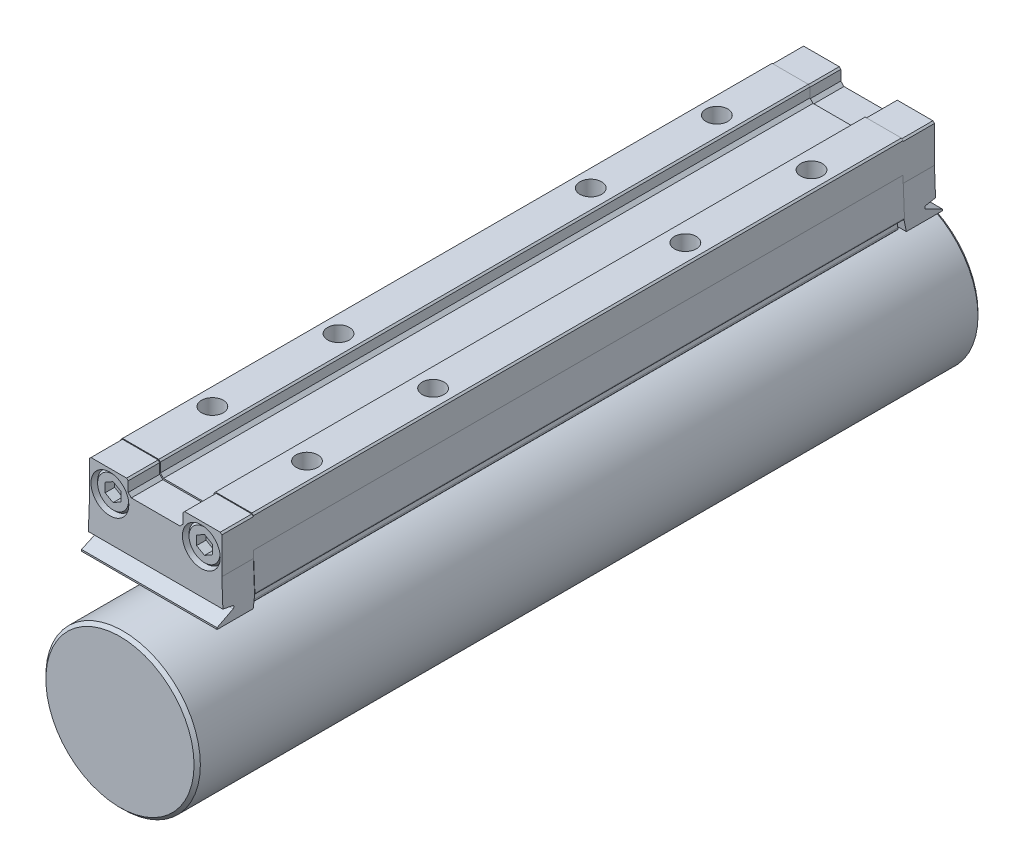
ISO-10303-21;
HEADER;
FILE_DESCRIPTION(('STEP AP214'),'2;1');
FILE_NAME('part.step','',(''),(''),'','','');
FILE_SCHEMA(('AUTOMOTIVE_DESIGN { 1 0 10303 214 1 1 1 1 }'));
ENDSEC;
DATA;
#1=APPLICATION_CONTEXT('core data for automotive mechanical design processes');
#2=APPLICATION_PROTOCOL_DEFINITION('international standard','automotive_design',2000,#1);
#3=PRODUCT_CONTEXT('',#1,'mechanical');
#4=PRODUCT('Part','Part','',(#3));
#5=PRODUCT_RELATED_PRODUCT_CATEGORY('part','',(#4));
#6=PRODUCT_DEFINITION_FORMATION('','',#4);
#7=PRODUCT_DEFINITION_CONTEXT('part definition',#1,'design');
#8=PRODUCT_DEFINITION('design','',#6,#7);
#9=PRODUCT_DEFINITION_SHAPE('','',#8);
#10=(LENGTH_UNIT() NAMED_UNIT(*) SI_UNIT(.MILLI.,.METRE.));
#11=(NAMED_UNIT(*) PLANE_ANGLE_UNIT() SI_UNIT($,.RADIAN.));
#12=(NAMED_UNIT(*) SI_UNIT($,.STERADIAN.) SOLID_ANGLE_UNIT());
#13=UNCERTAINTY_MEASURE_WITH_UNIT(LENGTH_MEASURE(1.E-05),#10,'distance_accuracy_value','');
#14=(GEOMETRIC_REPRESENTATION_CONTEXT(3) GLOBAL_UNCERTAINTY_ASSIGNED_CONTEXT((#13)) GLOBAL_UNIT_ASSIGNED_CONTEXT((#10,
#11,#12)) REPRESENTATION_CONTEXT('',''));
#15=CARTESIAN_POINT('',(0.,0.,0.));
#16=DIRECTION('',(0.,0.,1.));
#17=DIRECTION('',(1.,0.,0.));
#18=AXIS2_PLACEMENT_3D('',#15,#16,#17);
#19=CARTESIAN_POINT('',(7.25,24.87,53.));
#20=DIRECTION('',(0.,0.,-1.));
#21=DIRECTION('',(0.,1.,0.));
#22=AXIS2_PLACEMENT_3D('',#19,#20,#21);
#23=CYLINDRICAL_SURFACE('',#22,2.75);
#24=CARTESIAN_POINT('',(7.25,24.87,55.7));
#25=DIRECTION('',(0.,0.,-1.));
#26=DIRECTION('',(0.,1.,0.));
#27=AXIS2_PLACEMENT_3D('',#24,#25,#26);
#28=CIRCLE('',#27,2.75);
#29=CARTESIAN_POINT('',(7.25,27.62,55.7));
#30=VERTEX_POINT('',#29);
#31=EDGE_CURVE('E1102',#30,#30,#28,.T.);
#32=ORIENTED_EDGE('',*,*,#31,.T.);
#33=EDGE_LOOP('',(#32));
#34=FACE_BOUND('',#33,.T.);
#35=CARTESIAN_POINT('',(7.25,24.87,53.));
#36=DIRECTION('',(0.,0.,-1.));
#37=DIRECTION('',(-1.,0.,0.));
#38=AXIS2_PLACEMENT_3D('',#35,#36,#37);
#39=CIRCLE('',#38,2.75);
#40=CARTESIAN_POINT('',(4.5,24.87,53.));
#41=VERTEX_POINT('',#40);
#42=EDGE_CURVE('E1617',#41,#41,#39,.T.);
#43=ORIENTED_EDGE('',*,*,#42,.F.);
#44=EDGE_LOOP('',(#43));
#45=FACE_BOUND('',#44,.T.);
#46=ADVANCED_FACE('F15',(#34,#45),#23,.T.);
#47=CARTESIAN_POINT('',(7.25,24.87,55.7));
#48=DIRECTION('',(0.,0.,-1.));
#49=DIRECTION('',(0.,1.,0.));
#50=AXIS2_PLACEMENT_3D('',#47,#48,#49);
#51=CONICAL_SURFACE('',#50,2.75,0.78539816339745);
#52=CARTESIAN_POINT('',(7.25,24.87,56.));
#53=DIRECTION('',(0.,0.,-1.));
#54=DIRECTION('',(0.,1.,0.));
#55=AXIS2_PLACEMENT_3D('',#52,#53,#54);
#56=CIRCLE('',#55,2.45);
#57=CARTESIAN_POINT('',(7.25,27.32,56.));
#58=VERTEX_POINT('',#57);
#59=EDGE_CURVE('E1089',#58,#58,#56,.T.);
#60=ORIENTED_EDGE('',*,*,#59,.T.);
#61=EDGE_LOOP('',(#60));
#62=FACE_BOUND('',#61,.T.);
#63=ORIENTED_EDGE('',*,*,#31,.F.);
#64=EDGE_LOOP('',(#63));
#65=FACE_BOUND('',#64,.T.);
#66=ADVANCED_FACE('F2210',(#62,#65),#51,.T.);
#67=CARTESIAN_POINT('',(9.7,24.87,56.));
#68=DIRECTION('',(0.,0.,1.));
#69=DIRECTION('',(0.,-1.,0.));
#70=AXIS2_PLACEMENT_3D('',#67,#68,#69);
#71=PLANE('',#70);
#72=DIRECTION('',(0.,-1.,0.));
#73=VECTOR('',#72,1.);
#74=CARTESIAN_POINT('',(6.,25.5916878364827,56.));
#75=LINE('',#74,#73);
#76=CARTESIAN_POINT('',(6.,25.5916878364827,56.));
#77=VERTEX_POINT('',#76);
#78=CARTESIAN_POINT('',(6.,24.1483121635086,56.));
#79=VERTEX_POINT('',#78);
#80=EDGE_CURVE('E1051',#77,#79,#75,.T.);
#81=ORIENTED_EDGE('',*,*,#80,.F.);
#82=DIRECTION('',(-0.866025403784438,-0.5,0.));
#83=VECTOR('',#82,1.);
#84=CARTESIAN_POINT('',(7.25,26.3133756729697,56.));
#85=LINE('',#84,#83);
#86=CARTESIAN_POINT('',(7.25,26.3133756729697,56.));
#87=VERTEX_POINT('',#86);
#88=EDGE_CURVE('E1065',#87,#77,#85,.T.);
#89=ORIENTED_EDGE('',*,*,#88,.F.);
#90=DIRECTION('',(-0.866025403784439,0.5,0.));
#91=VECTOR('',#90,1.);
#92=CARTESIAN_POINT('',(8.5,25.5916878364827,56.));
#93=LINE('',#92,#91);
#94=CARTESIAN_POINT('',(8.5,25.5916878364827,56.));
#95=VERTEX_POINT('',#94);
#96=EDGE_CURVE('E1062',#95,#87,#93,.T.);
#97=ORIENTED_EDGE('',*,*,#96,.F.);
#98=DIRECTION('',(0.,1.,0.));
#99=VECTOR('',#98,1.);
#100=CARTESIAN_POINT('',(8.5,24.1483121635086,56.));
#101=LINE('',#100,#99);
#102=CARTESIAN_POINT('',(8.5,24.1483121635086,56.));
#103=VERTEX_POINT('',#102);
#104=EDGE_CURVE('E1059',#103,#95,#101,.T.);
#105=ORIENTED_EDGE('',*,*,#104,.F.);
#106=DIRECTION('',(0.866025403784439,0.5,0.));
#107=VECTOR('',#106,1.);
#108=CARTESIAN_POINT('',(7.25,23.4266243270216,56.));
#109=LINE('',#108,#107);
#110=CARTESIAN_POINT('',(7.25,23.4266243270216,56.));
#111=VERTEX_POINT('',#110);
#112=EDGE_CURVE('E1056',#111,#103,#109,.T.);
#113=ORIENTED_EDGE('',*,*,#112,.F.);
#114=DIRECTION('',(0.866025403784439,-0.5,0.));
#115=VECTOR('',#114,1.);
#116=CARTESIAN_POINT('',(6.,24.1483121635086,56.));
#117=LINE('',#116,#115);
#118=EDGE_CURVE('E1053',#79,#111,#117,.T.);
#119=ORIENTED_EDGE('',*,*,#118,.F.);
#120=EDGE_LOOP('',(#81,#89,#97,#105,#113,#119));
#121=FACE_BOUND('',#120,.T.);
#122=ORIENTED_EDGE('',*,*,#59,.F.);
#123=EDGE_LOOP('',(#122));
#124=FACE_BOUND('',#123,.T.);
#125=ADVANCED_FACE('F2198',(#121,#124),#71,.T.);
#126=CARTESIAN_POINT('',(6.,25.5916878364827,54.5));
#127=DIRECTION('',(-1.,0.,0.));
#128=DIRECTION('',(0.,-1.,0.));
#129=AXIS2_PLACEMENT_3D('',#126,#127,#128);
#130=PLANE('',#129);
#131=ORIENTED_EDGE('',*,*,#80,.T.);
#132=DIRECTION('',(0.,0.,1.));
#133=VECTOR('',#132,1.);
#134=CARTESIAN_POINT('',(6.,24.1483121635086,54.5));
#135=LINE('',#134,#133);
#136=CARTESIAN_POINT('',(6.,24.1483121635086,54.5));
#137=VERTEX_POINT('',#136);
#138=EDGE_CURVE('E1086',#137,#79,#135,.T.);
#139=ORIENTED_EDGE('',*,*,#138,.F.);
#140=DIRECTION('',(0.,-1.,0.));
#141=VECTOR('',#140,1.);
#142=CARTESIAN_POINT('',(6.,25.5916878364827,54.5));
#143=LINE('',#142,#141);
#144=CARTESIAN_POINT('',(6.,25.5916878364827,54.5));
#145=VERTEX_POINT('',#144);
#146=EDGE_CURVE('E1068',#145,#137,#143,.T.);
#147=ORIENTED_EDGE('',*,*,#146,.F.);
#148=DIRECTION('',(0.,0.,1.));
#149=VECTOR('',#148,1.);
#150=CARTESIAN_POINT('',(6.,25.5916878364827,54.5));
#151=LINE('',#150,#149);
#152=EDGE_CURVE('E1087',#145,#77,#151,.T.);
#153=ORIENTED_EDGE('',*,*,#152,.T.);
#154=EDGE_LOOP('',(#131,#139,#147,#153));
#155=FACE_BOUND('',#154,.T.);
#156=ADVANCED_FACE('F2180',(#155),#130,.F.);
#157=CARTESIAN_POINT('',(7.25,26.3133756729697,54.5));
#158=DIRECTION('',(-0.5,0.866025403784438,0.));
#159=DIRECTION('',(-0.866025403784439,-0.5,0.));
#160=AXIS2_PLACEMENT_3D('',#157,#158,#159);
#161=PLANE('',#160);
#162=ORIENTED_EDGE('',*,*,#88,.T.);
#163=ORIENTED_EDGE('',*,*,#152,.F.);
#164=DIRECTION('',(-0.866025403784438,-0.5,0.));
#165=VECTOR('',#164,1.);
#166=CARTESIAN_POINT('',(7.25,26.3133756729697,54.5));
#167=LINE('',#166,#165);
#168=CARTESIAN_POINT('',(7.25,26.3133756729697,54.5));
#169=VERTEX_POINT('',#168);
#170=EDGE_CURVE('E1083',#169,#145,#167,.T.);
#171=ORIENTED_EDGE('',*,*,#170,.F.);
#172=DIRECTION('',(0.,0.,1.));
#173=VECTOR('',#172,1.);
#174=CARTESIAN_POINT('',(7.25,26.3133756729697,54.5));
#175=LINE('',#174,#173);
#176=EDGE_CURVE('E1090',#169,#87,#175,.T.);
#177=ORIENTED_EDGE('',*,*,#176,.T.);
#178=EDGE_LOOP('',(#162,#163,#171,#177));
#179=FACE_BOUND('',#178,.T.);
#180=ADVANCED_FACE('F2176',(#179),#161,.F.);
#181=CARTESIAN_POINT('',(8.5,25.5916878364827,54.5));
#182=DIRECTION('',(0.5,0.866025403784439,0.));
#183=DIRECTION('',(-0.866025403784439,0.5,0.));
#184=AXIS2_PLACEMENT_3D('',#181,#182,#183);
#185=PLANE('',#184);
#186=ORIENTED_EDGE('',*,*,#96,.T.);
#187=ORIENTED_EDGE('',*,*,#176,.F.);
#188=DIRECTION('',(-0.866025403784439,0.5,0.));
#189=VECTOR('',#188,1.);
#190=CARTESIAN_POINT('',(8.5,25.5916878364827,54.5));
#191=LINE('',#190,#189);
#192=CARTESIAN_POINT('',(8.5,25.5916878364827,54.5));
#193=VERTEX_POINT('',#192);
#194=EDGE_CURVE('E1080',#193,#169,#191,.T.);
#195=ORIENTED_EDGE('',*,*,#194,.F.);
#196=DIRECTION('',(0.,0.,1.));
#197=VECTOR('',#196,1.);
#198=CARTESIAN_POINT('',(8.5,25.5916878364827,54.5));
#199=LINE('',#198,#197);
#200=EDGE_CURVE('E1092',#193,#95,#199,.T.);
#201=ORIENTED_EDGE('',*,*,#200,.T.);
#202=EDGE_LOOP('',(#186,#187,#195,#201));
#203=FACE_BOUND('',#202,.T.);
#204=ADVANCED_FACE('F2179',(#203),#185,.F.);
#205=CARTESIAN_POINT('',(8.5,24.1483121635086,54.5));
#206=DIRECTION('',(1.,0.,0.));
#207=DIRECTION('',(0.,1.,0.));
#208=AXIS2_PLACEMENT_3D('',#205,#206,#207);
#209=PLANE('',#208);
#210=ORIENTED_EDGE('',*,*,#104,.T.);
#211=ORIENTED_EDGE('',*,*,#200,.F.);
#212=DIRECTION('',(0.,1.,0.));
#213=VECTOR('',#212,1.);
#214=CARTESIAN_POINT('',(8.5,24.1483121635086,54.5));
#215=LINE('',#214,#213);
#216=CARTESIAN_POINT('',(8.5,24.1483121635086,54.5));
#217=VERTEX_POINT('',#216);
#218=EDGE_CURVE('E1077',#217,#193,#215,.T.);
#219=ORIENTED_EDGE('',*,*,#218,.F.);
#220=DIRECTION('',(0.,0.,1.));
#221=VECTOR('',#220,1.);
#222=CARTESIAN_POINT('',(8.5,24.1483121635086,54.5));
#223=LINE('',#222,#221);
#224=EDGE_CURVE('E1094',#217,#103,#223,.T.);
#225=ORIENTED_EDGE('',*,*,#224,.T.);
#226=EDGE_LOOP('',(#210,#211,#219,#225));
#227=FACE_BOUND('',#226,.T.);
#228=ADVANCED_FACE('F2184',(#227),#209,.F.);
#229=CARTESIAN_POINT('',(7.25,23.4266243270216,54.5));
#230=DIRECTION('',(0.5,-0.866025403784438,0.));
#231=DIRECTION('',(0.866025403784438,0.5,0.));
#232=AXIS2_PLACEMENT_3D('',#229,#230,#231);
#233=PLANE('',#232);
#234=ORIENTED_EDGE('',*,*,#112,.T.);
#235=ORIENTED_EDGE('',*,*,#224,.F.);
#236=DIRECTION('',(0.866025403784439,0.5,0.));
#237=VECTOR('',#236,1.);
#238=CARTESIAN_POINT('',(7.25,23.4266243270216,54.5));
#239=LINE('',#238,#237);
#240=CARTESIAN_POINT('',(7.25,23.4266243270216,54.5));
#241=VERTEX_POINT('',#240);
#242=EDGE_CURVE('E1074',#241,#217,#239,.T.);
#243=ORIENTED_EDGE('',*,*,#242,.F.);
#244=DIRECTION('',(0.,0.,1.));
#245=VECTOR('',#244,1.);
#246=CARTESIAN_POINT('',(7.25,23.4266243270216,54.5));
#247=LINE('',#246,#245);
#248=EDGE_CURVE('E1096',#241,#111,#247,.T.);
#249=ORIENTED_EDGE('',*,*,#248,.T.);
#250=EDGE_LOOP('',(#234,#235,#243,#249));
#251=FACE_BOUND('',#250,.T.);
#252=ADVANCED_FACE('F2188',(#251),#233,.F.);
#253=CARTESIAN_POINT('',(6.,24.1483121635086,54.5));
#254=DIRECTION('',(-0.5,-0.866025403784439,0.));
#255=DIRECTION('',(0.866025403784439,-0.5,0.));
#256=AXIS2_PLACEMENT_3D('',#253,#254,#255);
#257=PLANE('',#256);
#258=ORIENTED_EDGE('',*,*,#118,.T.);
#259=ORIENTED_EDGE('',*,*,#248,.F.);
#260=DIRECTION('',(0.866025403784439,-0.5,0.));
#261=VECTOR('',#260,1.);
#262=CARTESIAN_POINT('',(6.,24.1483121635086,54.5));
#263=LINE('',#262,#261);
#264=EDGE_CURVE('E1071',#137,#241,#263,.T.);
#265=ORIENTED_EDGE('',*,*,#264,.F.);
#266=ORIENTED_EDGE('',*,*,#138,.T.);
#267=EDGE_LOOP('',(#258,#259,#265,#266));
#268=FACE_BOUND('',#267,.T.);
#269=ADVANCED_FACE('F2174',(#268),#257,.F.);
#270=CARTESIAN_POINT('',(6.,25.5916878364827,54.5));
#271=DIRECTION('',(0.,0.,-1.));
#272=DIRECTION('',(0.,1.,0.));
#273=AXIS2_PLACEMENT_3D('',#270,#271,#272);
#274=PLANE('',#273);
#275=ORIENTED_EDGE('',*,*,#146,.T.);
#276=ORIENTED_EDGE('',*,*,#264,.T.);
#277=ORIENTED_EDGE('',*,*,#242,.T.);
#278=ORIENTED_EDGE('',*,*,#218,.T.);
#279=ORIENTED_EDGE('',*,*,#194,.T.);
#280=ORIENTED_EDGE('',*,*,#170,.T.);
#281=EDGE_LOOP('',(#275,#276,#277,#278,#279,#280));
#282=FACE_BOUND('',#281,.T.);
#283=ADVANCED_FACE('F2167',(#282),#274,.F.);
#284=CARTESIAN_POINT('',(-7.25,24.87,53.));
#285=DIRECTION('',(0.,0.,-1.));
#286=DIRECTION('',(0.,1.,0.));
#287=AXIS2_PLACEMENT_3D('',#284,#285,#286);
#288=CYLINDRICAL_SURFACE('',#287,2.75);
#289=CARTESIAN_POINT('',(-7.25,24.87,55.7));
#290=DIRECTION('',(0.,0.,-1.));
#291=DIRECTION('',(0.,1.,0.));
#292=AXIS2_PLACEMENT_3D('',#289,#290,#291);
#293=CIRCLE('',#292,2.75);
#294=CARTESIAN_POINT('',(-7.25,27.62,55.7));
#295=VERTEX_POINT('',#294);
#296=EDGE_CURVE('E1045',#295,#295,#293,.T.);
#297=ORIENTED_EDGE('',*,*,#296,.T.);
#298=EDGE_LOOP('',(#297));
#299=FACE_BOUND('',#298,.T.);
#300=CARTESIAN_POINT('',(-7.25,24.87,53.));
#301=DIRECTION('',(0.,0.,-1.));
#302=DIRECTION('',(-1.,0.,0.));
#303=AXIS2_PLACEMENT_3D('',#300,#301,#302);
#304=CIRCLE('',#303,2.75);
#305=CARTESIAN_POINT('',(-10.,24.87,53.));
#306=VERTEX_POINT('',#305);
#307=EDGE_CURVE('E1614',#306,#306,#304,.T.);
#308=ORIENTED_EDGE('',*,*,#307,.F.);
#309=EDGE_LOOP('',(#308));
#310=FACE_BOUND('',#309,.T.);
#311=ADVANCED_FACE('F2163',(#299,#310),#288,.T.);
#312=CARTESIAN_POINT('',(-7.25,24.87,55.7));
#313=DIRECTION('',(0.,0.,-1.));
#314=DIRECTION('',(0.,1.,0.));
#315=AXIS2_PLACEMENT_3D('',#312,#313,#314);
#316=CONICAL_SURFACE('',#315,2.75,0.78539816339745);
#317=CARTESIAN_POINT('',(-7.25,24.87,56.));
#318=DIRECTION('',(0.,0.,-1.));
#319=DIRECTION('',(0.,1.,0.));
#320=AXIS2_PLACEMENT_3D('',#317,#318,#319);
#321=CIRCLE('',#320,2.45);
#322=CARTESIAN_POINT('',(-7.25,27.32,56.));
#323=VERTEX_POINT('',#322);
#324=EDGE_CURVE('E1032',#323,#323,#321,.T.);
#325=ORIENTED_EDGE('',*,*,#324,.T.);
#326=EDGE_LOOP('',(#325));
#327=FACE_BOUND('',#326,.T.);
#328=ORIENTED_EDGE('',*,*,#296,.F.);
#329=EDGE_LOOP('',(#328));
#330=FACE_BOUND('',#329,.T.);
#331=ADVANCED_FACE('F2159',(#327,#330),#316,.T.);
#332=CARTESIAN_POINT('',(-4.8,24.87,56.));
#333=DIRECTION('',(0.,0.,1.));
#334=DIRECTION('',(0.,-1.,0.));
#335=AXIS2_PLACEMENT_3D('',#332,#333,#334);
#336=PLANE('',#335);
#337=DIRECTION('',(0.,-1.,0.));
#338=VECTOR('',#337,1.);
#339=CARTESIAN_POINT('',(-8.5,25.5916878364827,56.));
#340=LINE('',#339,#338);
#341=CARTESIAN_POINT('',(-8.5,25.5916878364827,56.));
#342=VERTEX_POINT('',#341);
#343=CARTESIAN_POINT('',(-8.5,24.1483121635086,56.));
#344=VERTEX_POINT('',#343);
#345=EDGE_CURVE('E994',#342,#344,#340,.T.);
#346=ORIENTED_EDGE('',*,*,#345,.F.);
#347=DIRECTION('',(-0.866025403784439,-0.5,0.));
#348=VECTOR('',#347,1.);
#349=CARTESIAN_POINT('',(-7.25,26.3133756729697,56.));
#350=LINE('',#349,#348);
#351=CARTESIAN_POINT('',(-7.25,26.3133756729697,56.));
#352=VERTEX_POINT('',#351);
#353=EDGE_CURVE('E1008',#352,#342,#350,.T.);
#354=ORIENTED_EDGE('',*,*,#353,.F.);
#355=DIRECTION('',(-0.866025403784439,0.5,0.));
#356=VECTOR('',#355,1.);
#357=CARTESIAN_POINT('',(-6.,25.5916878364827,56.));
#358=LINE('',#357,#356);
#359=CARTESIAN_POINT('',(-6.,25.5916878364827,56.));
#360=VERTEX_POINT('',#359);
#361=EDGE_CURVE('E1005',#360,#352,#358,.T.);
#362=ORIENTED_EDGE('',*,*,#361,.F.);
#363=DIRECTION('',(0.,1.,0.));
#364=VECTOR('',#363,1.);
#365=CARTESIAN_POINT('',(-6.,24.1483121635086,56.));
#366=LINE('',#365,#364);
#367=CARTESIAN_POINT('',(-6.,24.1483121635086,56.));
#368=VERTEX_POINT('',#367);
#369=EDGE_CURVE('E1002',#368,#360,#366,.T.);
#370=ORIENTED_EDGE('',*,*,#369,.F.);
#371=DIRECTION('',(0.866025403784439,0.5,0.));
#372=VECTOR('',#371,1.);
#373=CARTESIAN_POINT('',(-7.25,23.4266243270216,56.));
#374=LINE('',#373,#372);
#375=CARTESIAN_POINT('',(-7.25,23.4266243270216,56.));
#376=VERTEX_POINT('',#375);
#377=EDGE_CURVE('E999',#376,#368,#374,.T.);
#378=ORIENTED_EDGE('',*,*,#377,.F.);
#379=DIRECTION('',(0.866025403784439,-0.5,0.));
#380=VECTOR('',#379,1.);
#381=CARTESIAN_POINT('',(-8.5,24.1483121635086,56.));
#382=LINE('',#381,#380);
#383=EDGE_CURVE('E996',#344,#376,#382,.T.);
#384=ORIENTED_EDGE('',*,*,#383,.F.);
#385=EDGE_LOOP('',(#346,#354,#362,#370,#378,#384));
#386=FACE_BOUND('',#385,.T.);
#387=ORIENTED_EDGE('',*,*,#324,.F.);
#388=EDGE_LOOP('',(#387));
#389=FACE_BOUND('',#388,.T.);
#390=ADVANCED_FACE('F2147',(#386,#389),#336,.T.);
#391=CARTESIAN_POINT('',(-8.5,25.5916878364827,54.5));
#392=DIRECTION('',(-1.,0.,0.));
#393=DIRECTION('',(0.,-1.,0.));
#394=AXIS2_PLACEMENT_3D('',#391,#392,#393);
#395=PLANE('',#394);
#396=ORIENTED_EDGE('',*,*,#345,.T.);
#397=DIRECTION('',(0.,0.,1.));
#398=VECTOR('',#397,1.);
#399=CARTESIAN_POINT('',(-8.5,24.1483121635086,54.5));
#400=LINE('',#399,#398);
#401=CARTESIAN_POINT('',(-8.5,24.1483121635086,54.5));
#402=VERTEX_POINT('',#401);
#403=EDGE_CURVE('E1029',#402,#344,#400,.T.);
#404=ORIENTED_EDGE('',*,*,#403,.F.);
#405=DIRECTION('',(0.,-1.,0.));
#406=VECTOR('',#405,1.);
#407=CARTESIAN_POINT('',(-8.5,25.5916878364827,54.5));
#408=LINE('',#407,#406);
#409=CARTESIAN_POINT('',(-8.5,25.5916878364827,54.5));
#410=VERTEX_POINT('',#409);
#411=EDGE_CURVE('E1011',#410,#402,#408,.T.);
#412=ORIENTED_EDGE('',*,*,#411,.F.);
#413=DIRECTION('',(0.,0.,1.));
#414=VECTOR('',#413,1.);
#415=CARTESIAN_POINT('',(-8.5,25.5916878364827,54.5));
#416=LINE('',#415,#414);
#417=EDGE_CURVE('E1030',#410,#342,#416,.T.);
#418=ORIENTED_EDGE('',*,*,#417,.T.);
#419=EDGE_LOOP('',(#396,#404,#412,#418));
#420=FACE_BOUND('',#419,.T.);
#421=ADVANCED_FACE('F2129',(#420),#395,.F.);
#422=CARTESIAN_POINT('',(-7.25,26.3133756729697,54.5));
#423=DIRECTION('',(-0.5,0.866025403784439,0.));
#424=DIRECTION('',(-0.866025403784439,-0.5,0.));
#425=AXIS2_PLACEMENT_3D('',#422,#423,#424);
#426=PLANE('',#425);
#427=ORIENTED_EDGE('',*,*,#353,.T.);
#428=ORIENTED_EDGE('',*,*,#417,.F.);
#429=DIRECTION('',(-0.866025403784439,-0.5,0.));
#430=VECTOR('',#429,1.);
#431=CARTESIAN_POINT('',(-7.25,26.3133756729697,54.5));
#432=LINE('',#431,#430);
#433=CARTESIAN_POINT('',(-7.25,26.3133756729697,54.5));
#434=VERTEX_POINT('',#433);
#435=EDGE_CURVE('E1026',#434,#410,#432,.T.);
#436=ORIENTED_EDGE('',*,*,#435,.F.);
#437=DIRECTION('',(0.,0.,1.));
#438=VECTOR('',#437,1.);
#439=CARTESIAN_POINT('',(-7.25,26.3133756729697,54.5));
#440=LINE('',#439,#438);
#441=EDGE_CURVE('E1033',#434,#352,#440,.T.);
#442=ORIENTED_EDGE('',*,*,#441,.T.);
#443=EDGE_LOOP('',(#427,#428,#436,#442));
#444=FACE_BOUND('',#443,.T.);
#445=ADVANCED_FACE('F2125',(#444),#426,.F.);
#446=CARTESIAN_POINT('',(-6.,25.5916878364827,54.5));
#447=DIRECTION('',(0.5,0.866025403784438,0.));
#448=DIRECTION('',(-0.866025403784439,0.5,0.));
#449=AXIS2_PLACEMENT_3D('',#446,#447,#448);
#450=PLANE('',#449);
#451=ORIENTED_EDGE('',*,*,#361,.T.);
#452=ORIENTED_EDGE('',*,*,#441,.F.);
#453=DIRECTION('',(-0.866025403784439,0.5,0.));
#454=VECTOR('',#453,1.);
#455=CARTESIAN_POINT('',(-6.,25.5916878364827,54.5));
#456=LINE('',#455,#454);
#457=CARTESIAN_POINT('',(-6.,25.5916878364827,54.5));
#458=VERTEX_POINT('',#457);
#459=EDGE_CURVE('E1023',#458,#434,#456,.T.);
#460=ORIENTED_EDGE('',*,*,#459,.F.);
#461=DIRECTION('',(0.,0.,1.));
#462=VECTOR('',#461,1.);
#463=CARTESIAN_POINT('',(-6.,25.5916878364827,54.5));
#464=LINE('',#463,#462);
#465=EDGE_CURVE('E1035',#458,#360,#464,.T.);
#466=ORIENTED_EDGE('',*,*,#465,.T.);
#467=EDGE_LOOP('',(#451,#452,#460,#466));
#468=FACE_BOUND('',#467,.T.);
#469=ADVANCED_FACE('F2128',(#468),#450,.F.);
#470=CARTESIAN_POINT('',(-6.,24.1483121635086,54.5));
#471=DIRECTION('',(1.,0.,0.));
#472=DIRECTION('',(0.,1.,0.));
#473=AXIS2_PLACEMENT_3D('',#470,#471,#472);
#474=PLANE('',#473);
#475=ORIENTED_EDGE('',*,*,#369,.T.);
#476=ORIENTED_EDGE('',*,*,#465,.F.);
#477=DIRECTION('',(0.,1.,0.));
#478=VECTOR('',#477,1.);
#479=CARTESIAN_POINT('',(-6.,24.1483121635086,54.5));
#480=LINE('',#479,#478);
#481=CARTESIAN_POINT('',(-6.,24.1483121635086,54.5));
#482=VERTEX_POINT('',#481);
#483=EDGE_CURVE('E1020',#482,#458,#480,.T.);
#484=ORIENTED_EDGE('',*,*,#483,.F.);
#485=DIRECTION('',(0.,0.,1.));
#486=VECTOR('',#485,1.);
#487=CARTESIAN_POINT('',(-6.,24.1483121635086,54.5));
#488=LINE('',#487,#486);
#489=EDGE_CURVE('E1037',#482,#368,#488,.T.);
#490=ORIENTED_EDGE('',*,*,#489,.T.);
#491=EDGE_LOOP('',(#475,#476,#484,#490));
#492=FACE_BOUND('',#491,.T.);
#493=ADVANCED_FACE('F2133',(#492),#474,.F.);
#494=CARTESIAN_POINT('',(-7.25,23.4266243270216,54.5));
#495=DIRECTION('',(0.5,-0.866025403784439,0.));
#496=DIRECTION('',(0.866025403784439,0.5,0.));
#497=AXIS2_PLACEMENT_3D('',#494,#495,#496);
#498=PLANE('',#497);
#499=ORIENTED_EDGE('',*,*,#377,.T.);
#500=ORIENTED_EDGE('',*,*,#489,.F.);
#501=DIRECTION('',(0.866025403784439,0.5,0.));
#502=VECTOR('',#501,1.);
#503=CARTESIAN_POINT('',(-7.25,23.4266243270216,54.5));
#504=LINE('',#503,#502);
#505=CARTESIAN_POINT('',(-7.25,23.4266243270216,54.5));
#506=VERTEX_POINT('',#505);
#507=EDGE_CURVE('E1017',#506,#482,#504,.T.);
#508=ORIENTED_EDGE('',*,*,#507,.F.);
#509=DIRECTION('',(0.,0.,1.));
#510=VECTOR('',#509,1.);
#511=CARTESIAN_POINT('',(-7.25,23.4266243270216,54.5));
#512=LINE('',#511,#510);
#513=EDGE_CURVE('E1039',#506,#376,#512,.T.);
#514=ORIENTED_EDGE('',*,*,#513,.T.);
#515=EDGE_LOOP('',(#499,#500,#508,#514));
#516=FACE_BOUND('',#515,.T.);
#517=ADVANCED_FACE('F2137',(#516),#498,.F.);
#518=CARTESIAN_POINT('',(-8.5,24.1483121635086,54.5));
#519=DIRECTION('',(-0.5,-0.866025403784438,0.));
#520=DIRECTION('',(0.866025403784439,-0.5,0.));
#521=AXIS2_PLACEMENT_3D('',#518,#519,#520);
#522=PLANE('',#521);
#523=ORIENTED_EDGE('',*,*,#383,.T.);
#524=ORIENTED_EDGE('',*,*,#513,.F.);
#525=DIRECTION('',(0.866025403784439,-0.5,0.));
#526=VECTOR('',#525,1.);
#527=CARTESIAN_POINT('',(-8.5,24.1483121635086,54.5));
#528=LINE('',#527,#526);
#529=EDGE_CURVE('E1014',#402,#506,#528,.T.);
#530=ORIENTED_EDGE('',*,*,#529,.F.);
#531=ORIENTED_EDGE('',*,*,#403,.T.);
#532=EDGE_LOOP('',(#523,#524,#530,#531));
#533=FACE_BOUND('',#532,.T.);
#534=ADVANCED_FACE('F2123',(#533),#522,.F.);
#535=CARTESIAN_POINT('',(-8.5,25.5916878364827,54.5));
#536=DIRECTION('',(0.,0.,-1.));
#537=DIRECTION('',(0.,1.,0.));
#538=AXIS2_PLACEMENT_3D('',#535,#536,#537);
#539=PLANE('',#538);
#540=ORIENTED_EDGE('',*,*,#411,.T.);
#541=ORIENTED_EDGE('',*,*,#529,.T.);
#542=ORIENTED_EDGE('',*,*,#507,.T.);
#543=ORIENTED_EDGE('',*,*,#483,.T.);
#544=ORIENTED_EDGE('',*,*,#459,.T.);
#545=ORIENTED_EDGE('',*,*,#435,.T.);
#546=EDGE_LOOP('',(#540,#541,#542,#543,#544,#545));
#547=FACE_BOUND('',#546,.T.);
#548=ADVANCED_FACE('F2120',(#547),#539,.F.);
#549=CARTESIAN_POINT('',(0.,0.,51.5));
#550=DIRECTION('',(0.,0.,1.));
#551=DIRECTION('',(1.,0.,0.));
#552=AXIS2_PLACEMENT_3D('',#549,#550,#551);
#553=PLANE('',#552);
#554=DIRECTION('',(0.983409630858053,0.181398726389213,0.));
#555=VECTOR('',#554,1.);
#556=CARTESIAN_POINT('',(10.754,17.508,51.5));
#557=LINE('',#556,#555);
#558=CARTESIAN_POINT('',(9.44925961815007,17.2673289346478,51.5));
#559=VERTEX_POINT('',#558);
#560=CARTESIAN_POINT('',(10.0058661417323,17.37,51.5));
#561=VERTEX_POINT('',#560);
#562=EDGE_CURVE('E1284',#559,#561,#557,.T.);
#563=ORIENTED_EDGE('',*,*,#562,.T.);
#564=DIRECTION('',(-1.,0.,0.));
#565=VECTOR('',#564,1.);
#566=CARTESIAN_POINT('',(11.,17.37,51.5));
#567=LINE('',#566,#565);
#568=CARTESIAN_POINT('',(5.25,17.37,51.5));
#569=VERTEX_POINT('',#568);
#570=EDGE_CURVE('E1476',#561,#569,#567,.T.);
#571=ORIENTED_EDGE('',*,*,#570,.T.);
#572=DIRECTION('',(0.,-1.,0.));
#573=VECTOR('',#572,1.);
#574=CARTESIAN_POINT('',(5.25,24.5,51.5));
#575=LINE('',#574,#573);
#576=CARTESIAN_POINT('',(5.25,16.6931206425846,51.5));
#577=VERTEX_POINT('',#576);
#578=EDGE_CURVE('E1408',#569,#577,#575,.T.);
#579=ORIENTED_EDGE('',*,*,#578,.T.);
#580=DIRECTION('',(1.,0.,0.));
#581=VECTOR('',#580,1.);
#582=CARTESIAN_POINT('',(-26.2520975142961,16.6931206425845,51.5));
#583=LINE('',#582,#581);
#584=CARTESIAN_POINT('',(-5.25,16.6931206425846,51.5));
#585=VERTEX_POINT('',#584);
#586=EDGE_CURVE('E1414',#585,#577,#583,.T.);
#587=ORIENTED_EDGE('',*,*,#586,.F.);
#588=DIRECTION('',(0.,1.,0.));
#589=VECTOR('',#588,1.);
#590=CARTESIAN_POINT('',(-5.25,24.5,51.5));
#591=LINE('',#590,#589);
#592=CARTESIAN_POINT('',(-5.25,17.37,51.5));
#593=VERTEX_POINT('',#592);
#594=EDGE_CURVE('E1411',#585,#593,#591,.T.);
#595=ORIENTED_EDGE('',*,*,#594,.T.);
#596=DIRECTION('',(1.,0.,0.));
#597=VECTOR('',#596,1.);
#598=CARTESIAN_POINT('',(-11.,17.37,51.5));
#599=LINE('',#598,#597);
#600=CARTESIAN_POINT('',(-10.0058661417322,17.37,51.5));
#601=VERTEX_POINT('',#600);
#602=EDGE_CURVE('E1472',#601,#593,#599,.T.);
#603=ORIENTED_EDGE('',*,*,#602,.F.);
#604=DIRECTION('',(0.983409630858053,-0.181398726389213,0.));
#605=VECTOR('',#604,1.);
#606=CARTESIAN_POINT('',(-10.754,17.508,51.5));
#607=LINE('',#606,#605);
#608=CARTESIAN_POINT('',(-9.44925961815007,17.2673289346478,51.5));
#609=VERTEX_POINT('',#608);
#610=EDGE_CURVE('E1282',#601,#609,#607,.T.);
#611=ORIENTED_EDGE('',*,*,#610,.T.);
#612=DIRECTION('',(-0.181398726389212,-0.983409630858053,0.));
#613=VECTOR('',#612,1.);
#614=CARTESIAN_POINT('',(-9.70033436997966,15.9061874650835,51.5));
#615=LINE('',#614,#613);
#616=CARTESIAN_POINT('',(-9.70033436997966,15.9061874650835,51.5));
#617=VERTEX_POINT('',#616);
#618=EDGE_CURVE('E1174',#609,#617,#615,.T.);
#619=ORIENTED_EDGE('',*,*,#618,.T.);
#620=CARTESIAN_POINT('',(-9.28730232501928,15.83,51.5));
#621=DIRECTION('',(0.,0.,1.));
#622=DIRECTION('',(1.,0.,0.));
#623=AXIS2_PLACEMENT_3D('',#620,#621,#622);
#624=CIRCLE('',#623,0.42);
#625=CARTESIAN_POINT('',(-9.28730232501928,15.41,51.5));
#626=VERTEX_POINT('',#625);
#627=EDGE_CURVE('E1176',#617,#626,#624,.T.);
#628=ORIENTED_EDGE('',*,*,#627,.T.);
#629=DIRECTION('',(1.,0.,0.));
#630=VECTOR('',#629,1.);
#631=CARTESIAN_POINT('',(-9.28730232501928,15.41,51.5));
#632=LINE('',#631,#630);
#633=CARTESIAN_POINT('',(-3.,15.41,51.5));
#634=VERTEX_POINT('',#633);
#635=EDGE_CURVE('E1178',#626,#634,#632,.T.);
#636=ORIENTED_EDGE('',*,*,#635,.T.);
#637=DIRECTION('',(0.,-1.,0.));
#638=VECTOR('',#637,1.);
#639=CARTESIAN_POINT('',(-3.,15.41,51.5));
#640=LINE('',#639,#638);
#641=CARTESIAN_POINT('',(-3.,11.8769735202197,51.5));
#642=VERTEX_POINT('',#641);
#643=EDGE_CURVE('E1180',#634,#642,#640,.T.);
#644=ORIENTED_EDGE('',*,*,#643,.T.);
#645=CARTESIAN_POINT('',(0.,0.,51.5));
#646=DIRECTION('',(0.,0.,1.));
#647=DIRECTION('',(1.,0.,0.));
#648=AXIS2_PLACEMENT_3D('',#645,#646,#647);
#649=CIRCLE('',#648,12.25);
#650=CARTESIAN_POINT('',(3.,11.8769735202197,51.5));
#651=VERTEX_POINT('',#650);
#652=EDGE_CURVE('E1368',#651,#642,#649,.T.);
#653=ORIENTED_EDGE('',*,*,#652,.F.);
#654=DIRECTION('',(0.,1.,0.));
#655=VECTOR('',#654,1.);
#656=CARTESIAN_POINT('',(3.,15.41,51.5));
#657=LINE('',#656,#655);
#658=CARTESIAN_POINT('',(3.,15.41,51.5));
#659=VERTEX_POINT('',#658);
#660=EDGE_CURVE('E1183',#651,#659,#657,.T.);
#661=ORIENTED_EDGE('',*,*,#660,.T.);
#662=DIRECTION('',(1.,0.,0.));
#663=VECTOR('',#662,1.);
#664=CARTESIAN_POINT('',(9.28730232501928,15.41,51.5));
#665=LINE('',#664,#663);
#666=CARTESIAN_POINT('',(9.28730232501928,15.41,51.5));
#667=VERTEX_POINT('',#666);
#668=EDGE_CURVE('E1185',#659,#667,#665,.T.);
#669=ORIENTED_EDGE('',*,*,#668,.T.);
#670=CARTESIAN_POINT('',(9.28730232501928,15.83,51.5));
#671=DIRECTION('',(0.,0.,1.));
#672=DIRECTION('',(-1.,0.,0.));
#673=AXIS2_PLACEMENT_3D('',#670,#671,#672);
#674=CIRCLE('',#673,0.42);
#675=CARTESIAN_POINT('',(9.70033436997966,15.9061874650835,51.5));
#676=VERTEX_POINT('',#675);
#677=EDGE_CURVE('E1187',#667,#676,#674,.T.);
#678=ORIENTED_EDGE('',*,*,#677,.T.);
#679=DIRECTION('',(-0.181398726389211,0.983409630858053,0.));
#680=VECTOR('',#679,1.);
#681=CARTESIAN_POINT('',(9.44925961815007,17.2673289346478,51.5));
#682=LINE('',#681,#680);
#683=EDGE_CURVE('E1189',#676,#559,#682,.T.);
#684=ORIENTED_EDGE('',*,*,#683,.T.);
#685=EDGE_LOOP('',(#563,#571,#579,#587,#595,#603,#611,#619,#628,#636,#644,#653,#661,#669,#678,#684));
#686=FACE_BOUND('',#685,.T.);
#687=ADVANCED_FACE('F1626',(#686),#553,.T.);
#688=CARTESIAN_POINT('',(10.754,17.508,-79.2280375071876));
#689=DIRECTION('',(0.181398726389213,-0.983409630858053,0.));
#690=DIRECTION('',(0.983409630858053,0.181398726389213,0.));
#691=AXIS2_PLACEMENT_3D('',#688,#689,#690);
#692=PLANE('',#691);
#693=ORIENTED_EDGE('',*,*,#562,.F.);
#694=DIRECTION('',(0.,0.,-1.));
#695=VECTOR('',#694,1.);
#696=CARTESIAN_POINT('',(9.44925961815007,17.2673289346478,51.5));
#697=LINE('',#696,#695);
#698=CARTESIAN_POINT('',(9.44925961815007,17.2673289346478,-51.5));
#699=VERTEX_POINT('',#698);
#700=EDGE_CURVE('E1192',#559,#699,#697,.T.);
#701=ORIENTED_EDGE('',*,*,#700,.T.);
#702=DIRECTION('',(-0.983409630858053,-0.181398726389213,0.));
#703=VECTOR('',#702,1.);
#704=CARTESIAN_POINT('',(10.754,17.508,-51.5));
#705=LINE('',#704,#703);
#706=CARTESIAN_POINT('',(10.005866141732,17.37,-51.5));
#707=VERTEX_POINT('',#706);
#708=EDGE_CURVE('E1264',#707,#699,#705,.T.);
#709=ORIENTED_EDGE('',*,*,#708,.F.);
#710=CARTESIAN_POINT('',(10.5403860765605,17.4685969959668,-51.5));
#711=VERTEX_POINT('',#710);
#712=EDGE_CURVE('E1260',#711,#707,#705,.T.);
#713=ORIENTED_EDGE('',*,*,#712,.F.);
#714=DIRECTION('',(0.,0.,1.));
#715=VECTOR('',#714,1.);
#716=CARTESIAN_POINT('',(10.5403860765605,17.4685969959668,-51.5));
#717=LINE('',#716,#715);
#718=CARTESIAN_POINT('',(10.5403860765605,17.4685969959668,51.5));
#719=VERTEX_POINT('',#718);
#720=EDGE_CURVE('E1225',#711,#719,#717,.T.);
#721=ORIENTED_EDGE('',*,*,#720,.T.);
#722=DIRECTION('',(0.983409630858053,0.181398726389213,0.));
#723=VECTOR('',#722,1.);
#724=CARTESIAN_POINT('',(10.8281439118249,17.521676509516,51.5));
#725=LINE('',#724,#723);
#726=EDGE_CURVE('E19',#561,#719,#725,.T.);
#727=ORIENTED_EDGE('',*,*,#726,.F.);
#728=EDGE_LOOP('',(#693,#701,#709,#713,#721,#727));
#729=FACE_BOUND('',#728,.T.);
#730=ADVANCED_FACE('F1736',(#729),#692,.T.);
#731=CARTESIAN_POINT('',(-10.754,17.508,-79.2280375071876));
#732=DIRECTION('',(-0.181398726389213,-0.983409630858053,0.));
#733=DIRECTION('',(0.983409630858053,-0.181398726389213,0.));
#734=AXIS2_PLACEMENT_3D('',#731,#732,#733);
#735=PLANE('',#734);
#736=DIRECTION('',(0.983409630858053,-0.181398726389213,0.));
#737=VECTOR('',#736,1.);
#738=CARTESIAN_POINT('',(10.4479351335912,13.5971129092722,51.5));
#739=LINE('',#738,#737);
#740=CARTESIAN_POINT('',(-10.5403860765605,17.4685969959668,51.5));
#741=VERTEX_POINT('',#740);
#742=EDGE_CURVE('E1232',#741,#601,#739,.T.);
#743=ORIENTED_EDGE('',*,*,#742,.F.);
#744=DIRECTION('',(0.,0.,1.));
#745=VECTOR('',#744,1.);
#746=CARTESIAN_POINT('',(-10.5403860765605,17.4685969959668,-51.5));
#747=LINE('',#746,#745);
#748=CARTESIAN_POINT('',(-10.5403860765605,17.4685969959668,-51.5));
#749=VERTEX_POINT('',#748);
#750=EDGE_CURVE('E1236',#749,#741,#747,.T.);
#751=ORIENTED_EDGE('',*,*,#750,.F.);
#752=DIRECTION('',(-0.983409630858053,0.181398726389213,0.));
#753=VECTOR('',#752,1.);
#754=CARTESIAN_POINT('',(-10.754,17.508,-51.5));
#755=LINE('',#754,#753);
#756=CARTESIAN_POINT('',(-10.0058661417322,17.37,-51.5));
#757=VERTEX_POINT('',#756);
#758=EDGE_CURVE('E1279',#757,#749,#755,.T.);
#759=ORIENTED_EDGE('',*,*,#758,.F.);
#760=CARTESIAN_POINT('',(-9.44925961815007,17.2673289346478,-51.5));
#761=VERTEX_POINT('',#760);
#762=EDGE_CURVE('E1305',#761,#757,#755,.T.);
#763=ORIENTED_EDGE('',*,*,#762,.F.);
#764=DIRECTION('',(0.,0.,-1.));
#765=VECTOR('',#764,1.);
#766=CARTESIAN_POINT('',(-9.44925961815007,17.2673289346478,51.5));
#767=LINE('',#766,#765);
#768=EDGE_CURVE('E1218',#609,#761,#767,.T.);
#769=ORIENTED_EDGE('',*,*,#768,.F.);
#770=ORIENTED_EDGE('',*,*,#610,.F.);
#771=EDGE_LOOP('',(#743,#751,#759,#763,#769,#770));
#772=FACE_BOUND('',#771,.T.);
#773=ADVANCED_FACE('F1631',(#772),#735,.T.);
#774=CARTESIAN_POINT('',(-9.70033436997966,15.9061874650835,51.5));
#775=DIRECTION('',(0.983409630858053,-0.181398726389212,0.));
#776=DIRECTION('',(0.181398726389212,0.983409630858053,0.));
#777=AXIS2_PLACEMENT_3D('',#774,#775,#776);
#778=PLANE('',#777);
#779=DIRECTION('',(-0.181398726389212,-0.983409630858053,0.));
#780=VECTOR('',#779,1.);
#781=CARTESIAN_POINT('',(-9.70033436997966,15.9061874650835,-51.5));
#782=LINE('',#781,#780);
#783=CARTESIAN_POINT('',(-9.70033436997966,15.9061874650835,-51.5));
#784=VERTEX_POINT('',#783);
#785=EDGE_CURVE('E1156',#761,#784,#782,.T.);
#786=ORIENTED_EDGE('',*,*,#785,.T.);
#787=DIRECTION('',(0.,0.,-1.));
#788=VECTOR('',#787,1.);
#789=CARTESIAN_POINT('',(-9.70033436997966,15.9061874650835,51.5));
#790=LINE('',#789,#788);
#791=EDGE_CURVE('E1215',#617,#784,#790,.T.);
#792=ORIENTED_EDGE('',*,*,#791,.F.);
#793=ORIENTED_EDGE('',*,*,#618,.F.);
#794=ORIENTED_EDGE('',*,*,#768,.T.);
#795=EDGE_LOOP('',(#786,#792,#793,#794));
#796=FACE_BOUND('',#795,.T.);
#797=ADVANCED_FACE('F1697',(#796),#778,.F.);
#798=CARTESIAN_POINT('',(-9.28730232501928,15.83,51.5));
#799=DIRECTION('',(0.,0.,-1.));
#800=DIRECTION('',(-1.,0.,0.));
#801=AXIS2_PLACEMENT_3D('',#798,#799,#800);
#802=CYLINDRICAL_SURFACE('',#801,0.42);
#803=CARTESIAN_POINT('',(-9.28730232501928,15.83,-51.5));
#804=DIRECTION('',(0.,0.,1.));
#805=DIRECTION('',(1.,0.,0.));
#806=AXIS2_PLACEMENT_3D('',#803,#804,#805);
#807=CIRCLE('',#806,0.42);
#808=CARTESIAN_POINT('',(-9.28730232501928,15.41,-51.5));
#809=VERTEX_POINT('',#808);
#810=EDGE_CURVE('E1158',#784,#809,#807,.T.);
#811=ORIENTED_EDGE('',*,*,#810,.T.);
#812=DIRECTION('',(0.,0.,-1.));
#813=VECTOR('',#812,1.);
#814=CARTESIAN_POINT('',(-9.28730232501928,15.41,51.5));
#815=LINE('',#814,#813);
#816=EDGE_CURVE('E1212',#626,#809,#815,.T.);
#817=ORIENTED_EDGE('',*,*,#816,.F.);
#818=ORIENTED_EDGE('',*,*,#627,.F.);
#819=ORIENTED_EDGE('',*,*,#791,.T.);
#820=EDGE_LOOP('',(#811,#817,#818,#819));
#821=FACE_BOUND('',#820,.T.);
#822=ADVANCED_FACE('F1700',(#821),#802,.T.);
#823=CARTESIAN_POINT('',(-9.28730232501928,15.41,51.5));
#824=DIRECTION('',(0.,1.,0.));
#825=DIRECTION('',(0.,0.,1.));
#826=AXIS2_PLACEMENT_3D('',#823,#824,#825);
#827=PLANE('',#826);
#828=DIRECTION('',(1.,0.,0.));
#829=VECTOR('',#828,1.);
#830=CARTESIAN_POINT('',(-9.28730232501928,15.41,-51.5));
#831=LINE('',#830,#829);
#832=CARTESIAN_POINT('',(-3.,15.41,-51.5));
#833=VERTEX_POINT('',#832);
#834=EDGE_CURVE('E1160',#809,#833,#831,.T.);
#835=ORIENTED_EDGE('',*,*,#834,.T.);
#836=DIRECTION('',(0.,0.,-1.));
#837=VECTOR('',#836,1.);
#838=CARTESIAN_POINT('',(-3.,15.41,51.5));
#839=LINE('',#838,#837);
#840=EDGE_CURVE('E1209',#634,#833,#839,.T.);
#841=ORIENTED_EDGE('',*,*,#840,.F.);
#842=ORIENTED_EDGE('',*,*,#635,.F.);
#843=ORIENTED_EDGE('',*,*,#816,.T.);
#844=EDGE_LOOP('',(#835,#841,#842,#843));
#845=FACE_BOUND('',#844,.T.);
#846=ADVANCED_FACE('F1708',(#845),#827,.F.);
#847=CARTESIAN_POINT('',(-3.,15.41,51.5));
#848=DIRECTION('',(1.,0.,0.));
#849=DIRECTION('',(0.,0.,-1.));
#850=AXIS2_PLACEMENT_3D('',#847,#848,#849);
#851=PLANE('',#850);
#852=DIRECTION('',(0.,-1.,0.));
#853=VECTOR('',#852,1.);
#854=CARTESIAN_POINT('',(-3.,15.41,-51.5));
#855=LINE('',#854,#853);
#856=CARTESIAN_POINT('',(-3.,11.8769735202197,-51.5));
#857=VERTEX_POINT('',#856);
#858=EDGE_CURVE('E1162',#833,#857,#855,.T.);
#859=ORIENTED_EDGE('',*,*,#858,.T.);
#860=DIRECTION('',(0.,0.,-1.));
#861=VECTOR('',#860,1.);
#862=CARTESIAN_POINT('',(-3.,11.8769735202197,51.5));
#863=LINE('',#862,#861);
#864=EDGE_CURVE('E1207',#642,#857,#863,.T.);
#865=ORIENTED_EDGE('',*,*,#864,.F.);
#866=ORIENTED_EDGE('',*,*,#643,.F.);
#867=ORIENTED_EDGE('',*,*,#840,.T.);
#868=EDGE_LOOP('',(#859,#865,#866,#867));
#869=FACE_BOUND('',#868,.T.);
#870=ADVANCED_FACE('F1711',(#869),#851,.F.);
#871=CARTESIAN_POINT('',(0.,0.,62.1538));
#872=DIRECTION('',(0.,0.,-1.));
#873=DIRECTION('',(-1.,0.,0.));
#874=AXIS2_PLACEMENT_3D('',#871,#872,#873);
#875=CYLINDRICAL_SURFACE('',#874,12.25);
#876=CARTESIAN_POINT('',(0.,0.,-61.6538));
#877=DIRECTION('',(0.,0.,1.));
#878=DIRECTION('',(1.,0.,0.));
#879=AXIS2_PLACEMENT_3D('',#876,#877,#878);
#880=CIRCLE('',#879,12.25);
#881=CARTESIAN_POINT('',(12.25,0.,-61.6538));
#882=VERTEX_POINT('',#881);
#883=EDGE_CURVE('E1373',#882,#882,#880,.T.);
#884=ORIENTED_EDGE('',*,*,#883,.T.);
#885=EDGE_LOOP('',(#884));
#886=FACE_BOUND('',#885,.T.);
#887=CARTESIAN_POINT('',(0.,0.,61.6538));
#888=DIRECTION('',(0.,0.,1.));
#889=DIRECTION('',(1.,0.,0.));
#890=AXIS2_PLACEMENT_3D('',#887,#888,#889);
#891=CIRCLE('',#890,12.25);
#892=CARTESIAN_POINT('',(12.25,0.,61.6538));
#893=VERTEX_POINT('',#892);
#894=EDGE_CURVE('E1370',#893,#893,#891,.F.);
#895=ORIENTED_EDGE('',*,*,#894,.T.);
#896=EDGE_LOOP('',(#895));
#897=FACE_BOUND('',#896,.T.);
#898=DIRECTION('',(0.,0.,-1.));
#899=VECTOR('',#898,1.);
#900=CARTESIAN_POINT('',(3.,11.8769735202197,51.5));
#901=LINE('',#900,#899);
#902=CARTESIAN_POINT('',(3.,11.8769735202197,-51.5));
#903=VERTEX_POINT('',#902);
#904=EDGE_CURVE('E1204',#651,#903,#901,.T.);
#905=ORIENTED_EDGE('',*,*,#904,.F.);
#906=ORIENTED_EDGE('',*,*,#652,.T.);
#907=ORIENTED_EDGE('',*,*,#864,.T.);
#908=CARTESIAN_POINT('',(0.,0.,-51.5));
#909=DIRECTION('',(0.,0.,1.));
#910=DIRECTION('',(1.,0.,0.));
#911=AXIS2_PLACEMENT_3D('',#908,#909,#910);
#912=CIRCLE('',#911,12.25);
#913=EDGE_CURVE('E1365',#903,#857,#912,.T.);
#914=ORIENTED_EDGE('',*,*,#913,.F.);
#915=EDGE_LOOP('',(#905,#906,#907,#914));
#916=FACE_BOUND('',#915,.T.);
#917=ADVANCED_FACE('F1713',(#886,#897,#916),#875,.T.);
#918=CARTESIAN_POINT('',(3.,15.41,51.5));
#919=DIRECTION('',(-1.,0.,0.));
#920=DIRECTION('',(0.,-1.,0.));
#921=AXIS2_PLACEMENT_3D('',#918,#919,#920);
#922=PLANE('',#921);
#923=DIRECTION('',(0.,1.,0.));
#924=VECTOR('',#923,1.);
#925=CARTESIAN_POINT('',(3.,15.41,-51.5));
#926=LINE('',#925,#924);
#927=CARTESIAN_POINT('',(3.,15.41,-51.5));
#928=VERTEX_POINT('',#927);
#929=EDGE_CURVE('E1165',#903,#928,#926,.T.);
#930=ORIENTED_EDGE('',*,*,#929,.T.);
#931=DIRECTION('',(0.,0.,-1.));
#932=VECTOR('',#931,1.);
#933=CARTESIAN_POINT('',(3.,15.41,51.5));
#934=LINE('',#933,#932);
#935=EDGE_CURVE('E1201',#659,#928,#934,.T.);
#936=ORIENTED_EDGE('',*,*,#935,.F.);
#937=ORIENTED_EDGE('',*,*,#660,.F.);
#938=ORIENTED_EDGE('',*,*,#904,.T.);
#939=EDGE_LOOP('',(#930,#936,#937,#938));
#940=FACE_BOUND('',#939,.T.);
#941=ADVANCED_FACE('F1719',(#940),#922,.F.);
#942=CARTESIAN_POINT('',(9.28730232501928,15.41,51.5));
#943=DIRECTION('',(0.,1.,0.));
#944=DIRECTION('',(-1.,0.,0.));
#945=AXIS2_PLACEMENT_3D('',#942,#943,#944);
#946=PLANE('',#945);
#947=DIRECTION('',(1.,0.,0.));
#948=VECTOR('',#947,1.);
#949=CARTESIAN_POINT('',(9.28730232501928,15.41,-51.5));
#950=LINE('',#949,#948);
#951=CARTESIAN_POINT('',(9.28730232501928,15.41,-51.5));
#952=VERTEX_POINT('',#951);
#953=EDGE_CURVE('E1167',#928,#952,#950,.T.);
#954=ORIENTED_EDGE('',*,*,#953,.T.);
#955=DIRECTION('',(0.,0.,-1.));
#956=VECTOR('',#955,1.);
#957=CARTESIAN_POINT('',(9.28730232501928,15.41,51.5));
#958=LINE('',#957,#956);
#959=EDGE_CURVE('E1198',#667,#952,#958,.T.);
#960=ORIENTED_EDGE('',*,*,#959,.F.);
#961=ORIENTED_EDGE('',*,*,#668,.F.);
#962=ORIENTED_EDGE('',*,*,#935,.T.);
#963=EDGE_LOOP('',(#954,#960,#961,#962));
#964=FACE_BOUND('',#963,.T.);
#965=ADVANCED_FACE('F1723',(#964),#946,.F.);
#966=CARTESIAN_POINT('',(9.28730232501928,15.83,51.5));
#967=DIRECTION('',(0.,0.,-1.));
#968=DIRECTION('',(-1.,0.,0.));
#969=AXIS2_PLACEMENT_3D('',#966,#967,#968);
#970=CYLINDRICAL_SURFACE('',#969,0.42);
#971=CARTESIAN_POINT('',(9.28730232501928,15.83,-51.5));
#972=DIRECTION('',(0.,0.,1.));
#973=DIRECTION('',(-1.,0.,0.));
#974=AXIS2_PLACEMENT_3D('',#971,#972,#973);
#975=CIRCLE('',#974,0.42);
#976=CARTESIAN_POINT('',(9.70033436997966,15.9061874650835,-51.5));
#977=VERTEX_POINT('',#976);
#978=EDGE_CURVE('E1169',#952,#977,#975,.T.);
#979=ORIENTED_EDGE('',*,*,#978,.T.);
#980=DIRECTION('',(0.,0.,-1.));
#981=VECTOR('',#980,1.);
#982=CARTESIAN_POINT('',(9.70033436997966,15.9061874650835,51.5));
#983=LINE('',#982,#981);
#984=EDGE_CURVE('E1195',#676,#977,#983,.T.);
#985=ORIENTED_EDGE('',*,*,#984,.F.);
#986=ORIENTED_EDGE('',*,*,#677,.F.);
#987=ORIENTED_EDGE('',*,*,#959,.T.);
#988=EDGE_LOOP('',(#979,#985,#986,#987));
#989=FACE_BOUND('',#988,.T.);
#990=ADVANCED_FACE('F1730',(#989),#970,.T.);
#991=CARTESIAN_POINT('',(9.44925961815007,17.2673289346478,51.5));
#992=DIRECTION('',(-0.983409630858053,-0.181398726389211,0.));
#993=DIRECTION('',(0.181398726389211,-0.983409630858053,0.));
#994=AXIS2_PLACEMENT_3D('',#991,#992,#993);
#995=PLANE('',#994);
#996=DIRECTION('',(-0.181398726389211,0.983409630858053,0.));
#997=VECTOR('',#996,1.);
#998=CARTESIAN_POINT('',(9.44925961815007,17.2673289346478,-51.5));
#999=LINE('',#998,#997);
#1000=EDGE_CURVE('E1171',#977,#699,#999,.T.);
#1001=ORIENTED_EDGE('',*,*,#1000,.T.);
#1002=ORIENTED_EDGE('',*,*,#700,.F.);
#1003=ORIENTED_EDGE('',*,*,#683,.F.);
#1004=ORIENTED_EDGE('',*,*,#984,.T.);
#1005=EDGE_LOOP('',(#1001,#1002,#1003,#1004));
#1006=FACE_BOUND('',#1005,.T.);
#1007=ADVANCED_FACE('F1733',(#1006),#995,.F.);
#1008=DIRECTION('',(0.707106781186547,0.707106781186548,0.));
#1009=VECTOR('',#1008,1.);
#1010=CARTESIAN_POINT('',(2.71,24.88,51.5));
#1011=LINE('',#1010,#1009);
#1012=CARTESIAN_POINT('',(3.85,26.02,51.5));
#1013=VERTEX_POINT('',#1012);
#1014=CARTESIAN_POINT('',(4.35,26.52,51.5));
#1015=VERTEX_POINT('',#1014);
#1016=EDGE_CURVE('E1508',#1013,#1015,#1011,.T.);
#1017=ORIENTED_EDGE('',*,*,#1016,.T.);
#1018=DIRECTION('',(0.,1.,0.));
#1019=VECTOR('',#1018,1.);
#1020=CARTESIAN_POINT('',(4.35,16.59,51.5));
#1021=LINE('',#1020,#1019);
#1022=CARTESIAN_POINT('',(4.35,28.12,51.5));
#1023=VERTEX_POINT('',#1022);
#1024=EDGE_CURVE('E1511',#1015,#1023,#1021,.T.);
#1025=ORIENTED_EDGE('',*,*,#1024,.T.);
#1026=DIRECTION('',(-0.707106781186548,-0.707106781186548,0.));
#1027=VECTOR('',#1026,1.);
#1028=CARTESIAN_POINT('',(4.6,28.37,51.5));
#1029=LINE('',#1028,#1027);
#1030=CARTESIAN_POINT('',(4.6,28.37,51.5));
#1031=VERTEX_POINT('',#1030);
#1032=EDGE_CURVE('E1582',#1023,#1031,#1029,.F.);
#1033=ORIENTED_EDGE('',*,*,#1032,.T.);
#1034=DIRECTION('',(-1.,0.,0.));
#1035=VECTOR('',#1034,1.);
#1036=CARTESIAN_POINT('',(11.,28.37,51.5));
#1037=LINE('',#1036,#1035);
#1038=CARTESIAN_POINT('',(10.25,28.37,51.5));
#1039=VERTEX_POINT('',#1038);
#1040=EDGE_CURVE('E1551',#1039,#1031,#1037,.T.);
#1041=ORIENTED_EDGE('',*,*,#1040,.F.);
#1042=DIRECTION('',(-0.707106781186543,0.707106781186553,0.));
#1043=VECTOR('',#1042,1.);
#1044=CARTESIAN_POINT('',(10.25,28.37,51.5));
#1045=LINE('',#1044,#1043);
#1046=CARTESIAN_POINT('',(10.5,28.12,51.5));
#1047=VERTEX_POINT('',#1046);
#1048=EDGE_CURVE('E1588',#1039,#1047,#1045,.F.);
#1049=ORIENTED_EDGE('',*,*,#1048,.T.);
#1050=DIRECTION('',(0.,1.,0.));
#1051=VECTOR('',#1050,1.);
#1052=CARTESIAN_POINT('',(10.5,28.5,51.5));
#1053=LINE('',#1052,#1051);
#1054=CARTESIAN_POINT('',(10.5,28.25,51.5));
#1055=VERTEX_POINT('',#1054);
#1056=EDGE_CURVE('E1290',#1047,#1055,#1053,.T.);
#1057=ORIENTED_EDGE('',*,*,#1056,.T.);
#1058=DIRECTION('',(0.707106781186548,-0.707106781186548,0.));
#1059=VECTOR('',#1058,1.);
#1060=CARTESIAN_POINT('',(19.375,19.375,51.5));
#1061=LINE('',#1060,#1059);
#1062=CARTESIAN_POINT('',(10.25,28.5,51.5));
#1063=VERTEX_POINT('',#1062);
#1064=EDGE_CURVE('E1337',#1055,#1063,#1061,.F.);
#1065=ORIENTED_EDGE('',*,*,#1064,.T.);
#1066=DIRECTION('',(-1.,0.,0.));
#1067=VECTOR('',#1066,1.);
#1068=CARTESIAN_POINT('',(-10.5,28.5,51.5));
#1069=LINE('',#1068,#1067);
#1070=CARTESIAN_POINT('',(4.5,28.5,51.5));
#1071=VERTEX_POINT('',#1070);
#1072=EDGE_CURVE('E1295',#1063,#1071,#1069,.T.);
#1073=ORIENTED_EDGE('',*,*,#1072,.T.);
#1074=DIRECTION('',(-0.707106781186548,-0.707106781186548,0.));
#1075=VECTOR('',#1074,1.);
#1076=CARTESIAN_POINT('',(-12.,12.,51.5));
#1077=LINE('',#1076,#1075);
#1078=CARTESIAN_POINT('',(4.25,28.25,51.5));
#1079=VERTEX_POINT('',#1078);
#1080=EDGE_CURVE('E1335',#1071,#1079,#1077,.T.);
#1081=ORIENTED_EDGE('',*,*,#1080,.T.);
#1082=DIRECTION('',(0.,1.,0.));
#1083=VECTOR('',#1082,1.);
#1084=CARTESIAN_POINT('',(4.25,28.5,51.5));
#1085=LINE('',#1084,#1083);
#1086=CARTESIAN_POINT('',(4.25,26.75,51.5));
#1087=VERTEX_POINT('',#1086);
#1088=EDGE_CURVE('E1248',#1087,#1079,#1085,.T.);
#1089=ORIENTED_EDGE('',*,*,#1088,.F.);
#1090=DIRECTION('',(0.707106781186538,0.707106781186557,0.));
#1091=VECTOR('',#1090,1.);
#1092=CARTESIAN_POINT('',(4.25,26.75,51.5));
#1093=LINE('',#1092,#1091);
#1094=CARTESIAN_POINT('',(3.75,26.25,51.5));
#1095=VERTEX_POINT('',#1094);
#1096=EDGE_CURVE('E1319',#1087,#1095,#1093,.F.);
#1097=ORIENTED_EDGE('',*,*,#1096,.T.);
#1098=DIRECTION('',(1.,0.,0.));
#1099=VECTOR('',#1098,1.);
#1100=CARTESIAN_POINT('',(-4.25,26.25,51.5));
#1101=LINE('',#1100,#1099);
#1102=CARTESIAN_POINT('',(-3.75,26.25,51.5));
#1103=VERTEX_POINT('',#1102);
#1104=EDGE_CURVE('E1245',#1103,#1095,#1101,.T.);
#1105=ORIENTED_EDGE('',*,*,#1104,.F.);
#1106=DIRECTION('',(0.707106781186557,-0.707106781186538,0.));
#1107=VECTOR('',#1106,1.);
#1108=CARTESIAN_POINT('',(-3.75,26.25,51.5));
#1109=LINE('',#1108,#1107);
#1110=CARTESIAN_POINT('',(-4.25,26.75,51.5));
#1111=VERTEX_POINT('',#1110);
#1112=EDGE_CURVE('E1323',#1103,#1111,#1109,.F.);
#1113=ORIENTED_EDGE('',*,*,#1112,.T.);
#1114=DIRECTION('',(0.,-1.,0.));
#1115=VECTOR('',#1114,1.);
#1116=CARTESIAN_POINT('',(-4.25,28.5,51.5));
#1117=LINE('',#1116,#1115);
#1118=CARTESIAN_POINT('',(-4.25,28.25,51.5));
#1119=VERTEX_POINT('',#1118);
#1120=EDGE_CURVE('E1241',#1119,#1111,#1117,.T.);
#1121=ORIENTED_EDGE('',*,*,#1120,.F.);
#1122=DIRECTION('',(-0.707106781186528,0.707106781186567,0.));
#1123=VECTOR('',#1122,1.);
#1124=CARTESIAN_POINT('',(11.9999999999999,11.9999999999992,51.5));
#1125=LINE('',#1124,#1123);
#1126=CARTESIAN_POINT('',(-4.5,28.5,51.5));
#1127=VERTEX_POINT('',#1126);
#1128=EDGE_CURVE('E1333',#1119,#1127,#1125,.T.);
#1129=ORIENTED_EDGE('',*,*,#1128,.T.);
#1130=CARTESIAN_POINT('',(-10.25,28.5,51.5));
#1131=VERTEX_POINT('',#1130);
#1132=EDGE_CURVE('E1292',#1127,#1131,#1069,.T.);
#1133=ORIENTED_EDGE('',*,*,#1132,.T.);
#1134=DIRECTION('',(0.707106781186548,0.707106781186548,0.));
#1135=VECTOR('',#1134,1.);
#1136=CARTESIAN_POINT('',(-19.375,19.375,51.5));
#1137=LINE('',#1136,#1135);
#1138=CARTESIAN_POINT('',(-10.5,28.25,51.5));
#1139=VERTEX_POINT('',#1138);
#1140=EDGE_CURVE('E1331',#1131,#1139,#1137,.F.);
#1141=ORIENTED_EDGE('',*,*,#1140,.T.);
#1142=DIRECTION('',(0.,-1.,0.));
#1143=VECTOR('',#1142,1.);
#1144=CARTESIAN_POINT('',(-10.5,23.508,51.5));
#1145=LINE('',#1144,#1143);
#1146=CARTESIAN_POINT('',(-10.5,28.12,51.5));
#1147=VERTEX_POINT('',#1146);
#1148=EDGE_CURVE('E1296',#1139,#1147,#1145,.T.);
#1149=ORIENTED_EDGE('',*,*,#1148,.T.);
#1150=DIRECTION('',(0.70710678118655,0.707106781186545,0.));
#1151=VECTOR('',#1150,1.);
#1152=CARTESIAN_POINT('',(-10.5,28.12,51.5));
#1153=LINE('',#1152,#1151);
#1154=CARTESIAN_POINT('',(-10.25,28.37,51.5));
#1155=VERTEX_POINT('',#1154);
#1156=EDGE_CURVE('E1585',#1147,#1155,#1153,.T.);
#1157=ORIENTED_EDGE('',*,*,#1156,.T.);
#1158=CARTESIAN_POINT('',(-4.6,28.37,51.5));
#1159=VERTEX_POINT('',#1158);
#1160=EDGE_CURVE('E1549',#1159,#1155,#1037,.T.);
#1161=ORIENTED_EDGE('',*,*,#1160,.F.);
#1162=DIRECTION('',(-0.707106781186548,0.707106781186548,0.));
#1163=VECTOR('',#1162,1.);
#1164=CARTESIAN_POINT('',(-4.35,28.12,51.5));
#1165=LINE('',#1164,#1163);
#1166=CARTESIAN_POINT('',(-4.35,28.12,51.5));
#1167=VERTEX_POINT('',#1166);
#1168=EDGE_CURVE('E1579',#1159,#1167,#1165,.F.);
#1169=ORIENTED_EDGE('',*,*,#1168,.T.);
#1170=DIRECTION('',(0.,-1.,0.));
#1171=VECTOR('',#1170,1.);
#1172=CARTESIAN_POINT('',(-4.35,16.59,51.5));
#1173=LINE('',#1172,#1171);
#1174=CARTESIAN_POINT('',(-4.35,26.52,51.5));
#1175=VERTEX_POINT('',#1174);
#1176=EDGE_CURVE('E1514',#1167,#1175,#1173,.T.);
#1177=ORIENTED_EDGE('',*,*,#1176,.T.);
#1178=DIRECTION('',(0.707106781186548,-0.707106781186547,0.));
#1179=VECTOR('',#1178,1.);
#1180=CARTESIAN_POINT('',(8.29,13.88,51.5));
#1181=LINE('',#1180,#1179);
#1182=CARTESIAN_POINT('',(-3.85,26.02,51.5));
#1183=VERTEX_POINT('',#1182);
#1184=EDGE_CURVE('E1496',#1175,#1183,#1181,.T.);
#1185=ORIENTED_EDGE('',*,*,#1184,.T.);
#1186=DIRECTION('',(1.,0.,0.));
#1187=VECTOR('',#1186,1.);
#1188=CARTESIAN_POINT('',(11.,26.02,51.5));
#1189=LINE('',#1188,#1187);
#1190=EDGE_CURVE('E1505',#1183,#1013,#1189,.T.);
#1191=ORIENTED_EDGE('',*,*,#1190,.T.);
#1192=EDGE_LOOP('',(#1017,#1025,#1033,#1041,#1049,#1057,#1065,#1073,#1081,#1089,#1097,#1105,
#1113,#1121,#1129,#1133,#1141,#1149,#1157,#1161,#1169,#1177,#1185,#1191));
#1193=FACE_BOUND('',#1192,.T.);
#1194=ADVANCED_FACE('F1768',(#1193),#553,.T.);
#1195=CARTESIAN_POINT('',(10.5,28.25,-79.2280375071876));
#1196=DIRECTION('',(-0.707106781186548,-0.707106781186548,0.));
#1197=DIRECTION('',(0.707106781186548,-0.707106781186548,0.));
#1198=AXIS2_PLACEMENT_3D('',#1195,#1196,#1197);
#1199=PLANE('',#1198);
#1200=DIRECTION('',(-0.707106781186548,0.707106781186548,0.));
#1201=VECTOR('',#1200,1.);
#1202=CARTESIAN_POINT('',(10.5,28.25,-51.5));
#1203=LINE('',#1202,#1201);
#1204=CARTESIAN_POINT('',(10.25,28.5,-51.5));
#1205=VERTEX_POINT('',#1204);
#1206=CARTESIAN_POINT('',(10.5,28.25,-51.5));
#1207=VERTEX_POINT('',#1206);
#1208=EDGE_CURVE('E1349',#1205,#1207,#1203,.F.);
#1209=ORIENTED_EDGE('',*,*,#1208,.F.);
#1210=DIRECTION('',(0.,0.,-1.));
#1211=VECTOR('',#1210,1.);
#1212=CARTESIAN_POINT('',(10.25,28.5,-79.2280375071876));
#1213=LINE('',#1212,#1211);
#1214=EDGE_CURVE('E1341',#1063,#1205,#1213,.T.);
#1215=ORIENTED_EDGE('',*,*,#1214,.F.);
#1216=ORIENTED_EDGE('',*,*,#1064,.F.);
#1217=DIRECTION('',(0.,0.,1.));
#1218=VECTOR('',#1217,1.);
#1219=CARTESIAN_POINT('',(10.5,28.25,-79.2280375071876));
#1220=LINE('',#1219,#1218);
#1221=EDGE_CURVE('E1328',#1207,#1055,#1220,.T.);
#1222=ORIENTED_EDGE('',*,*,#1221,.F.);
#1223=EDGE_LOOP('',(#1209,#1215,#1216,#1222));
#1224=FACE_BOUND('',#1223,.T.);
#1225=ADVANCED_FACE('F1850',(#1224),#1199,.F.);
#1226=CARTESIAN_POINT('',(-10.5,28.5,-79.2280375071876));
#1227=DIRECTION('',(0.,1.,0.));
#1228=DIRECTION('',(-1.,0.,0.));
#1229=AXIS2_PLACEMENT_3D('',#1226,#1227,#1228);
#1230=PLANE('',#1229);
#1231=CARTESIAN_POINT('',(7.5,28.5,-40.));
#1232=DIRECTION('',(0.,1.,0.));
#1233=DIRECTION('',(0.,0.,1.));
#1234=AXIS2_PLACEMENT_3D('',#1231,#1232,#1233);
#1235=CIRCLE('',#1234,1.7272);
#1236=CARTESIAN_POINT('',(7.5,28.5,-38.2728));
#1237=VERTEX_POINT('',#1236);
#1238=EDGE_CURVE('E1129',#1237,#1237,#1235,.T.);
#1239=ORIENTED_EDGE('',*,*,#1238,.F.);
#1240=EDGE_LOOP('',(#1239));
#1241=FACE_BOUND('',#1240,.T.);
#1242=CARTESIAN_POINT('',(7.5,28.5,-20.));
#1243=DIRECTION('',(0.,1.,0.));
#1244=DIRECTION('',(0.,0.,1.));
#1245=AXIS2_PLACEMENT_3D('',#1242,#1243,#1244);
#1246=CIRCLE('',#1245,1.7272);
#1247=CARTESIAN_POINT('',(7.5,28.5,-18.2728));
#1248=VERTEX_POINT('',#1247);
#1249=EDGE_CURVE('E1135',#1248,#1248,#1246,.T.);
#1250=ORIENTED_EDGE('',*,*,#1249,.F.);
#1251=EDGE_LOOP('',(#1250));
#1252=FACE_BOUND('',#1251,.T.);
#1253=CARTESIAN_POINT('',(7.5,28.5,20.));
#1254=DIRECTION('',(0.,1.,0.));
#1255=DIRECTION('',(0.,0.,1.));
#1256=AXIS2_PLACEMENT_3D('',#1253,#1254,#1255);
#1257=CIRCLE('',#1256,1.7272);
#1258=CARTESIAN_POINT('',(7.5,28.5,21.7272));
#1259=VERTEX_POINT('',#1258);
#1260=EDGE_CURVE('E1141',#1259,#1259,#1257,.T.);
#1261=ORIENTED_EDGE('',*,*,#1260,.F.);
#1262=EDGE_LOOP('',(#1261));
#1263=FACE_BOUND('',#1262,.T.);
#1264=CARTESIAN_POINT('',(7.5,28.5,40.));
#1265=DIRECTION('',(0.,1.,0.));
#1266=DIRECTION('',(0.,0.,1.));
#1267=AXIS2_PLACEMENT_3D('',#1264,#1265,#1266);
#1268=CIRCLE('',#1267,1.7272);
#1269=CARTESIAN_POINT('',(7.5,28.5,41.7272));
#1270=VERTEX_POINT('',#1269);
#1271=EDGE_CURVE('E1147',#1270,#1270,#1268,.T.);
#1272=ORIENTED_EDGE('',*,*,#1271,.F.);
#1273=EDGE_LOOP('',(#1272));
#1274=FACE_BOUND('',#1273,.T.);
#1275=ORIENTED_EDGE('',*,*,#1072,.F.);
#1276=ORIENTED_EDGE('',*,*,#1214,.T.);
#1277=DIRECTION('',(1.,0.,0.));
#1278=VECTOR('',#1277,1.);
#1279=CARTESIAN_POINT('',(-10.5,28.5,-51.5));
#1280=LINE('',#1279,#1278);
#1281=CARTESIAN_POINT('',(4.5,28.5,-51.5));
#1282=VERTEX_POINT('',#1281);
#1283=EDGE_CURVE('E1270',#1282,#1205,#1280,.T.);
#1284=ORIENTED_EDGE('',*,*,#1283,.F.);
#1285=DIRECTION('',(0.,0.,1.));
#1286=VECTOR('',#1285,1.);
#1287=CARTESIAN_POINT('',(4.5,28.5,51.5));
#1288=LINE('',#1287,#1286);
#1289=EDGE_CURVE('E1339',#1282,#1071,#1288,.T.);
#1290=ORIENTED_EDGE('',*,*,#1289,.T.);
#1291=EDGE_LOOP('',(#1275,#1276,#1284,#1290));
#1292=FACE_BOUND('',#1291,.T.);
#1293=ADVANCED_FACE('F1845',(#1241,#1252,#1263,#1274,#1292),#1230,.T.);
#1294=CARTESIAN_POINT('',(4.25,28.25,-51.50005));
#1295=DIRECTION('',(-0.707106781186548,0.707106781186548,0.));
#1296=DIRECTION('',(-0.707106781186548,-0.707106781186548,0.));
#1297=AXIS2_PLACEMENT_3D('',#1294,#1295,#1296);
#1298=PLANE('',#1297);
#1299=ORIENTED_EDGE('',*,*,#1080,.F.);
#1300=ORIENTED_EDGE('',*,*,#1289,.F.);
#1301=DIRECTION('',(0.707106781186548,0.707106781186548,0.));
#1302=VECTOR('',#1301,1.);
#1303=CARTESIAN_POINT('',(4.25,28.25,-51.5));
#1304=LINE('',#1303,#1302);
#1305=CARTESIAN_POINT('',(4.25,28.25,-51.5));
#1306=VERTEX_POINT('',#1305);
#1307=EDGE_CURVE('E1347',#1306,#1282,#1304,.T.);
#1308=ORIENTED_EDGE('',*,*,#1307,.F.);
#1309=DIRECTION('',(0.,0.,-1.));
#1310=VECTOR('',#1309,1.);
#1311=CARTESIAN_POINT('',(4.25,28.25,-51.5));
#1312=LINE('',#1311,#1310);
#1313=EDGE_CURVE('E1351',#1079,#1306,#1312,.T.);
#1314=ORIENTED_EDGE('',*,*,#1313,.F.);
#1315=EDGE_LOOP('',(#1299,#1300,#1308,#1314));
#1316=FACE_BOUND('',#1315,.T.);
#1317=ADVANCED_FACE('F1838',(#1316),#1298,.T.);
#1318=CARTESIAN_POINT('',(4.25,28.5,-51.50005));
#1319=DIRECTION('',(1.,0.,0.));
#1320=DIRECTION('',(0.,0.,-1.));
#1321=AXIS2_PLACEMENT_3D('',#1318,#1319,#1320);
#1322=PLANE('',#1321);
#1323=ORIENTED_EDGE('',*,*,#1088,.T.);
#1324=ORIENTED_EDGE('',*,*,#1313,.T.);
#1325=DIRECTION('',(0.,1.,0.));
#1326=VECTOR('',#1325,1.);
#1327=CARTESIAN_POINT('',(4.25,0.,-51.5));
#1328=LINE('',#1327,#1326);
#1329=CARTESIAN_POINT('',(4.25,26.75,-51.5));
#1330=VERTEX_POINT('',#1329);
#1331=EDGE_CURVE('E1251',#1330,#1306,#1328,.T.);
#1332=ORIENTED_EDGE('',*,*,#1331,.F.);
#1333=DIRECTION('',(0.,0.,1.));
#1334=VECTOR('',#1333,1.);
#1335=CARTESIAN_POINT('',(4.25,26.75,51.5));
#1336=LINE('',#1335,#1334);
#1337=EDGE_CURVE('E1308',#1330,#1087,#1336,.T.);
#1338=ORIENTED_EDGE('',*,*,#1337,.T.);
#1339=EDGE_LOOP('',(#1323,#1324,#1332,#1338));
#1340=FACE_BOUND('',#1339,.T.);
#1341=ADVANCED_FACE('F1833',(#1340),#1322,.F.);
#1342=CARTESIAN_POINT('',(4.25,26.75,-51.50005));
#1343=DIRECTION('',(-0.707106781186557,0.707106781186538,0.));
#1344=DIRECTION('',(-0.707106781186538,-0.707106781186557,0.));
#1345=AXIS2_PLACEMENT_3D('',#1342,#1343,#1344);
#1346=PLANE('',#1345);
#1347=DIRECTION('',(-0.707106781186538,-0.707106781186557,0.));
#1348=VECTOR('',#1347,1.);
#1349=CARTESIAN_POINT('',(-11.25,11.2499999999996,-51.5));
#1350=LINE('',#1349,#1348);
#1351=CARTESIAN_POINT('',(3.75,26.25,-51.5));
#1352=VERTEX_POINT('',#1351);
#1353=EDGE_CURVE('E1321',#1352,#1330,#1350,.F.);
#1354=ORIENTED_EDGE('',*,*,#1353,.F.);
#1355=DIRECTION('',(0.,0.,-1.));
#1356=VECTOR('',#1355,1.);
#1357=CARTESIAN_POINT('',(3.75,26.25,-51.5));
#1358=LINE('',#1357,#1356);
#1359=EDGE_CURVE('E1314',#1095,#1352,#1358,.T.);
#1360=ORIENTED_EDGE('',*,*,#1359,.F.);
#1361=ORIENTED_EDGE('',*,*,#1096,.F.);
#1362=ORIENTED_EDGE('',*,*,#1337,.F.);
#1363=EDGE_LOOP('',(#1354,#1360,#1361,#1362));
#1364=FACE_BOUND('',#1363,.T.);
#1365=ADVANCED_FACE('F1829',(#1364),#1346,.T.);
#1366=CARTESIAN_POINT('',(-4.25,26.25,-51.50005));
#1367=DIRECTION('',(0.,-1.,0.));
#1368=DIRECTION('',(0.,0.,-1.));
#1369=AXIS2_PLACEMENT_3D('',#1366,#1367,#1368);
#1370=PLANE('',#1369);
#1371=ORIENTED_EDGE('',*,*,#1104,.T.);
#1372=ORIENTED_EDGE('',*,*,#1359,.T.);
#1373=DIRECTION('',(1.,0.,0.));
#1374=VECTOR('',#1373,1.);
#1375=CARTESIAN_POINT('',(0.,26.25,-51.5));
#1376=LINE('',#1375,#1374);
#1377=CARTESIAN_POINT('',(-3.75,26.25,-51.5));
#1378=VERTEX_POINT('',#1377);
#1379=EDGE_CURVE('E1256',#1378,#1352,#1376,.T.);
#1380=ORIENTED_EDGE('',*,*,#1379,.F.);
#1381=DIRECTION('',(0.,0.,1.));
#1382=VECTOR('',#1381,1.);
#1383=CARTESIAN_POINT('',(-3.75,26.25,51.5));
#1384=LINE('',#1383,#1382);
#1385=EDGE_CURVE('E1311',#1378,#1103,#1384,.T.);
#1386=ORIENTED_EDGE('',*,*,#1385,.T.);
#1387=EDGE_LOOP('',(#1371,#1372,#1380,#1386));
#1388=FACE_BOUND('',#1387,.T.);
#1389=ADVANCED_FACE('F1825',(#1388),#1370,.F.);
#1390=CARTESIAN_POINT('',(-3.75,26.25,-51.50005));
#1391=DIRECTION('',(0.707106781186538,0.707106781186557,0.));
#1392=DIRECTION('',(-0.707106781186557,0.707106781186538,0.));
#1393=AXIS2_PLACEMENT_3D('',#1390,#1391,#1392);
#1394=PLANE('',#1393);
#1395=DIRECTION('',(-0.707106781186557,0.707106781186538,0.));
#1396=VECTOR('',#1395,1.);
#1397=CARTESIAN_POINT('',(11.25,11.2500000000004,-51.5));
#1398=LINE('',#1397,#1396);
#1399=CARTESIAN_POINT('',(-4.25,26.75,-51.5));
#1400=VERTEX_POINT('',#1399);
#1401=EDGE_CURVE('E1326',#1400,#1378,#1398,.F.);
#1402=ORIENTED_EDGE('',*,*,#1401,.F.);
#1403=DIRECTION('',(0.,0.,-1.));
#1404=VECTOR('',#1403,1.);
#1405=CARTESIAN_POINT('',(-4.25,26.75,-51.5));
#1406=LINE('',#1405,#1404);
#1407=EDGE_CURVE('E1316',#1111,#1400,#1406,.T.);
#1408=ORIENTED_EDGE('',*,*,#1407,.F.);
#1409=ORIENTED_EDGE('',*,*,#1112,.F.);
#1410=ORIENTED_EDGE('',*,*,#1385,.F.);
#1411=EDGE_LOOP('',(#1402,#1408,#1409,#1410));
#1412=FACE_BOUND('',#1411,.T.);
#1413=ADVANCED_FACE('F1821',(#1412),#1394,.T.);
#1414=CARTESIAN_POINT('',(-4.25,28.5,-51.50005));
#1415=DIRECTION('',(-1.,0.,0.));
#1416=DIRECTION('',(0.,0.,1.));
#1417=AXIS2_PLACEMENT_3D('',#1414,#1415,#1416);
#1418=PLANE('',#1417);
#1419=DIRECTION('',(0.,-1.,0.));
#1420=VECTOR('',#1419,1.);
#1421=CARTESIAN_POINT('',(-4.25,0.,-51.5));
#1422=LINE('',#1421,#1420);
#1423=CARTESIAN_POINT('',(-4.25,28.25,-51.5));
#1424=VERTEX_POINT('',#1423);
#1425=EDGE_CURVE('E1254',#1424,#1400,#1422,.T.);
#1426=ORIENTED_EDGE('',*,*,#1425,.F.);
#1427=DIRECTION('',(0.,0.,1.));
#1428=VECTOR('',#1427,1.);
#1429=CARTESIAN_POINT('',(-4.25,28.25,51.5));
#1430=LINE('',#1429,#1428);
#1431=EDGE_CURVE('E1354',#1424,#1119,#1430,.T.);
#1432=ORIENTED_EDGE('',*,*,#1431,.T.);
#1433=ORIENTED_EDGE('',*,*,#1120,.T.);
#1434=ORIENTED_EDGE('',*,*,#1407,.T.);
#1435=EDGE_LOOP('',(#1426,#1432,#1433,#1434));
#1436=FACE_BOUND('',#1435,.T.);
#1437=ADVANCED_FACE('F1815',(#1436),#1418,.F.);
#1438=CARTESIAN_POINT('',(-4.25,28.25,-51.50005));
#1439=DIRECTION('',(0.707106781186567,0.707106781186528,0.));
#1440=DIRECTION('',(-0.707106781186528,0.707106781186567,0.));
#1441=AXIS2_PLACEMENT_3D('',#1438,#1439,#1440);
#1442=PLANE('',#1441);
#1443=DIRECTION('',(0.707106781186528,-0.707106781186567,0.));
#1444=VECTOR('',#1443,1.);
#1445=CARTESIAN_POINT('',(-4.25,28.25,-51.5));
#1446=LINE('',#1445,#1444);
#1447=CARTESIAN_POINT('',(-4.5,28.5,-51.5));
#1448=VERTEX_POINT('',#1447);
#1449=EDGE_CURVE('E1345',#1448,#1424,#1446,.T.);
#1450=ORIENTED_EDGE('',*,*,#1449,.F.);
#1451=DIRECTION('',(0.,0.,-1.));
#1452=VECTOR('',#1451,1.);
#1453=CARTESIAN_POINT('',(-4.5,28.5,-51.5));
#1454=LINE('',#1453,#1452);
#1455=EDGE_CURVE('E1360',#1127,#1448,#1454,.T.);
#1456=ORIENTED_EDGE('',*,*,#1455,.F.);
#1457=ORIENTED_EDGE('',*,*,#1128,.F.);
#1458=ORIENTED_EDGE('',*,*,#1431,.F.);
#1459=EDGE_LOOP('',(#1450,#1456,#1457,#1458));
#1460=FACE_BOUND('',#1459,.T.);
#1461=ADVANCED_FACE('F1811',(#1460),#1442,.T.);
#1462=CARTESIAN_POINT('',(-7.5,28.5,40.));
#1463=DIRECTION('',(0.,1.,0.));
#1464=DIRECTION('',(0.,0.,1.));
#1465=AXIS2_PLACEMENT_3D('',#1462,#1463,#1464);
#1466=CIRCLE('',#1465,1.7272);
#1467=CARTESIAN_POINT('',(-7.5,28.5,41.7272));
#1468=VERTEX_POINT('',#1467);
#1469=EDGE_CURVE('E1111',#1468,#1468,#1466,.T.);
#1470=ORIENTED_EDGE('',*,*,#1469,.F.);
#1471=EDGE_LOOP('',(#1470));
#1472=FACE_BOUND('',#1471,.T.);
#1473=CARTESIAN_POINT('',(-7.5,28.5,20.));
#1474=DIRECTION('',(0.,1.,0.));
#1475=DIRECTION('',(0.,0.,1.));
#1476=AXIS2_PLACEMENT_3D('',#1473,#1474,#1475);
#1477=CIRCLE('',#1476,1.7272);
#1478=CARTESIAN_POINT('',(-7.5,28.5,21.7272));
#1479=VERTEX_POINT('',#1478);
#1480=EDGE_CURVE('E1117',#1479,#1479,#1477,.T.);
#1481=ORIENTED_EDGE('',*,*,#1480,.F.);
#1482=EDGE_LOOP('',(#1481));
#1483=FACE_BOUND('',#1482,.T.);
#1484=CARTESIAN_POINT('',(-7.5,28.5,-20.));
#1485=DIRECTION('',(0.,1.,0.));
#1486=DIRECTION('',(0.,0.,1.));
#1487=AXIS2_PLACEMENT_3D('',#1484,#1485,#1486);
#1488=CIRCLE('',#1487,1.7272);
#1489=CARTESIAN_POINT('',(-7.5,28.5,-18.2728));
#1490=VERTEX_POINT('',#1489);
#1491=EDGE_CURVE('E1123',#1490,#1490,#1488,.T.);
#1492=ORIENTED_EDGE('',*,*,#1491,.F.);
#1493=EDGE_LOOP('',(#1492));
#1494=FACE_BOUND('',#1493,.T.);
#1495=CARTESIAN_POINT('',(-7.5,28.5,-40.));
#1496=DIRECTION('',(0.,1.,0.));
#1497=DIRECTION('',(0.,0.,1.));
#1498=AXIS2_PLACEMENT_3D('',#1495,#1496,#1497);
#1499=CIRCLE('',#1498,1.7272);
#1500=CARTESIAN_POINT('',(-7.5,28.5,-38.2728));
#1501=VERTEX_POINT('',#1500);
#1502=EDGE_CURVE('E1153',#1501,#1501,#1499,.T.);
#1503=ORIENTED_EDGE('',*,*,#1502,.F.);
#1504=EDGE_LOOP('',(#1503));
#1505=FACE_BOUND('',#1504,.T.);
#1506=ORIENTED_EDGE('',*,*,#1132,.F.);
#1507=ORIENTED_EDGE('',*,*,#1455,.T.);
#1508=CARTESIAN_POINT('',(-10.25,28.5,-51.5));
#1509=VERTEX_POINT('',#1508);
#1510=EDGE_CURVE('E1271',#1509,#1448,#1280,.T.);
#1511=ORIENTED_EDGE('',*,*,#1510,.F.);
#1512=DIRECTION('',(0.,0.,1.));
#1513=VECTOR('',#1512,1.);
#1514=CARTESIAN_POINT('',(-10.25,28.5,-79.2280375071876));
#1515=LINE('',#1514,#1513);
#1516=EDGE_CURVE('E1357',#1509,#1131,#1515,.T.);
#1517=ORIENTED_EDGE('',*,*,#1516,.T.);
#1518=EDGE_LOOP('',(#1506,#1507,#1511,#1517));
#1519=FACE_BOUND('',#1518,.T.);
#1520=ADVANCED_FACE('F1808',(#1472,#1483,#1494,#1505,#1519),#1230,.T.);
#1521=CARTESIAN_POINT('',(-10.25,28.5,-79.2280375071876));
#1522=DIRECTION('',(0.707106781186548,-0.707106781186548,0.));
#1523=DIRECTION('',(0.707106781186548,0.707106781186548,0.));
#1524=AXIS2_PLACEMENT_3D('',#1521,#1522,#1523);
#1525=PLANE('',#1524);
#1526=DIRECTION('',(-0.707106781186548,-0.707106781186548,0.));
#1527=VECTOR('',#1526,1.);
#1528=CARTESIAN_POINT('',(-10.25,28.5,-51.5));
#1529=LINE('',#1528,#1527);
#1530=CARTESIAN_POINT('',(-10.5,28.25,-51.5));
#1531=VERTEX_POINT('',#1530);
#1532=EDGE_CURVE('E1343',#1531,#1509,#1529,.F.);
#1533=ORIENTED_EDGE('',*,*,#1532,.F.);
#1534=DIRECTION('',(0.,0.,-1.));
#1535=VECTOR('',#1534,1.);
#1536=CARTESIAN_POINT('',(-10.5,28.25,-79.2280375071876));
#1537=LINE('',#1536,#1535);
#1538=EDGE_CURVE('E1362',#1139,#1531,#1537,.T.);
#1539=ORIENTED_EDGE('',*,*,#1538,.F.);
#1540=ORIENTED_EDGE('',*,*,#1140,.F.);
#1541=ORIENTED_EDGE('',*,*,#1516,.F.);
#1542=EDGE_LOOP('',(#1533,#1539,#1540,#1541));
#1543=FACE_BOUND('',#1542,.T.);
#1544=ADVANCED_FACE('F1800',(#1543),#1525,.F.);
#1545=CARTESIAN_POINT('',(0.,0.,-51.5));
#1546=DIRECTION('',(0.,0.,1.));
#1547=DIRECTION('',(1.,0.,0.));
#1548=AXIS2_PLACEMENT_3D('',#1545,#1546,#1547);
#1549=PLANE('',#1548);
#1550=DIRECTION('',(0.,-1.,0.));
#1551=VECTOR('',#1550,1.);
#1552=CARTESIAN_POINT('',(10.5,28.5,-51.5));
#1553=LINE('',#1552,#1551);
#1554=CARTESIAN_POINT('',(10.5,28.12,-51.5));
#1555=VERTEX_POINT('',#1554);
#1556=EDGE_CURVE('E1267',#1207,#1555,#1553,.T.);
#1557=ORIENTED_EDGE('',*,*,#1556,.T.);
#1558=DIRECTION('',(-0.707106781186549,0.707106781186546,0.));
#1559=VECTOR('',#1558,1.);
#1560=CARTESIAN_POINT('',(10.5,28.12,-51.5));
#1561=LINE('',#1560,#1559);
#1562=CARTESIAN_POINT('',(10.25,28.37,-51.5));
#1563=VERTEX_POINT('',#1562);
#1564=EDGE_CURVE('E807',#1555,#1563,#1561,.T.);
#1565=ORIENTED_EDGE('',*,*,#1564,.T.);
#1566=DIRECTION('',(1.,0.,0.));
#1567=VECTOR('',#1566,1.);
#1568=CARTESIAN_POINT('',(-11.,28.37,-51.5));
#1569=LINE('',#1568,#1567);
#1570=CARTESIAN_POINT('',(4.6,28.37,-51.5));
#1571=VERTEX_POINT('',#1570);
#1572=EDGE_CURVE('E933',#1571,#1563,#1569,.T.);
#1573=ORIENTED_EDGE('',*,*,#1572,.F.);
#1574=DIRECTION('',(0.707106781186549,0.707106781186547,0.));
#1575=VECTOR('',#1574,1.);
#1576=CARTESIAN_POINT('',(4.35,28.12,-51.5));
#1577=LINE('',#1576,#1575);
#1578=CARTESIAN_POINT('',(4.35,28.12,-51.5));
#1579=VERTEX_POINT('',#1578);
#1580=EDGE_CURVE('E903',#1571,#1579,#1577,.F.);
#1581=ORIENTED_EDGE('',*,*,#1580,.T.);
#1582=DIRECTION('',(0.,-1.,0.));
#1583=VECTOR('',#1582,1.);
#1584=CARTESIAN_POINT('',(4.35,16.59,-51.5));
#1585=LINE('',#1584,#1583);
#1586=CARTESIAN_POINT('',(4.35,26.52,-51.5));
#1587=VERTEX_POINT('',#1586);
#1588=EDGE_CURVE('E894',#1579,#1587,#1585,.T.);
#1589=ORIENTED_EDGE('',*,*,#1588,.T.);
#1590=DIRECTION('',(-0.707106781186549,-0.707106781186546,0.));
#1591=VECTOR('',#1590,1.);
#1592=CARTESIAN_POINT('',(-8.29,13.88,-51.5));
#1593=LINE('',#1592,#1591);
#1594=CARTESIAN_POINT('',(3.85,26.02,-51.5));
#1595=VERTEX_POINT('',#1594);
#1596=EDGE_CURVE('E892',#1587,#1595,#1593,.T.);
#1597=ORIENTED_EDGE('',*,*,#1596,.T.);
#1598=DIRECTION('',(-1.,0.,0.));
#1599=VECTOR('',#1598,1.);
#1600=CARTESIAN_POINT('',(-11.,26.02,-51.5));
#1601=LINE('',#1600,#1599);
#1602=CARTESIAN_POINT('',(-3.85,26.02,-51.5));
#1603=VERTEX_POINT('',#1602);
#1604=EDGE_CURVE('E895',#1595,#1603,#1601,.T.);
#1605=ORIENTED_EDGE('',*,*,#1604,.T.);
#1606=DIRECTION('',(-0.707106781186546,0.707106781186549,0.));
#1607=VECTOR('',#1606,1.);
#1608=CARTESIAN_POINT('',(-2.71,24.88,-51.5));
#1609=LINE('',#1608,#1607);
#1610=CARTESIAN_POINT('',(-4.35,26.52,-51.5));
#1611=VERTEX_POINT('',#1610);
#1612=EDGE_CURVE('E897',#1603,#1611,#1609,.T.);
#1613=ORIENTED_EDGE('',*,*,#1612,.T.);
#1614=DIRECTION('',(0.,1.,0.));
#1615=VECTOR('',#1614,1.);
#1616=CARTESIAN_POINT('',(-4.35,16.59,-51.5));
#1617=LINE('',#1616,#1615);
#1618=CARTESIAN_POINT('',(-4.35,28.12,-51.5));
#1619=VERTEX_POINT('',#1618);
#1620=EDGE_CURVE('E899',#1611,#1619,#1617,.T.);
#1621=ORIENTED_EDGE('',*,*,#1620,.T.);
#1622=DIRECTION('',(0.707106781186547,-0.707106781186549,0.));
#1623=VECTOR('',#1622,1.);
#1624=CARTESIAN_POINT('',(-4.6,28.37,-51.5));
#1625=LINE('',#1624,#1623);
#1626=CARTESIAN_POINT('',(-4.6,28.37,-51.5));
#1627=VERTEX_POINT('',#1626);
#1628=EDGE_CURVE('E901',#1619,#1627,#1625,.F.);
#1629=ORIENTED_EDGE('',*,*,#1628,.T.);
#1630=CARTESIAN_POINT('',(-10.25,28.37,-51.5));
#1631=VERTEX_POINT('',#1630);
#1632=EDGE_CURVE('E936',#1631,#1627,#1569,.T.);
#1633=ORIENTED_EDGE('',*,*,#1632,.F.);
#1634=DIRECTION('',(0.707106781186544,0.707106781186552,0.));
#1635=VECTOR('',#1634,1.);
#1636=CARTESIAN_POINT('',(-10.25,28.37,-51.5));
#1637=LINE('',#1636,#1635);
#1638=CARTESIAN_POINT('',(-10.5,28.12,-51.5));
#1639=VERTEX_POINT('',#1638);
#1640=EDGE_CURVE('E836',#1631,#1639,#1637,.F.);
#1641=ORIENTED_EDGE('',*,*,#1640,.T.);
#1642=DIRECTION('',(0.,1.,0.));
#1643=VECTOR('',#1642,1.);
#1644=CARTESIAN_POINT('',(-10.5,23.508,-51.5));
#1645=LINE('',#1644,#1643);
#1646=EDGE_CURVE('E1274',#1639,#1531,#1645,.T.);
#1647=ORIENTED_EDGE('',*,*,#1646,.T.);
#1648=ORIENTED_EDGE('',*,*,#1532,.T.);
#1649=ORIENTED_EDGE('',*,*,#1510,.T.);
#1650=ORIENTED_EDGE('',*,*,#1449,.T.);
#1651=ORIENTED_EDGE('',*,*,#1425,.T.);
#1652=ORIENTED_EDGE('',*,*,#1401,.T.);
#1653=ORIENTED_EDGE('',*,*,#1379,.T.);
#1654=ORIENTED_EDGE('',*,*,#1353,.T.);
#1655=ORIENTED_EDGE('',*,*,#1331,.T.);
#1656=ORIENTED_EDGE('',*,*,#1307,.T.);
#1657=ORIENTED_EDGE('',*,*,#1283,.T.);
#1658=ORIENTED_EDGE('',*,*,#1208,.T.);
#1659=EDGE_LOOP('',(#1557,#1565,#1573,#1581,#1589,#1597,#1605,#1613,#1621,#1629,#1633,#1641,
#1647,#1648,#1649,#1650,#1651,#1652,#1653,#1654,#1655,#1656,#1657,#1658));
#1660=FACE_BOUND('',#1659,.T.);
#1661=ADVANCED_FACE('F1804',(#1660),#1549,.F.);
#1662=DIRECTION('',(0.0383216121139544,0.999265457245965,0.));
#1663=VECTOR('',#1662,1.);
#1664=CARTESIAN_POINT('',(-10.5,22.37,51.5));
#1665=LINE('',#1664,#1663);
#1666=CARTESIAN_POINT('',(-10.684781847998,17.5516714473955,51.5));
#1667=VERTEX_POINT('',#1666);
#1668=CARTESIAN_POINT('',(-10.5,22.37,51.5));
#1669=VERTEX_POINT('',#1668);
#1670=EDGE_CURVE('E1418',#1667,#1669,#1665,.T.);
#1671=ORIENTED_EDGE('',*,*,#1670,.T.);
#1672=DIRECTION('',(0.,1.,0.));
#1673=VECTOR('',#1672,1.);
#1674=CARTESIAN_POINT('',(-10.5,28.37,51.5));
#1675=LINE('',#1674,#1673);
#1676=CARTESIAN_POINT('',(-10.5,23.508,51.5));
#1677=VERTEX_POINT('',#1676);
#1678=EDGE_CURVE('E1416',#1669,#1677,#1675,.T.);
#1679=ORIENTED_EDGE('',*,*,#1678,.T.);
#1680=DIRECTION('',(-0.0422954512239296,-0.999105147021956,0.));
#1681=VECTOR('',#1680,1.);
#1682=CARTESIAN_POINT('',(-10.5,23.508,51.5));
#1683=LINE('',#1682,#1681);
#1684=CARTESIAN_POINT('',(-10.7448126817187,17.7250232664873,51.5));
#1685=VERTEX_POINT('',#1684);
#1686=EDGE_CURVE('E1259',#1677,#1685,#1683,.T.);
#1687=ORIENTED_EDGE('',*,*,#1686,.T.);
#1688=CARTESIAN_POINT('',(-10.4950363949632,17.7144494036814,51.5));
#1689=DIRECTION('',(0.,0.,-1.));
#1690=DIRECTION('',(1.,0.,0.));
#1691=AXIS2_PLACEMENT_3D('',#1688,#1689,#1690);
#1692=CIRCLE('',#1691,0.25);
#1693=EDGE_CURVE('E1228',#1667,#1685,#1692,.T.);
#1694=ORIENTED_EDGE('',*,*,#1693,.F.);
#1695=EDGE_LOOP('',(#1671,#1679,#1687,#1694));
#1696=FACE_BOUND('',#1695,.T.);
#1697=ADVANCED_FACE('F1675',(#1696),#553,.T.);
#1698=CARTESIAN_POINT('',(-10.5,23.508,-79.2280375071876));
#1699=DIRECTION('',(-0.999105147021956,0.0422954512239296,0.));
#1700=DIRECTION('',(-0.0422954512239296,-0.999105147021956,0.));
#1701=AXIS2_PLACEMENT_3D('',#1698,#1699,#1700);
#1702=PLANE('',#1701);
#1703=DIRECTION('',(0.,0.,1.));
#1704=VECTOR('',#1703,1.);
#1705=CARTESIAN_POINT('',(-10.7448126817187,17.7250232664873,-51.5));
#1706=LINE('',#1705,#1704);
#1707=CARTESIAN_POINT('',(-10.7448126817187,17.7250232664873,-51.5));
#1708=VERTEX_POINT('',#1707);
#1709=EDGE_CURVE('E1238',#1708,#1685,#1706,.T.);
#1710=ORIENTED_EDGE('',*,*,#1709,.T.);
#1711=ORIENTED_EDGE('',*,*,#1686,.F.);
#1712=DIRECTION('',(0.,0.,1.));
#1713=VECTOR('',#1712,1.);
#1714=CARTESIAN_POINT('',(-10.5,23.508,-79.2280375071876));
#1715=LINE('',#1714,#1713);
#1716=CARTESIAN_POINT('',(-10.5,23.508,-51.5));
#1717=VERTEX_POINT('',#1716);
#1718=EDGE_CURVE('E1300',#1717,#1677,#1715,.T.);
#1719=ORIENTED_EDGE('',*,*,#1718,.F.);
#1720=DIRECTION('',(0.0422954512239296,0.999105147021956,0.));
#1721=VECTOR('',#1720,1.);
#1722=CARTESIAN_POINT('',(-10.5,23.508,-51.5));
#1723=LINE('',#1722,#1721);
#1724=EDGE_CURVE('E1276',#1708,#1717,#1723,.T.);
#1725=ORIENTED_EDGE('',*,*,#1724,.F.);
#1726=EDGE_LOOP('',(#1710,#1711,#1719,#1725));
#1727=FACE_BOUND('',#1726,.T.);
#1728=ADVANCED_FACE('F1947',(#1727),#1702,.T.);
#1729=CARTESIAN_POINT('',(-10.4950363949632,17.7144494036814,-51.5));
#1730=DIRECTION('',(0.,0.,1.));
#1731=DIRECTION('',(1.,0.,0.));
#1732=AXIS2_PLACEMENT_3D('',#1729,#1730,#1731);
#1733=CYLINDRICAL_SURFACE('',#1732,0.25);
#1734=EDGE_CURVE('E39',#741,#1667,#1692,.T.);
#1735=ORIENTED_EDGE('',*,*,#1734,.T.);
#1736=ORIENTED_EDGE('',*,*,#1693,.T.);
#1737=ORIENTED_EDGE('',*,*,#1709,.F.);
#1738=CARTESIAN_POINT('',(-10.4950363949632,17.7144494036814,-51.5));
#1739=DIRECTION('',(0.,0.,-1.));
#1740=DIRECTION('',(1.,0.,0.));
#1741=AXIS2_PLACEMENT_3D('',#1738,#1739,#1740);
#1742=CIRCLE('',#1741,0.25);
#1743=CARTESIAN_POINT('',(-10.684781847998,17.5516714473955,-51.5));
#1744=VERTEX_POINT('',#1743);
#1745=EDGE_CURVE('E1237',#1744,#1708,#1742,.T.);
#1746=ORIENTED_EDGE('',*,*,#1745,.F.);
#1747=EDGE_CURVE('E1233',#749,#1744,#1742,.T.);
#1748=ORIENTED_EDGE('',*,*,#1747,.F.);
#1749=ORIENTED_EDGE('',*,*,#750,.T.);
#1750=EDGE_LOOP('',(#1735,#1736,#1737,#1746,#1748,#1749));
#1751=FACE_BOUND('',#1750,.T.);
#1752=ADVANCED_FACE('F1677',(#1751),#1733,.T.);
#1753=DIRECTION('',(0.,1.,0.));
#1754=VECTOR('',#1753,1.);
#1755=CARTESIAN_POINT('',(10.5,28.37,51.5));
#1756=LINE('',#1755,#1754);
#1757=CARTESIAN_POINT('',(10.5,22.37,51.5));
#1758=VERTEX_POINT('',#1757);
#1759=CARTESIAN_POINT('',(10.5,23.508,51.5));
#1760=VERTEX_POINT('',#1759);
#1761=EDGE_CURVE('E1444',#1758,#1760,#1756,.T.);
#1762=ORIENTED_EDGE('',*,*,#1761,.F.);
#1763=DIRECTION('',(-0.0383216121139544,0.999265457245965,0.));
#1764=VECTOR('',#1763,1.);
#1765=CARTESIAN_POINT('',(10.5,22.37,51.5));
#1766=LINE('',#1765,#1764);
#1767=CARTESIAN_POINT('',(10.684781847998,17.5516714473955,51.5));
#1768=VERTEX_POINT('',#1767);
#1769=EDGE_CURVE('E1440',#1768,#1758,#1766,.T.);
#1770=ORIENTED_EDGE('',*,*,#1769,.F.);
#1771=CARTESIAN_POINT('',(10.4950363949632,17.7144494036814,51.5));
#1772=DIRECTION('',(0.,0.,1.));
#1773=DIRECTION('',(-1.,0.,0.));
#1774=AXIS2_PLACEMENT_3D('',#1771,#1772,#1773);
#1775=CIRCLE('',#1774,0.25);
#1776=CARTESIAN_POINT('',(10.7448126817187,17.7250232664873,51.5));
#1777=VERTEX_POINT('',#1776);
#1778=EDGE_CURVE('E26',#1768,#1777,#1775,.T.);
#1779=ORIENTED_EDGE('',*,*,#1778,.T.);
#1780=DIRECTION('',(-0.0422954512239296,0.999105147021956,0.));
#1781=VECTOR('',#1780,1.);
#1782=CARTESIAN_POINT('',(10.5,23.508,51.5));
#1783=LINE('',#1782,#1781);
#1784=EDGE_CURVE('E1287',#1777,#1760,#1783,.T.);
#1785=ORIENTED_EDGE('',*,*,#1784,.T.);
#1786=EDGE_LOOP('',(#1762,#1770,#1779,#1785));
#1787=FACE_BOUND('',#1786,.T.);
#1788=ADVANCED_FACE('F1742',(#1787),#553,.T.);
#1789=CARTESIAN_POINT('',(10.4950363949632,17.7144494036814,-51.5));
#1790=DIRECTION('',(0.,0.,1.));
#1791=DIRECTION('',(1.,0.,0.));
#1792=AXIS2_PLACEMENT_3D('',#1789,#1790,#1791);
#1793=CYLINDRICAL_SURFACE('',#1792,0.25);
#1794=EDGE_CURVE('E9',#719,#1768,#1775,.T.);
#1795=ORIENTED_EDGE('',*,*,#1794,.F.);
#1796=ORIENTED_EDGE('',*,*,#720,.F.);
#1797=CARTESIAN_POINT('',(10.4950363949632,17.7144494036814,-51.5));
#1798=DIRECTION('',(0.,0.,1.));
#1799=DIRECTION('',(-1.,0.,0.));
#1800=AXIS2_PLACEMENT_3D('',#1797,#1798,#1799);
#1801=CIRCLE('',#1800,0.25);
#1802=CARTESIAN_POINT('',(10.684781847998,17.5516714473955,-51.5));
#1803=VERTEX_POINT('',#1802);
#1804=EDGE_CURVE('E1221',#711,#1803,#1801,.T.);
#1805=ORIENTED_EDGE('',*,*,#1804,.T.);
#1806=CARTESIAN_POINT('',(10.7448126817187,17.7250232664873,-51.5));
#1807=VERTEX_POINT('',#1806);
#1808=EDGE_CURVE('E1224',#1803,#1807,#1801,.T.);
#1809=ORIENTED_EDGE('',*,*,#1808,.T.);
#1810=DIRECTION('',(0.,0.,1.));
#1811=VECTOR('',#1810,1.);
#1812=CARTESIAN_POINT('',(10.7448126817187,17.7250232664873,-51.5));
#1813=LINE('',#1812,#1811);
#1814=EDGE_CURVE('E1223',#1807,#1777,#1813,.T.);
#1815=ORIENTED_EDGE('',*,*,#1814,.T.);
#1816=ORIENTED_EDGE('',*,*,#1778,.F.);
#1817=EDGE_LOOP('',(#1795,#1796,#1805,#1809,#1815,#1816));
#1818=FACE_BOUND('',#1817,.T.);
#1819=ADVANCED_FACE('F1957',(#1818),#1793,.T.);
#1820=CARTESIAN_POINT('',(10.5,23.508,-79.2280375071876));
#1821=DIRECTION('',(0.999105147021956,0.0422954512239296,0.));
#1822=DIRECTION('',(-0.0422954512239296,0.999105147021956,0.));
#1823=AXIS2_PLACEMENT_3D('',#1820,#1821,#1822);
#1824=PLANE('',#1823);
#1825=ORIENTED_EDGE('',*,*,#1814,.F.);
#1826=DIRECTION('',(0.0422954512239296,-0.999105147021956,0.));
#1827=VECTOR('',#1826,1.);
#1828=CARTESIAN_POINT('',(10.5,23.508,-51.5));
#1829=LINE('',#1828,#1827);
#1830=CARTESIAN_POINT('',(10.5,23.508,-51.5));
#1831=VERTEX_POINT('',#1830);
#1832=EDGE_CURVE('E1263',#1831,#1807,#1829,.T.);
#1833=ORIENTED_EDGE('',*,*,#1832,.F.);
#1834=DIRECTION('',(0.,0.,1.));
#1835=VECTOR('',#1834,1.);
#1836=CARTESIAN_POINT('',(10.5,23.508,-79.2280375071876));
#1837=LINE('',#1836,#1835);
#1838=EDGE_CURVE('E1299',#1831,#1760,#1837,.T.);
#1839=ORIENTED_EDGE('',*,*,#1838,.T.);
#1840=ORIENTED_EDGE('',*,*,#1784,.F.);
#1841=EDGE_LOOP('',(#1825,#1833,#1839,#1840));
#1842=FACE_BOUND('',#1841,.T.);
#1843=ADVANCED_FACE('F1950',(#1842),#1824,.T.);
#1844=CARTESIAN_POINT('',(-11.,16.59,-51.5));
#1845=DIRECTION('',(0.,0.,-1.));
#1846=DIRECTION('',(-1.,0.,0.));
#1847=AXIS2_PLACEMENT_3D('',#1844,#1845,#1846);
#1848=PLANE('',#1847);
#1849=ORIENTED_EDGE('',*,*,#758,.T.);
#1850=ORIENTED_EDGE('',*,*,#1747,.T.);
#1851=DIRECTION('',(0.0383216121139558,0.999265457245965,0.));
#1852=VECTOR('',#1851,1.);
#1853=CARTESIAN_POINT('',(-10.5,22.37,-51.5));
#1854=LINE('',#1853,#1852);
#1855=CARTESIAN_POINT('',(-10.691748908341,17.37,-51.5));
#1856=VERTEX_POINT('',#1855);
#1857=EDGE_CURVE('E829',#1856,#1744,#1854,.T.);
#1858=ORIENTED_EDGE('',*,*,#1857,.F.);
#1859=DIRECTION('',(1.,0.,0.));
#1860=VECTOR('',#1859,1.);
#1861=CARTESIAN_POINT('',(-11.,17.37,-51.5));
#1862=LINE('',#1861,#1860);
#1863=EDGE_CURVE('E865',#1856,#757,#1862,.T.);
#1864=ORIENTED_EDGE('',*,*,#1863,.T.);
#1865=EDGE_LOOP('',(#1849,#1850,#1858,#1864));
#1866=FACE_BOUND('',#1865,.T.);
#1867=ADVANCED_FACE('F1690',(#1866),#1848,.F.);
#1868=ORIENTED_EDGE('',*,*,#762,.T.);
#1869=CARTESIAN_POINT('',(-5.25,17.37,-51.5));
#1870=VERTEX_POINT('',#1869);
#1871=EDGE_CURVE('E797',#757,#1870,#1862,.T.);
#1872=ORIENTED_EDGE('',*,*,#1871,.T.);
#1873=DIRECTION('',(0.,-1.,0.));
#1874=VECTOR('',#1873,1.);
#1875=CARTESIAN_POINT('',(-5.25,24.5,-51.5));
#1876=LINE('',#1875,#1874);
#1877=CARTESIAN_POINT('',(-5.25,16.6931206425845,-51.5));
#1878=VERTEX_POINT('',#1877);
#1879=EDGE_CURVE('E795',#1870,#1878,#1876,.T.);
#1880=ORIENTED_EDGE('',*,*,#1879,.T.);
#1881=DIRECTION('',(-1.,0.,0.));
#1882=VECTOR('',#1881,1.);
#1883=CARTESIAN_POINT('',(26.2520975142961,16.6931206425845,-51.5));
#1884=LINE('',#1883,#1882);
#1885=CARTESIAN_POINT('',(5.25,16.6931206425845,-51.5));
#1886=VERTEX_POINT('',#1885);
#1887=EDGE_CURVE('E798',#1886,#1878,#1884,.T.);
#1888=ORIENTED_EDGE('',*,*,#1887,.F.);
#1889=DIRECTION('',(0.,1.,0.));
#1890=VECTOR('',#1889,1.);
#1891=CARTESIAN_POINT('',(5.25,24.5,-51.5));
#1892=LINE('',#1891,#1890);
#1893=CARTESIAN_POINT('',(5.25,17.37,-51.5));
#1894=VERTEX_POINT('',#1893);
#1895=EDGE_CURVE('E799',#1886,#1894,#1892,.T.);
#1896=ORIENTED_EDGE('',*,*,#1895,.T.);
#1897=DIRECTION('',(-1.,0.,0.));
#1898=VECTOR('',#1897,1.);
#1899=CARTESIAN_POINT('',(11.,17.37,-51.5));
#1900=LINE('',#1899,#1898);
#1901=EDGE_CURVE('E801',#707,#1894,#1900,.T.);
#1902=ORIENTED_EDGE('',*,*,#1901,.F.);
#1903=ORIENTED_EDGE('',*,*,#708,.T.);
#1904=ORIENTED_EDGE('',*,*,#1000,.F.);
#1905=ORIENTED_EDGE('',*,*,#978,.F.);
#1906=ORIENTED_EDGE('',*,*,#953,.F.);
#1907=ORIENTED_EDGE('',*,*,#929,.F.);
#1908=ORIENTED_EDGE('',*,*,#913,.T.);
#1909=ORIENTED_EDGE('',*,*,#858,.F.);
#1910=ORIENTED_EDGE('',*,*,#834,.F.);
#1911=ORIENTED_EDGE('',*,*,#810,.F.);
#1912=ORIENTED_EDGE('',*,*,#785,.F.);
#1913=EDGE_LOOP('',(#1868,#1872,#1880,#1888,#1896,#1902,#1903,#1904,#1905,#1906,#1907,#1908,
#1909,#1910,#1911,#1912));
#1914=FACE_BOUND('',#1913,.T.);
#1915=ADVANCED_FACE('F1692',(#1914),#1549,.F.);
#1916=ORIENTED_EDGE('',*,*,#712,.T.);
#1917=CARTESIAN_POINT('',(10.691748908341,17.37,-51.5));
#1918=VERTEX_POINT('',#1917);
#1919=EDGE_CURVE('E862',#1918,#707,#1900,.T.);
#1920=ORIENTED_EDGE('',*,*,#1919,.F.);
#1921=DIRECTION('',(-0.0383216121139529,0.999265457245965,0.));
#1922=VECTOR('',#1921,1.);
#1923=CARTESIAN_POINT('',(10.5,22.37,-51.5));
#1924=LINE('',#1923,#1922);
#1925=EDGE_CURVE('E794',#1918,#1803,#1924,.T.);
#1926=ORIENTED_EDGE('',*,*,#1925,.T.);
#1927=ORIENTED_EDGE('',*,*,#1804,.F.);
#1928=EDGE_LOOP('',(#1916,#1920,#1926,#1927));
#1929=FACE_BOUND('',#1928,.T.);
#1930=ADVANCED_FACE('F1963',(#1929),#1848,.F.);
#1931=DIRECTION('',(0.,1.,0.));
#1932=VECTOR('',#1931,1.);
#1933=CARTESIAN_POINT('',(-10.5,28.37,-51.5));
#1934=LINE('',#1933,#1932);
#1935=CARTESIAN_POINT('',(-10.5,22.37,-51.5));
#1936=VERTEX_POINT('',#1935);
#1937=EDGE_CURVE('E834',#1936,#1717,#1934,.T.);
#1938=ORIENTED_EDGE('',*,*,#1937,.F.);
#1939=EDGE_CURVE('E833',#1744,#1936,#1854,.T.);
#1940=ORIENTED_EDGE('',*,*,#1939,.F.);
#1941=ORIENTED_EDGE('',*,*,#1745,.T.);
#1942=ORIENTED_EDGE('',*,*,#1724,.T.);
#1943=EDGE_LOOP('',(#1938,#1940,#1941,#1942));
#1944=FACE_BOUND('',#1943,.T.);
#1945=ADVANCED_FACE('F1945',(#1944),#1549,.F.);
#1946=ORIENTED_EDGE('',*,*,#1808,.F.);
#1947=CARTESIAN_POINT('',(10.5,22.37,-51.5));
#1948=VERTEX_POINT('',#1947);
#1949=EDGE_CURVE('E806',#1803,#1948,#1924,.T.);
#1950=ORIENTED_EDGE('',*,*,#1949,.T.);
#1951=DIRECTION('',(0.,1.,0.));
#1952=VECTOR('',#1951,1.);
#1953=CARTESIAN_POINT('',(10.5,28.37,-51.5));
#1954=LINE('',#1953,#1952);
#1955=EDGE_CURVE('E804',#1948,#1831,#1954,.T.);
#1956=ORIENTED_EDGE('',*,*,#1955,.T.);
#1957=ORIENTED_EDGE('',*,*,#1832,.T.);
#1958=EDGE_LOOP('',(#1946,#1950,#1956,#1957));
#1959=FACE_BOUND('',#1958,.T.);
#1960=ADVANCED_FACE('F1962',(#1959),#1549,.F.);
#1961=CARTESIAN_POINT('',(7.5,28.5,-40.));
#1962=DIRECTION('',(0.,1.,0.));
#1963=DIRECTION('',(0.,0.,1.));
#1964=AXIS2_PLACEMENT_3D('',#1961,#1962,#1963);
#1965=CYLINDRICAL_SURFACE('',#1964,1.7272);
#1966=CARTESIAN_POINT('',(7.5,22.15,-40.));
#1967=DIRECTION('',(0.,1.,0.));
#1968=DIRECTION('',(0.,0.,1.));
#1969=AXIS2_PLACEMENT_3D('',#1966,#1967,#1968);
#1970=CIRCLE('',#1969,1.7272);
#1971=CARTESIAN_POINT('',(7.5,22.15,-38.2728));
#1972=VERTEX_POINT('',#1971);
#1973=EDGE_CURVE('E1126',#1972,#1972,#1970,.T.);
#1974=ORIENTED_EDGE('',*,*,#1973,.F.);
#1975=EDGE_LOOP('',(#1974));
#1976=FACE_BOUND('',#1975,.T.);
#1977=ORIENTED_EDGE('',*,*,#1238,.T.);
#1978=EDGE_LOOP('',(#1977));
#1979=FACE_BOUND('',#1978,.T.);
#1980=ADVANCED_FACE('F2251',(#1976,#1979),#1965,.F.);
#1981=CARTESIAN_POINT('',(7.5,28.5,-20.));
#1982=DIRECTION('',(0.,1.,0.));
#1983=DIRECTION('',(0.,0.,1.));
#1984=AXIS2_PLACEMENT_3D('',#1981,#1982,#1983);
#1985=CYLINDRICAL_SURFACE('',#1984,1.7272);
#1986=CARTESIAN_POINT('',(7.5,22.15,-20.));
#1987=DIRECTION('',(0.,1.,0.));
#1988=DIRECTION('',(0.,0.,1.));
#1989=AXIS2_PLACEMENT_3D('',#1986,#1987,#1988);
#1990=CIRCLE('',#1989,1.7272);
#1991=CARTESIAN_POINT('',(7.5,22.15,-18.2728));
#1992=VERTEX_POINT('',#1991);
#1993=EDGE_CURVE('E1132',#1992,#1992,#1990,.T.);
#1994=ORIENTED_EDGE('',*,*,#1993,.F.);
#1995=EDGE_LOOP('',(#1994));
#1996=FACE_BOUND('',#1995,.T.);
#1997=ORIENTED_EDGE('',*,*,#1249,.T.);
#1998=EDGE_LOOP('',(#1997));
#1999=FACE_BOUND('',#1998,.T.);
#2000=ADVANCED_FACE('F2254',(#1996,#1999),#1985,.F.);
#2001=CARTESIAN_POINT('',(7.5,28.5,20.));
#2002=DIRECTION('',(0.,1.,0.));
#2003=DIRECTION('',(0.,0.,1.));
#2004=AXIS2_PLACEMENT_3D('',#2001,#2002,#2003);
#2005=CYLINDRICAL_SURFACE('',#2004,1.7272);
#2006=CARTESIAN_POINT('',(7.5,22.15,20.));
#2007=DIRECTION('',(0.,1.,0.));
#2008=DIRECTION('',(0.,0.,1.));
#2009=AXIS2_PLACEMENT_3D('',#2006,#2007,#2008);
#2010=CIRCLE('',#2009,1.7272);
#2011=CARTESIAN_POINT('',(7.5,22.15,21.7272));
#2012=VERTEX_POINT('',#2011);
#2013=EDGE_CURVE('E1138',#2012,#2012,#2010,.T.);
#2014=ORIENTED_EDGE('',*,*,#2013,.F.);
#2015=EDGE_LOOP('',(#2014));
#2016=FACE_BOUND('',#2015,.T.);
#2017=ORIENTED_EDGE('',*,*,#1260,.T.);
#2018=EDGE_LOOP('',(#2017));
#2019=FACE_BOUND('',#2018,.T.);
#2020=ADVANCED_FACE('F2262',(#2016,#2019),#2005,.F.);
#2021=CARTESIAN_POINT('',(7.5,28.5,40.));
#2022=DIRECTION('',(0.,1.,0.));
#2023=DIRECTION('',(0.,0.,1.));
#2024=AXIS2_PLACEMENT_3D('',#2021,#2022,#2023);
#2025=CYLINDRICAL_SURFACE('',#2024,1.7272);
#2026=CARTESIAN_POINT('',(7.5,22.15,40.));
#2027=DIRECTION('',(0.,1.,0.));
#2028=DIRECTION('',(0.,0.,1.));
#2029=AXIS2_PLACEMENT_3D('',#2026,#2027,#2028);
#2030=CIRCLE('',#2029,1.7272);
#2031=CARTESIAN_POINT('',(7.5,22.15,41.7272));
#2032=VERTEX_POINT('',#2031);
#2033=EDGE_CURVE('E1144',#2032,#2032,#2030,.T.);
#2034=ORIENTED_EDGE('',*,*,#2033,.F.);
#2035=EDGE_LOOP('',(#2034));
#2036=FACE_BOUND('',#2035,.T.);
#2037=ORIENTED_EDGE('',*,*,#1271,.T.);
#2038=EDGE_LOOP('',(#2037));
#2039=FACE_BOUND('',#2038,.T.);
#2040=ADVANCED_FACE('F2231',(#2036,#2039),#2025,.F.);
#2041=CARTESIAN_POINT('',(-7.5,28.5,40.));
#2042=DIRECTION('',(0.,1.,0.));
#2043=DIRECTION('',(0.,0.,1.));
#2044=AXIS2_PLACEMENT_3D('',#2041,#2042,#2043);
#2045=CYLINDRICAL_SURFACE('',#2044,1.7272);
#2046=CARTESIAN_POINT('',(-7.5,22.15,40.));
#2047=DIRECTION('',(0.,1.,0.));
#2048=DIRECTION('',(0.,0.,1.));
#2049=AXIS2_PLACEMENT_3D('',#2046,#2047,#2048);
#2050=CIRCLE('',#2049,1.7272);
#2051=CARTESIAN_POINT('',(-7.5,22.15,41.7272));
#2052=VERTEX_POINT('',#2051);
#2053=EDGE_CURVE('E1108',#2052,#2052,#2050,.T.);
#2054=ORIENTED_EDGE('',*,*,#2053,.F.);
#2055=EDGE_LOOP('',(#2054));
#2056=FACE_BOUND('',#2055,.T.);
#2057=ORIENTED_EDGE('',*,*,#1469,.T.);
#2058=EDGE_LOOP('',(#2057));
#2059=FACE_BOUND('',#2058,.T.);
#2060=ADVANCED_FACE('F2227',(#2056,#2059),#2045,.F.);
#2061=CARTESIAN_POINT('',(-7.5,28.5,20.));
#2062=DIRECTION('',(0.,1.,0.));
#2063=DIRECTION('',(0.,0.,1.));
#2064=AXIS2_PLACEMENT_3D('',#2061,#2062,#2063);
#2065=CYLINDRICAL_SURFACE('',#2064,1.7272);
#2066=CARTESIAN_POINT('',(-7.5,22.15,20.));
#2067=DIRECTION('',(0.,1.,0.));
#2068=DIRECTION('',(0.,0.,1.));
#2069=AXIS2_PLACEMENT_3D('',#2066,#2067,#2068);
#2070=CIRCLE('',#2069,1.7272);
#2071=CARTESIAN_POINT('',(-7.5,22.15,21.7272));
#2072=VERTEX_POINT('',#2071);
#2073=EDGE_CURVE('E1114',#2072,#2072,#2070,.T.);
#2074=ORIENTED_EDGE('',*,*,#2073,.F.);
#2075=EDGE_LOOP('',(#2074));
#2076=FACE_BOUND('',#2075,.T.);
#2077=ORIENTED_EDGE('',*,*,#1480,.T.);
#2078=EDGE_LOOP('',(#2077));
#2079=FACE_BOUND('',#2078,.T.);
#2080=ADVANCED_FACE('F2230',(#2076,#2079),#2065,.F.);
#2081=CARTESIAN_POINT('',(-7.5,28.5,-20.));
#2082=DIRECTION('',(0.,1.,0.));
#2083=DIRECTION('',(0.,0.,1.));
#2084=AXIS2_PLACEMENT_3D('',#2081,#2082,#2083);
#2085=CYLINDRICAL_SURFACE('',#2084,1.7272);
#2086=CARTESIAN_POINT('',(-7.5,22.15,-20.));
#2087=DIRECTION('',(0.,1.,0.));
#2088=DIRECTION('',(0.,0.,1.));
#2089=AXIS2_PLACEMENT_3D('',#2086,#2087,#2088);
#2090=CIRCLE('',#2089,1.7272);
#2091=CARTESIAN_POINT('',(-7.5,22.15,-18.2728));
#2092=VERTEX_POINT('',#2091);
#2093=EDGE_CURVE('E1120',#2092,#2092,#2090,.T.);
#2094=ORIENTED_EDGE('',*,*,#2093,.F.);
#2095=EDGE_LOOP('',(#2094));
#2096=FACE_BOUND('',#2095,.T.);
#2097=ORIENTED_EDGE('',*,*,#1491,.T.);
#2098=EDGE_LOOP('',(#2097));
#2099=FACE_BOUND('',#2098,.T.);
#2100=ADVANCED_FACE('F2239',(#2096,#2099),#2085,.F.);
#2101=CARTESIAN_POINT('',(-7.5,28.5,-40.));
#2102=DIRECTION('',(0.,1.,0.));
#2103=DIRECTION('',(0.,0.,1.));
#2104=AXIS2_PLACEMENT_3D('',#2101,#2102,#2103);
#2105=CYLINDRICAL_SURFACE('',#2104,1.7272);
#2106=CARTESIAN_POINT('',(-7.5,22.15,-40.));
#2107=DIRECTION('',(0.,1.,0.));
#2108=DIRECTION('',(0.,0.,1.));
#2109=AXIS2_PLACEMENT_3D('',#2106,#2107,#2108);
#2110=CIRCLE('',#2109,1.7272);
#2111=CARTESIAN_POINT('',(-7.5,22.15,-38.2728));
#2112=VERTEX_POINT('',#2111);
#2113=EDGE_CURVE('E1150',#2112,#2112,#2110,.T.);
#2114=ORIENTED_EDGE('',*,*,#2113,.F.);
#2115=EDGE_LOOP('',(#2114));
#2116=FACE_BOUND('',#2115,.T.);
#2117=ORIENTED_EDGE('',*,*,#1502,.T.);
#2118=EDGE_LOOP('',(#2117));
#2119=FACE_BOUND('',#2118,.T.);
#2120=ADVANCED_FACE('F2039',(#2116,#2119),#2105,.F.);
#2121=CARTESIAN_POINT('',(10.5,28.12,-57.5));
#2122=DIRECTION('',(0.707106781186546,0.707106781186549,0.));
#2123=DIRECTION('',(0.707106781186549,-0.707106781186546,0.));
#2124=AXIS2_PLACEMENT_3D('',#2121,#2122,#2123);
#2125=PLANE('',#2124);
#2126=DIRECTION('',(0.707106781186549,-0.707106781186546,0.));
#2127=VECTOR('',#2126,1.);
#2128=CARTESIAN_POINT('',(10.5,28.12,-56.5));
#2129=LINE('',#2128,#2127);
#2130=CARTESIAN_POINT('',(10.25,28.37,-56.5));
#2131=VERTEX_POINT('',#2130);
#2132=CARTESIAN_POINT('',(10.5,28.12,-56.5));
#2133=VERTEX_POINT('',#2132);
#2134=EDGE_CURVE('E970',#2131,#2133,#2129,.T.);
#2135=ORIENTED_EDGE('',*,*,#2134,.F.);
#2136=DIRECTION('',(0.,0.,-1.));
#2137=VECTOR('',#2136,1.);
#2138=CARTESIAN_POINT('',(10.25,28.37,-56.5));
#2139=LINE('',#2138,#2137);
#2140=EDGE_CURVE('E980',#1563,#2131,#2139,.T.);
#2141=ORIENTED_EDGE('',*,*,#2140,.F.);
#2142=ORIENTED_EDGE('',*,*,#1564,.F.);
#2143=DIRECTION('',(0.,0.,1.));
#2144=VECTOR('',#2143,1.);
#2145=CARTESIAN_POINT('',(10.5,28.12,-51.5));
#2146=LINE('',#2145,#2144);
#2147=EDGE_CURVE('E974',#2133,#1555,#2146,.T.);
#2148=ORIENTED_EDGE('',*,*,#2147,.F.);
#2149=EDGE_LOOP('',(#2135,#2141,#2142,#2148));
#2150=FACE_BOUND('',#2149,.T.);
#2151=ADVANCED_FACE('F1858',(#2150),#2125,.T.);
#2152=CARTESIAN_POINT('',(-11.,28.37,-56.5));
#2153=DIRECTION('',(0.,-1.,0.));
#2154=DIRECTION('',(0.,0.,1.));
#2155=AXIS2_PLACEMENT_3D('',#2152,#2153,#2154);
#2156=PLANE('',#2155);
#2157=ORIENTED_EDGE('',*,*,#1572,.T.);
#2158=ORIENTED_EDGE('',*,*,#2140,.T.);
#2159=DIRECTION('',(1.,0.,0.));
#2160=VECTOR('',#2159,1.);
#2161=CARTESIAN_POINT('',(-11.,28.37,-56.5));
#2162=LINE('',#2161,#2160);
#2163=CARTESIAN_POINT('',(4.6,28.37,-56.5));
#2164=VERTEX_POINT('',#2163);
#2165=EDGE_CURVE('E929',#2164,#2131,#2162,.T.);
#2166=ORIENTED_EDGE('',*,*,#2165,.F.);
#2167=DIRECTION('',(0.,0.,1.));
#2168=VECTOR('',#2167,1.);
#2169=CARTESIAN_POINT('',(4.6,28.37,-56.5));
#2170=LINE('',#2169,#2168);
#2171=EDGE_CURVE('E977',#2164,#1571,#2170,.T.);
#2172=ORIENTED_EDGE('',*,*,#2171,.T.);
#2173=EDGE_LOOP('',(#2157,#2158,#2166,#2172));
#2174=FACE_BOUND('',#2173,.T.);
#2175=ADVANCED_FACE('F1862',(#2174),#2156,.F.);
#2176=CARTESIAN_POINT('',(4.35,28.12,-31.5));
#2177=DIRECTION('',(0.707106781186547,-0.707106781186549,0.));
#2178=DIRECTION('',(-0.707106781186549,-0.707106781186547,0.));
#2179=AXIS2_PLACEMENT_3D('',#2176,#2177,#2178);
#2180=PLANE('',#2179);
#2181=ORIENTED_EDGE('',*,*,#1580,.F.);
#2182=ORIENTED_EDGE('',*,*,#2171,.F.);
#2183=DIRECTION('',(-0.707106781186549,-0.707106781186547,0.));
#2184=VECTOR('',#2183,1.);
#2185=CARTESIAN_POINT('',(4.35,28.12,-56.5));
#2186=LINE('',#2185,#2184);
#2187=CARTESIAN_POINT('',(4.35,28.12,-56.5));
#2188=VERTEX_POINT('',#2187);
#2189=EDGE_CURVE('E966',#2188,#2164,#2186,.F.);
#2190=ORIENTED_EDGE('',*,*,#2189,.F.);
#2191=DIRECTION('',(0.,0.,-1.));
#2192=VECTOR('',#2191,1.);
#2193=CARTESIAN_POINT('',(4.35,28.12,-31.5));
#2194=LINE('',#2193,#2192);
#2195=EDGE_CURVE('E985',#1579,#2188,#2194,.T.);
#2196=ORIENTED_EDGE('',*,*,#2195,.F.);
#2197=EDGE_LOOP('',(#2181,#2182,#2190,#2196));
#2198=FACE_BOUND('',#2197,.T.);
#2199=ADVANCED_FACE('F1866',(#2198),#2180,.F.);
#2200=CARTESIAN_POINT('',(4.35,28.37,-31.5));
#2201=DIRECTION('',(1.,0.,0.));
#2202=DIRECTION('',(0.,0.,-1.));
#2203=AXIS2_PLACEMENT_3D('',#2200,#2201,#2202);
#2204=PLANE('',#2203);
#2205=ORIENTED_EDGE('',*,*,#1588,.F.);
#2206=ORIENTED_EDGE('',*,*,#2195,.T.);
#2207=DIRECTION('',(0.,-1.,0.));
#2208=VECTOR('',#2207,1.);
#2209=CARTESIAN_POINT('',(4.35,28.37,-56.5));
#2210=LINE('',#2209,#2208);
#2211=CARTESIAN_POINT('',(4.35,26.52,-56.5));
#2212=VERTEX_POINT('',#2211);
#2213=EDGE_CURVE('E868',#2188,#2212,#2210,.T.);
#2214=ORIENTED_EDGE('',*,*,#2213,.T.);
#2215=DIRECTION('',(0.,0.,-1.));
#2216=VECTOR('',#2215,1.);
#2217=CARTESIAN_POINT('',(4.35,26.52,-31.5));
#2218=LINE('',#2217,#2216);
#2219=EDGE_CURVE('E882',#1587,#2212,#2218,.T.);
#2220=ORIENTED_EDGE('',*,*,#2219,.F.);
#2221=EDGE_LOOP('',(#2205,#2206,#2214,#2220));
#2222=FACE_BOUND('',#2221,.T.);
#2223=ADVANCED_FACE('F1872',(#2222),#2204,.F.);
#2224=CARTESIAN_POINT('',(3.85,26.02,-31.5));
#2225=DIRECTION('',(0.707106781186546,-0.707106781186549,0.));
#2226=DIRECTION('',(-0.707106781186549,-0.707106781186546,0.));
#2227=AXIS2_PLACEMENT_3D('',#2224,#2225,#2226);
#2228=PLANE('',#2227);
#2229=ORIENTED_EDGE('',*,*,#2219,.T.);
#2230=DIRECTION('',(-0.707106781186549,-0.707106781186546,0.));
#2231=VECTOR('',#2230,1.);
#2232=CARTESIAN_POINT('',(3.85,26.02,-56.5));
#2233=LINE('',#2232,#2231);
#2234=CARTESIAN_POINT('',(3.85,26.02,-56.5));
#2235=VERTEX_POINT('',#2234);
#2236=EDGE_CURVE('E870',#2212,#2235,#2233,.T.);
#2237=ORIENTED_EDGE('',*,*,#2236,.T.);
#2238=DIRECTION('',(0.,0.,-1.));
#2239=VECTOR('',#2238,1.);
#2240=CARTESIAN_POINT('',(3.85,26.02,-31.5));
#2241=LINE('',#2240,#2239);
#2242=EDGE_CURVE('E888',#1595,#2235,#2241,.T.);
#2243=ORIENTED_EDGE('',*,*,#2242,.F.);
#2244=ORIENTED_EDGE('',*,*,#1596,.F.);
#2245=EDGE_LOOP('',(#2229,#2237,#2243,#2244));
#2246=FACE_BOUND('',#2245,.T.);
#2247=ADVANCED_FACE('F1876',(#2246),#2228,.F.);
#2248=CARTESIAN_POINT('',(3.85,26.02,-31.5));
#2249=DIRECTION('',(0.,-1.,0.));
#2250=DIRECTION('',(-1.,0.,0.));
#2251=AXIS2_PLACEMENT_3D('',#2248,#2249,#2250);
#2252=PLANE('',#2251);
#2253=ORIENTED_EDGE('',*,*,#2242,.T.);
#2254=DIRECTION('',(-1.,0.,0.));
#2255=VECTOR('',#2254,1.);
#2256=CARTESIAN_POINT('',(3.85,26.02,-56.5));
#2257=LINE('',#2256,#2255);
#2258=CARTESIAN_POINT('',(-3.85,26.02,-56.5));
#2259=VERTEX_POINT('',#2258);
#2260=EDGE_CURVE('E873',#2235,#2259,#2257,.T.);
#2261=ORIENTED_EDGE('',*,*,#2260,.T.);
#2262=DIRECTION('',(0.,0.,-1.));
#2263=VECTOR('',#2262,1.);
#2264=CARTESIAN_POINT('',(-3.85,26.02,-31.5));
#2265=LINE('',#2264,#2263);
#2266=EDGE_CURVE('E886',#1603,#2259,#2265,.T.);
#2267=ORIENTED_EDGE('',*,*,#2266,.F.);
#2268=ORIENTED_EDGE('',*,*,#1604,.F.);
#2269=EDGE_LOOP('',(#2253,#2261,#2267,#2268));
#2270=FACE_BOUND('',#2269,.T.);
#2271=ADVANCED_FACE('F1885',(#2270),#2252,.F.);
#2272=CARTESIAN_POINT('',(-4.35,26.52,-31.5));
#2273=DIRECTION('',(-0.707106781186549,-0.707106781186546,0.));
#2274=DIRECTION('',(-0.707106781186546,0.707106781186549,0.));
#2275=AXIS2_PLACEMENT_3D('',#2272,#2273,#2274);
#2276=PLANE('',#2275);
#2277=ORIENTED_EDGE('',*,*,#2266,.T.);
#2278=DIRECTION('',(-0.707106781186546,0.707106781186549,0.));
#2279=VECTOR('',#2278,1.);
#2280=CARTESIAN_POINT('',(-4.35,26.52,-56.5));
#2281=LINE('',#2280,#2279);
#2282=CARTESIAN_POINT('',(-4.35,26.52,-56.5));
#2283=VERTEX_POINT('',#2282);
#2284=EDGE_CURVE('E876',#2259,#2283,#2281,.T.);
#2285=ORIENTED_EDGE('',*,*,#2284,.T.);
#2286=DIRECTION('',(0.,0.,-1.));
#2287=VECTOR('',#2286,1.);
#2288=CARTESIAN_POINT('',(-4.35,26.52,-31.5));
#2289=LINE('',#2288,#2287);
#2290=EDGE_CURVE('E883',#1611,#2283,#2289,.T.);
#2291=ORIENTED_EDGE('',*,*,#2290,.F.);
#2292=ORIENTED_EDGE('',*,*,#1612,.F.);
#2293=EDGE_LOOP('',(#2277,#2285,#2291,#2292));
#2294=FACE_BOUND('',#2293,.T.);
#2295=ADVANCED_FACE('F1891',(#2294),#2276,.F.);
#2296=CARTESIAN_POINT('',(-4.35,28.37,-31.5));
#2297=DIRECTION('',(-1.,0.,0.));
#2298=DIRECTION('',(0.,0.,1.));
#2299=AXIS2_PLACEMENT_3D('',#2296,#2297,#2298);
#2300=PLANE('',#2299);
#2301=DIRECTION('',(0.,1.,0.));
#2302=VECTOR('',#2301,1.);
#2303=CARTESIAN_POINT('',(-4.35,28.37,-56.5));
#2304=LINE('',#2303,#2302);
#2305=CARTESIAN_POINT('',(-4.35,28.12,-56.5));
#2306=VERTEX_POINT('',#2305);
#2307=EDGE_CURVE('E879',#2283,#2306,#2304,.T.);
#2308=ORIENTED_EDGE('',*,*,#2307,.T.);
#2309=DIRECTION('',(0.,0.,1.));
#2310=VECTOR('',#2309,1.);
#2311=CARTESIAN_POINT('',(-4.35,28.12,-31.5));
#2312=LINE('',#2311,#2310);
#2313=EDGE_CURVE('E982',#2306,#1619,#2312,.T.);
#2314=ORIENTED_EDGE('',*,*,#2313,.T.);
#2315=ORIENTED_EDGE('',*,*,#1620,.F.);
#2316=ORIENTED_EDGE('',*,*,#2290,.T.);
#2317=EDGE_LOOP('',(#2308,#2314,#2315,#2316));
#2318=FACE_BOUND('',#2317,.T.);
#2319=ADVANCED_FACE('F1893',(#2318),#2300,.F.);
#2320=CARTESIAN_POINT('',(-4.6,28.37,-56.5));
#2321=DIRECTION('',(-0.707106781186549,-0.707106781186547,0.));
#2322=DIRECTION('',(-0.707106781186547,0.707106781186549,0.));
#2323=AXIS2_PLACEMENT_3D('',#2320,#2321,#2322);
#2324=PLANE('',#2323);
#2325=ORIENTED_EDGE('',*,*,#1628,.F.);
#2326=ORIENTED_EDGE('',*,*,#2313,.F.);
#2327=DIRECTION('',(-0.707106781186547,0.707106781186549,0.));
#2328=VECTOR('',#2327,1.);
#2329=CARTESIAN_POINT('',(-4.6,28.37,-56.5));
#2330=LINE('',#2329,#2328);
#2331=CARTESIAN_POINT('',(-4.6,28.37,-56.5));
#2332=VERTEX_POINT('',#2331);
#2333=EDGE_CURVE('E968',#2332,#2306,#2330,.F.);
#2334=ORIENTED_EDGE('',*,*,#2333,.F.);
#2335=DIRECTION('',(0.,0.,-1.));
#2336=VECTOR('',#2335,1.);
#2337=CARTESIAN_POINT('',(-4.6,28.37,-56.5));
#2338=LINE('',#2337,#2336);
#2339=EDGE_CURVE('E954',#1627,#2332,#2338,.T.);
#2340=ORIENTED_EDGE('',*,*,#2339,.F.);
#2341=EDGE_LOOP('',(#2325,#2326,#2334,#2340));
#2342=FACE_BOUND('',#2341,.T.);
#2343=ADVANCED_FACE('F1899',(#2342),#2324,.F.);
#2344=CARTESIAN_POINT('',(-10.25,28.37,-56.5));
#2345=VERTEX_POINT('',#2344);
#2346=EDGE_CURVE('E932',#2345,#2332,#2162,.T.);
#2347=ORIENTED_EDGE('',*,*,#2346,.F.);
#2348=DIRECTION('',(0.,0.,1.));
#2349=VECTOR('',#2348,1.);
#2350=CARTESIAN_POINT('',(-10.25,28.37,-56.5));
#2351=LINE('',#2350,#2349);
#2352=EDGE_CURVE('E957',#2345,#1631,#2351,.T.);
#2353=ORIENTED_EDGE('',*,*,#2352,.T.);
#2354=ORIENTED_EDGE('',*,*,#1632,.T.);
#2355=ORIENTED_EDGE('',*,*,#2339,.T.);
#2356=EDGE_LOOP('',(#2347,#2353,#2354,#2355));
#2357=FACE_BOUND('',#2356,.T.);
#2358=ADVANCED_FACE('F1903',(#2357),#2156,.F.);
#2359=CARTESIAN_POINT('',(-10.25,28.37,-56.5));
#2360=DIRECTION('',(0.707106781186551,-0.707106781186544,0.));
#2361=DIRECTION('',(-0.707106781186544,-0.707106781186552,0.));
#2362=AXIS2_PLACEMENT_3D('',#2359,#2360,#2361);
#2363=PLANE('',#2362);
#2364=DIRECTION('',(-0.707106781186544,-0.707106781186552,0.));
#2365=VECTOR('',#2364,1.);
#2366=CARTESIAN_POINT('',(-10.25,28.37,-56.5));
#2367=LINE('',#2366,#2365);
#2368=CARTESIAN_POINT('',(-10.5,28.12,-56.5));
#2369=VERTEX_POINT('',#2368);
#2370=EDGE_CURVE('E972',#2369,#2345,#2367,.F.);
#2371=ORIENTED_EDGE('',*,*,#2370,.F.);
#2372=DIRECTION('',(0.,0.,-1.));
#2373=VECTOR('',#2372,1.);
#2374=CARTESIAN_POINT('',(-10.5,28.12,-57.5));
#2375=LINE('',#2374,#2373);
#2376=EDGE_CURVE('E960',#1639,#2369,#2375,.T.);
#2377=ORIENTED_EDGE('',*,*,#2376,.F.);
#2378=ORIENTED_EDGE('',*,*,#1640,.F.);
#2379=ORIENTED_EDGE('',*,*,#2352,.F.);
#2380=EDGE_LOOP('',(#2371,#2377,#2378,#2379));
#2381=FACE_BOUND('',#2380,.T.);
#2382=ADVANCED_FACE('F1908',(#2381),#2363,.F.);
#2383=CARTESIAN_POINT('',(-11.,17.9967549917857,-56.5));
#2384=DIRECTION('',(0.,0.,1.));
#2385=DIRECTION('',(1.,0.,0.));
#2386=AXIS2_PLACEMENT_3D('',#2383,#2384,#2385);
#2387=PLANE('',#2386);
#2388=CARTESIAN_POINT('',(-7.25,24.87,-56.5));
#2389=DIRECTION('',(0.,0.,-1.));
#2390=DIRECTION('',(-1.,0.,0.));
#2391=AXIS2_PLACEMENT_3D('',#2388,#2389,#2390);
#2392=CIRCLE('',#2391,3.);
#2393=CARTESIAN_POINT('',(-10.25,24.87,-56.5));
#2394=VERTEX_POINT('',#2393);
#2395=EDGE_CURVE('E918',#2394,#2394,#2392,.T.);
#2396=ORIENTED_EDGE('',*,*,#2395,.F.);
#2397=EDGE_LOOP('',(#2396));
#2398=FACE_BOUND('',#2397,.T.);
#2399=CARTESIAN_POINT('',(7.25,24.87,-56.5));
#2400=DIRECTION('',(0.,0.,-1.));
#2401=DIRECTION('',(-1.,0.,0.));
#2402=AXIS2_PLACEMENT_3D('',#2399,#2400,#2401);
#2403=CIRCLE('',#2402,3.);
#2404=CARTESIAN_POINT('',(4.25,24.87,-56.5));
#2405=VERTEX_POINT('',#2404);
#2406=EDGE_CURVE('E909',#2405,#2405,#2403,.T.);
#2407=ORIENTED_EDGE('',*,*,#2406,.F.);
#2408=EDGE_LOOP('',(#2407));
#2409=FACE_BOUND('',#2408,.T.);
#2410=DIRECTION('',(0.,1.,0.));
#2411=VECTOR('',#2410,1.);
#2412=CARTESIAN_POINT('',(-10.5,17.9967549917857,-56.5));
#2413=LINE('',#2412,#2411);
#2414=CARTESIAN_POINT('',(-10.5,22.37,-56.5));
#2415=VERTEX_POINT('',#2414);
#2416=EDGE_CURVE('E948',#2415,#2369,#2413,.T.);
#2417=ORIENTED_EDGE('',*,*,#2416,.T.);
#2418=ORIENTED_EDGE('',*,*,#2370,.T.);
#2419=ORIENTED_EDGE('',*,*,#2346,.T.);
#2420=ORIENTED_EDGE('',*,*,#2333,.T.);
#2421=ORIENTED_EDGE('',*,*,#2307,.F.);
#2422=ORIENTED_EDGE('',*,*,#2284,.F.);
#2423=ORIENTED_EDGE('',*,*,#2260,.F.);
#2424=ORIENTED_EDGE('',*,*,#2236,.F.);
#2425=ORIENTED_EDGE('',*,*,#2213,.F.);
#2426=ORIENTED_EDGE('',*,*,#2189,.T.);
#2427=ORIENTED_EDGE('',*,*,#2165,.T.);
#2428=ORIENTED_EDGE('',*,*,#2134,.T.);
#2429=DIRECTION('',(0.,1.,0.));
#2430=VECTOR('',#2429,1.);
#2431=CARTESIAN_POINT('',(10.5,17.9967549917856,-56.5));
#2432=LINE('',#2431,#2430);
#2433=CARTESIAN_POINT('',(10.5,22.37,-56.5));
#2434=VERTEX_POINT('',#2433);
#2435=EDGE_CURVE('E951',#2434,#2133,#2432,.T.);
#2436=ORIENTED_EDGE('',*,*,#2435,.F.);
#2437=DIRECTION('',(-0.0383216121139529,0.999265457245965,0.));
#2438=VECTOR('',#2437,1.);
#2439=CARTESIAN_POINT('',(10.6358929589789,18.826486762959,-56.5));
#2440=LINE('',#2439,#2438);
#2441=CARTESIAN_POINT('',(10.6677129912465,17.9967549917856,-56.5));
#2442=VERTEX_POINT('',#2441);
#2443=EDGE_CURVE('E827',#2442,#2434,#2440,.T.);
#2444=ORIENTED_EDGE('',*,*,#2443,.F.);
#2445=DIRECTION('',(1.,0.,0.));
#2446=VECTOR('',#2445,1.);
#2447=CARTESIAN_POINT('',(-11.,17.9967549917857,-56.5));
#2448=LINE('',#2447,#2446);
#2449=CARTESIAN_POINT('',(-10.6677129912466,17.9967549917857,-56.5));
#2450=VERTEX_POINT('',#2449);
#2451=EDGE_CURVE('E926',#2450,#2442,#2448,.T.);
#2452=ORIENTED_EDGE('',*,*,#2451,.F.);
#2453=DIRECTION('',(0.0383216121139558,0.999265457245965,0.));
#2454=VECTOR('',#2453,1.);
#2455=CARTESIAN_POINT('',(-10.6682009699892,17.984030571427,-56.5));
#2456=LINE('',#2455,#2454);
#2457=EDGE_CURVE('E856',#2450,#2415,#2456,.T.);
#2458=ORIENTED_EDGE('',*,*,#2457,.T.);
#2459=EDGE_LOOP('',(#2417,#2418,#2419,#2420,#2421,#2422,#2423,#2424,#2425,#2426,#2427,#2428,
#2436,#2444,#2452,#2458));
#2460=FACE_BOUND('',#2459,.T.);
#2461=ADVANCED_FACE('F1880',(#2398,#2409,#2460),#2387,.F.);
#2462=CARTESIAN_POINT('',(-10.5,22.37,-57.5));
#2463=DIRECTION('',(0.999265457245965,-0.0383216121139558,0.));
#2464=DIRECTION('',(-0.0383216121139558,-0.999265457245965,0.));
#2465=AXIS2_PLACEMENT_3D('',#2462,#2463,#2464);
#2466=PLANE('',#2465);
#2467=DIRECTION('',(0.0066592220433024,0.173644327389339,-0.98478591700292));
#2468=VECTOR('',#2467,1.);
#2469=CARTESIAN_POINT('',(-10.6831264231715,17.5948379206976,-54.2206150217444));
#2470=LINE('',#2469,#2468);
#2471=CARTESIAN_POINT('',(-10.6779885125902,17.7288128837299,-54.9804247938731));
#2472=VERTEX_POINT('',#2471);
#2473=EDGE_CURVE('E853',#2472,#2450,#2470,.T.);
#2474=ORIENTED_EDGE('',*,*,#2473,.F.);
#2475=CARTESIAN_POINT('',(-10.6874303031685,17.4826109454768,-55.0238368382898));
#2476=DIRECTION('',(0.999265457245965,-0.0383216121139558,0.));
#2477=DIRECTION('',(-0.0383216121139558,-0.999265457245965,0.));
#2478=AXIS2_PLACEMENT_3D('',#2475,#2476,#2477);
#2479=ELLIPSE('',#2478,0.250183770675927,0.25);
#2480=CARTESIAN_POINT('',(-10.6960474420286,17.257912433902,-54.9142440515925));
#2481=VERTEX_POINT('',#2480);
#2482=EDGE_CURVE('E847',#2481,#2472,#2479,.F.);
#2483=ORIENTED_EDGE('',*,*,#2482,.F.);
#2484=DIRECTION('',(0.0168090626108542,0.438309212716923,0.898667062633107));
#2485=VECTOR('',#2484,1.);
#2486=CARTESIAN_POINT('',(-10.7444847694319,15.9948719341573,-57.5038608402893));
#2487=LINE('',#2486,#2485);
#2488=CARTESIAN_POINT('',(-10.744412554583,15.9967549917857,-57.5));
#2489=VERTEX_POINT('',#2488);
#2490=EDGE_CURVE('E850',#2489,#2481,#2487,.T.);
#2491=ORIENTED_EDGE('',*,*,#2490,.F.);
#2492=DIRECTION('',(0.0383216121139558,0.999265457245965,0.));
#2493=VECTOR('',#2492,1.);
#2494=CARTESIAN_POINT('',(-10.5,22.37,-57.5));
#2495=LINE('',#2494,#2493);
#2496=CARTESIAN_POINT('',(-10.754,15.7467549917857,-57.5));
#2497=VERTEX_POINT('',#2496);
#2498=EDGE_CURVE('E832',#2497,#2489,#2495,.T.);
#2499=ORIENTED_EDGE('',*,*,#2498,.F.);
#2500=DIRECTION('',(0.,0.,1.));
#2501=VECTOR('',#2500,1.);
#2502=CARTESIAN_POINT('',(-10.754,15.7467549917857,-57.5));
#2503=LINE('',#2502,#2501);
#2504=CARTESIAN_POINT('',(-10.754,15.7467549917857,-51.7862218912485));
#2505=VERTEX_POINT('',#2504);
#2506=EDGE_CURVE('E839',#2497,#2505,#2503,.T.);
#2507=ORIENTED_EDGE('',*,*,#2506,.T.);
#2508=DIRECTION('',(0.0377402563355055,0.984106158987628,0.173524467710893));
#2509=VECTOR('',#2508,1.);
#2510=CARTESIAN_POINT('',(-10.6904075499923,17.4049769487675,-51.4938326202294));
#2511=LINE('',#2510,#2509);
#2512=EDGE_CURVE('E843',#2505,#1856,#2511,.T.);
#2513=ORIENTED_EDGE('',*,*,#2512,.T.);
#2514=ORIENTED_EDGE('',*,*,#1857,.T.);
#2515=ORIENTED_EDGE('',*,*,#1939,.T.);
#2516=DIRECTION('',(0.,0.,1.));
#2517=VECTOR('',#2516,1.);
#2518=CARTESIAN_POINT('',(-10.5,22.37,-57.5));
#2519=LINE('',#2518,#2517);
#2520=EDGE_CURVE('E840',#2415,#1936,#2519,.T.);
#2521=ORIENTED_EDGE('',*,*,#2520,.F.);
#2522=ORIENTED_EDGE('',*,*,#2457,.F.);
#2523=EDGE_LOOP('',(#2474,#2483,#2491,#2499,#2507,#2513,#2514,#2515,#2521,#2522));
#2524=FACE_BOUND('',#2523,.T.);
#2525=ADVANCED_FACE('F1914',(#2524),#2466,.F.);
#2526=CARTESIAN_POINT('',(10.5,22.37,-57.5));
#2527=DIRECTION('',(0.999265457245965,0.0383216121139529,0.));
#2528=DIRECTION('',(0.0383216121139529,-0.999265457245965,0.));
#2529=AXIS2_PLACEMENT_3D('',#2526,#2527,#2528);
#2530=PLANE('',#2529);
#2531=ORIENTED_EDGE('',*,*,#2443,.T.);
#2532=DIRECTION('',(0.,0.,1.));
#2533=VECTOR('',#2532,1.);
#2534=CARTESIAN_POINT('',(10.5,22.37,-57.5));
#2535=LINE('',#2534,#2533);
#2536=EDGE_CURVE('E812',#2434,#1948,#2535,.T.);
#2537=ORIENTED_EDGE('',*,*,#2536,.T.);
#2538=ORIENTED_EDGE('',*,*,#1949,.F.);
#2539=ORIENTED_EDGE('',*,*,#1925,.F.);
#2540=DIRECTION('',(0.0377402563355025,-0.984106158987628,-0.173524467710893));
#2541=VECTOR('',#2540,1.);
#2542=CARTESIAN_POINT('',(10.6904075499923,17.4049769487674,-51.4938326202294));
#2543=LINE('',#2542,#2541);
#2544=CARTESIAN_POINT('',(10.754,15.7467549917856,-51.7862218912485));
#2545=VERTEX_POINT('',#2544);
#2546=EDGE_CURVE('E816',#1918,#2545,#2543,.T.);
#2547=ORIENTED_EDGE('',*,*,#2546,.T.);
#2548=DIRECTION('',(0.,0.,1.));
#2549=VECTOR('',#2548,1.);
#2550=CARTESIAN_POINT('',(10.754,15.7467549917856,-57.5));
#2551=LINE('',#2550,#2549);
#2552=CARTESIAN_POINT('',(10.754,15.7467549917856,-57.5));
#2553=VERTEX_POINT('',#2552);
#2554=EDGE_CURVE('E813',#2553,#2545,#2551,.T.);
#2555=ORIENTED_EDGE('',*,*,#2554,.F.);
#2556=DIRECTION('',(-0.0383216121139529,0.999265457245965,0.));
#2557=VECTOR('',#2556,1.);
#2558=CARTESIAN_POINT('',(10.5,22.37,-57.5));
#2559=LINE('',#2558,#2557);
#2560=CARTESIAN_POINT('',(10.7444125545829,15.9967549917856,-57.5));
#2561=VERTEX_POINT('',#2560);
#2562=EDGE_CURVE('E810',#2553,#2561,#2559,.T.);
#2563=ORIENTED_EDGE('',*,*,#2562,.T.);
#2564=DIRECTION('',(-0.0168090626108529,0.438309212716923,0.898667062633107));
#2565=VECTOR('',#2564,1.);
#2566=CARTESIAN_POINT('',(10.738268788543,16.1569584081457,-57.1715343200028));
#2567=LINE('',#2566,#2565);
#2568=CARTESIAN_POINT('',(10.6960474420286,17.257912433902,-54.9142440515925));
#2569=VERTEX_POINT('',#2568);
#2570=EDGE_CURVE('E823',#2561,#2569,#2567,.T.);
#2571=ORIENTED_EDGE('',*,*,#2570,.T.);
#2572=CARTESIAN_POINT('',(10.6874303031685,17.4826109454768,-55.0238368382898));
#2573=DIRECTION('',(0.999265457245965,0.0383216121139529,0.));
#2574=DIRECTION('',(-0.0383216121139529,0.999265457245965,0.));
#2575=AXIS2_PLACEMENT_3D('',#2572,#2573,#2574);
#2576=ELLIPSE('',#2575,0.250183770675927,0.25);
#2577=CARTESIAN_POINT('',(10.6779885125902,17.7288128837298,-54.9804247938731));
#2578=VERTEX_POINT('',#2577);
#2579=EDGE_CURVE('E821',#2569,#2578,#2576,.F.);
#2580=ORIENTED_EDGE('',*,*,#2579,.T.);
#2581=DIRECTION('',(-0.00665922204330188,0.173644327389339,-0.98478591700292));
#2582=VECTOR('',#2581,1.);
#2583=CARTESIAN_POINT('',(10.6821508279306,17.6202773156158,-54.3648889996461));
#2584=LINE('',#2583,#2582);
#2585=EDGE_CURVE('E825',#2578,#2442,#2584,.T.);
#2586=ORIENTED_EDGE('',*,*,#2585,.T.);
#2587=EDGE_LOOP('',(#2531,#2537,#2538,#2539,#2547,#2555,#2563,#2571,#2580,#2586));
#2588=FACE_BOUND('',#2587,.T.);
#2589=ADVANCED_FACE('F1938',(#2588),#2530,.T.);
#2590=CARTESIAN_POINT('',(0.,0.,-61.6538));
#2591=DIRECTION('',(0.,0.,1.));
#2592=DIRECTION('',(1.,0.,0.));
#2593=AXIS2_PLACEMENT_3D('',#2590,#2591,#2592);
#2594=CONICAL_SURFACE('',#2593,12.25,0.785398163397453);
#2595=CARTESIAN_POINT('',(0.,0.,-62.1538));
#2596=DIRECTION('',(0.,0.,1.));
#2597=DIRECTION('',(1.,0.,0.));
#2598=AXIS2_PLACEMENT_3D('',#2595,#2596,#2597);
#2599=CIRCLE('',#2598,11.75);
#2600=CARTESIAN_POINT('',(11.75,0.,-62.1538));
#2601=VERTEX_POINT('',#2600);
#2602=EDGE_CURVE('E1376',#2601,#2601,#2599,.F.);
#2603=ORIENTED_EDGE('',*,*,#2602,.F.);
#2604=EDGE_LOOP('',(#2603));
#2605=FACE_BOUND('',#2604,.T.);
#2606=ORIENTED_EDGE('',*,*,#883,.F.);
#2607=EDGE_LOOP('',(#2606));
#2608=FACE_BOUND('',#2607,.T.);
#2609=ADVANCED_FACE('F2044',(#2605,#2608),#2594,.T.);
#2610=CARTESIAN_POINT('',(0.,0.,62.1538));
#2611=DIRECTION('',(0.,0.,-1.));
#2612=DIRECTION('',(-1.,0.,0.));
#2613=AXIS2_PLACEMENT_3D('',#2610,#2611,#2612);
#2614=CONICAL_SURFACE('',#2613,11.75,0.785398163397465);
#2615=ORIENTED_EDGE('',*,*,#894,.F.);
#2616=EDGE_LOOP('',(#2615));
#2617=FACE_BOUND('',#2616,.T.);
#2618=CARTESIAN_POINT('',(0.,0.,62.1538));
#2619=DIRECTION('',(0.,0.,1.));
#2620=DIRECTION('',(1.,0.,0.));
#2621=AXIS2_PLACEMENT_3D('',#2618,#2619,#2620);
#2622=CIRCLE('',#2621,11.75);
#2623=CARTESIAN_POINT('',(11.75,0.,62.1538));
#2624=VERTEX_POINT('',#2623);
#2625=EDGE_CURVE('E1379',#2624,#2624,#2622,.T.);
#2626=ORIENTED_EDGE('',*,*,#2625,.F.);
#2627=EDGE_LOOP('',(#2626));
#2628=FACE_BOUND('',#2627,.T.);
#2629=ADVANCED_FACE('F2054',(#2617,#2628),#2614,.T.);
#2630=CARTESIAN_POINT('',(-9.75,17.37,-51.5));
#2631=DIRECTION('',(0.,-0.173648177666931,0.984807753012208));
#2632=DIRECTION('',(0.,0.984807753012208,0.173648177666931));
#2633=AXIS2_PLACEMENT_3D('',#2630,#2631,#2632);
#2634=PLANE('',#2633);
#2635=ORIENTED_EDGE('',*,*,#2512,.F.);
#2636=DIRECTION('',(-1.,0.,0.));
#2637=VECTOR('',#2636,1.);
#2638=CARTESIAN_POINT('',(-9.75,15.7467549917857,-51.7862218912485));
#2639=LINE('',#2638,#2637);
#2640=EDGE_CURVE('E859',#2545,#2505,#2639,.T.);
#2641=ORIENTED_EDGE('',*,*,#2640,.F.);
#2642=ORIENTED_EDGE('',*,*,#2546,.F.);
#2643=ORIENTED_EDGE('',*,*,#1919,.T.);
#2644=ORIENTED_EDGE('',*,*,#1901,.T.);
#2645=DIRECTION('',(0.,-0.984807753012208,-0.173648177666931));
#2646=VECTOR('',#2645,1.);
#2647=CARTESIAN_POINT('',(5.25,20.0337213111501,-51.0303140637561));
#2648=LINE('',#2647,#2646);
#2649=CARTESIAN_POINT('',(5.25,16.655330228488,-51.6260155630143));
#2650=VERTEX_POINT('',#2649);
#2651=EDGE_CURVE('E791',#1894,#2650,#2648,.T.);
#2652=ORIENTED_EDGE('',*,*,#2651,.T.);
#2653=DIRECTION('',(-1.,0.,0.));
#2654=VECTOR('',#2653,1.);
#2655=CARTESIAN_POINT('',(26.2520975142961,16.655330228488,-51.6260155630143));
#2656=LINE('',#2655,#2654);
#2657=CARTESIAN_POINT('',(-5.25,16.6553302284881,-51.6260155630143));
#2658=VERTEX_POINT('',#2657);
#2659=EDGE_CURVE('E789',#2658,#2650,#2656,.F.);
#2660=ORIENTED_EDGE('',*,*,#2659,.F.);
#2661=DIRECTION('',(0.,0.984807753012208,0.173648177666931));
#2662=VECTOR('',#2661,1.);
#2663=CARTESIAN_POINT('',(-5.25,20.0337213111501,-51.0303140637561));
#2664=LINE('',#2663,#2662);
#2665=EDGE_CURVE('E786',#2658,#1870,#2664,.T.);
#2666=ORIENTED_EDGE('',*,*,#2665,.T.);
#2667=ORIENTED_EDGE('',*,*,#1871,.F.);
#2668=ORIENTED_EDGE('',*,*,#1863,.F.);
#2669=EDGE_LOOP('',(#2635,#2641,#2642,#2643,#2644,#2652,#2660,#2666,#2667,#2668));
#2670=FACE_BOUND('',#2669,.T.);
#2671=ADVANCED_FACE('F1686',(#2670),#2634,.T.);
#2672=CARTESIAN_POINT('',(-5.25,16.59,-31.5));
#2673=DIRECTION('',(1.,0.,0.));
#2674=DIRECTION('',(0.,0.,-1.));
#2675=AXIS2_PLACEMENT_3D('',#2672,#2673,#2674);
#2676=PLANE('',#2675);
#2677=ORIENTED_EDGE('',*,*,#2665,.F.);
#2678=CARTESIAN_POINT('',(-5.25,24.3368152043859,-53.8609179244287));
#2679=DIRECTION('',(1.,0.,0.));
#2680=DIRECTION('',(0.,0.,-1.));
#2681=AXIS2_PLACEMENT_3D('',#2678,#2679,#2680);
#2682=CIRCLE('',#2681,8.);
#2683=EDGE_CURVE('E937',#2658,#1878,#2682,.F.);
#2684=ORIENTED_EDGE('',*,*,#2683,.T.);
#2685=ORIENTED_EDGE('',*,*,#1879,.F.);
#2686=EDGE_LOOP('',(#2677,#2684,#2685));
#2687=FACE_BOUND('',#2686,.T.);
#2688=ADVANCED_FACE('F2053',(#2687),#2676,.F.);
#2689=CARTESIAN_POINT('',(26.2520975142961,24.3368152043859,-53.8609179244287));
#2690=DIRECTION('',(-1.,0.,0.));
#2691=DIRECTION('',(0.,1.,0.));
#2692=AXIS2_PLACEMENT_3D('',#2689,#2690,#2691);
#2693=CYLINDRICAL_SURFACE('',#2692,8.);
#2694=ORIENTED_EDGE('',*,*,#2683,.F.);
#2695=ORIENTED_EDGE('',*,*,#2659,.T.);
#2696=CARTESIAN_POINT('',(5.25,24.3368152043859,-53.8609179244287));
#2697=DIRECTION('',(-1.,0.,0.));
#2698=DIRECTION('',(0.,0.,1.));
#2699=AXIS2_PLACEMENT_3D('',#2696,#2697,#2698);
#2700=CIRCLE('',#2699,8.);
#2701=EDGE_CURVE('E940',#1886,#2650,#2700,.F.);
#2702=ORIENTED_EDGE('',*,*,#2701,.F.);
#2703=ORIENTED_EDGE('',*,*,#1887,.T.);
#2704=EDGE_LOOP('',(#2694,#2695,#2702,#2703));
#2705=FACE_BOUND('',#2704,.T.);
#2706=ADVANCED_FACE('F2067',(#2705),#2693,.T.);
#2707=CARTESIAN_POINT('',(5.25,16.59,-31.5));
#2708=DIRECTION('',(-1.,0.,0.));
#2709=DIRECTION('',(0.,0.,1.));
#2710=AXIS2_PLACEMENT_3D('',#2707,#2708,#2709);
#2711=PLANE('',#2710);
#2712=ORIENTED_EDGE('',*,*,#2651,.F.);
#2713=ORIENTED_EDGE('',*,*,#1895,.F.);
#2714=ORIENTED_EDGE('',*,*,#2701,.T.);
#2715=EDGE_LOOP('',(#2712,#2713,#2714));
#2716=FACE_BOUND('',#2715,.T.);
#2717=ADVANCED_FACE('F2045',(#2716),#2711,.F.);
#2718=CARTESIAN_POINT('',(7.5,22.15,-40.));
#2719=DIRECTION('',(0.,-1.,0.));
#2720=DIRECTION('',(0.,0.,-1.));
#2721=AXIS2_PLACEMENT_3D('',#2718,#2719,#2720);
#2722=PLANE('',#2721);
#2723=ORIENTED_EDGE('',*,*,#1973,.T.);
#2724=EDGE_LOOP('',(#2723));
#2725=FACE_BOUND('',#2724,.T.);
#2726=ADVANCED_FACE('F2101',(#2725),#2722,.F.);
#2727=CARTESIAN_POINT('',(7.5,22.15,-20.));
#2728=DIRECTION('',(0.,-1.,0.));
#2729=DIRECTION('',(0.,0.,-1.));
#2730=AXIS2_PLACEMENT_3D('',#2727,#2728,#2729);
#2731=PLANE('',#2730);
#2732=ORIENTED_EDGE('',*,*,#1993,.T.);
#2733=EDGE_LOOP('',(#2732));
#2734=FACE_BOUND('',#2733,.T.);
#2735=ADVANCED_FACE('F2249',(#2734),#2731,.F.);
#2736=CARTESIAN_POINT('',(7.5,22.15,20.));
#2737=DIRECTION('',(0.,-1.,0.));
#2738=DIRECTION('',(0.,0.,-1.));
#2739=AXIS2_PLACEMENT_3D('',#2736,#2737,#2738);
#2740=PLANE('',#2739);
#2741=ORIENTED_EDGE('',*,*,#2013,.T.);
#2742=EDGE_LOOP('',(#2741));
#2743=FACE_BOUND('',#2742,.T.);
#2744=ADVANCED_FACE('F2258',(#2743),#2740,.F.);
#2745=CARTESIAN_POINT('',(7.5,22.15,40.));
#2746=DIRECTION('',(0.,-1.,0.));
#2747=DIRECTION('',(0.,0.,-1.));
#2748=AXIS2_PLACEMENT_3D('',#2745,#2746,#2747);
#2749=PLANE('',#2748);
#2750=ORIENTED_EDGE('',*,*,#2033,.T.);
#2751=EDGE_LOOP('',(#2750));
#2752=FACE_BOUND('',#2751,.T.);
#2753=ADVANCED_FACE('F2225',(#2752),#2749,.F.);
#2754=CARTESIAN_POINT('',(-7.5,22.15,40.));
#2755=DIRECTION('',(0.,-1.,0.));
#2756=DIRECTION('',(0.,0.,-1.));
#2757=AXIS2_PLACEMENT_3D('',#2754,#2755,#2756);
#2758=PLANE('',#2757);
#2759=ORIENTED_EDGE('',*,*,#2053,.T.);
#2760=EDGE_LOOP('',(#2759));
#2761=FACE_BOUND('',#2760,.T.);
#2762=ADVANCED_FACE('F2221',(#2761),#2758,.F.);
#2763=CARTESIAN_POINT('',(-7.5,22.15,20.));
#2764=DIRECTION('',(0.,-1.,0.));
#2765=DIRECTION('',(0.,0.,-1.));
#2766=AXIS2_PLACEMENT_3D('',#2763,#2764,#2765);
#2767=PLANE('',#2766);
#2768=ORIENTED_EDGE('',*,*,#2073,.T.);
#2769=EDGE_LOOP('',(#2768));
#2770=FACE_BOUND('',#2769,.T.);
#2771=ADVANCED_FACE('F2224',(#2770),#2767,.F.);
#2772=CARTESIAN_POINT('',(-7.5,22.15,-20.));
#2773=DIRECTION('',(0.,-1.,0.));
#2774=DIRECTION('',(0.,0.,-1.));
#2775=AXIS2_PLACEMENT_3D('',#2772,#2773,#2774);
#2776=PLANE('',#2775);
#2777=ORIENTED_EDGE('',*,*,#2093,.T.);
#2778=EDGE_LOOP('',(#2777));
#2779=FACE_BOUND('',#2778,.T.);
#2780=ADVANCED_FACE('F2235',(#2779),#2776,.F.);
#2781=CARTESIAN_POINT('',(-7.5,22.15,-40.));
#2782=DIRECTION('',(0.,-1.,0.));
#2783=DIRECTION('',(0.,0.,-1.));
#2784=AXIS2_PLACEMENT_3D('',#2781,#2782,#2783);
#2785=PLANE('',#2784);
#2786=ORIENTED_EDGE('',*,*,#2113,.T.);
#2787=EDGE_LOOP('',(#2786));
#2788=FACE_BOUND('',#2787,.T.);
#2789=ADVANCED_FACE('F2097',(#2788),#2785,.F.);
#2790=CARTESIAN_POINT('',(-7.25,24.87,-56.5));
#2791=DIRECTION('',(0.,0.,-1.));
#2792=DIRECTION('',(-1.,0.,0.));
#2793=AXIS2_PLACEMENT_3D('',#2790,#2791,#2792);
#2794=CYLINDRICAL_SURFACE('',#2793,3.);
#2795=CARTESIAN_POINT('',(-7.25,24.87,-53.));
#2796=DIRECTION('',(0.,0.,-1.));
#2797=DIRECTION('',(-1.,0.,0.));
#2798=AXIS2_PLACEMENT_3D('',#2795,#2796,#2797);
#2799=CIRCLE('',#2798,3.);
#2800=CARTESIAN_POINT('',(-10.25,24.87,-53.));
#2801=VERTEX_POINT('',#2800);
#2802=EDGE_CURVE('E915',#2801,#2801,#2799,.T.);
#2803=ORIENTED_EDGE('',*,*,#2802,.F.);
#2804=EDGE_LOOP('',(#2803));
#2805=FACE_BOUND('',#2804,.T.);
#2806=ORIENTED_EDGE('',*,*,#2395,.T.);
#2807=EDGE_LOOP('',(#2806));
#2808=FACE_BOUND('',#2807,.T.);
#2809=ADVANCED_FACE('F2084',(#2805,#2808),#2794,.F.);
#2810=CARTESIAN_POINT('',(7.25,24.87,-56.5));
#2811=DIRECTION('',(0.,0.,-1.));
#2812=DIRECTION('',(-1.,0.,0.));
#2813=AXIS2_PLACEMENT_3D('',#2810,#2811,#2812);
#2814=CYLINDRICAL_SURFACE('',#2813,3.);
#2815=CARTESIAN_POINT('',(7.25,24.87,-53.));
#2816=DIRECTION('',(0.,0.,-1.));
#2817=DIRECTION('',(-1.,0.,0.));
#2818=AXIS2_PLACEMENT_3D('',#2815,#2816,#2817);
#2819=CIRCLE('',#2818,3.);
#2820=CARTESIAN_POINT('',(4.25,24.87,-53.));
#2821=VERTEX_POINT('',#2820);
#2822=EDGE_CURVE('E906',#2821,#2821,#2819,.T.);
#2823=ORIENTED_EDGE('',*,*,#2822,.F.);
#2824=EDGE_LOOP('',(#2823));
#2825=FACE_BOUND('',#2824,.T.);
#2826=ORIENTED_EDGE('',*,*,#2406,.T.);
#2827=EDGE_LOOP('',(#2826));
#2828=FACE_BOUND('',#2827,.T.);
#2829=ADVANCED_FACE('F2083',(#2825,#2828),#2814,.F.);
#2830=CARTESIAN_POINT('',(-11.,17.5952043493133,-54.222693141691));
#2831=DIRECTION('',(0.,0.984807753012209,0.173648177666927));
#2832=DIRECTION('',(0.,0.173648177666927,-0.984807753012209));
#2833=AXIS2_PLACEMENT_3D('',#2830,#2831,#2832);
#2834=PLANE('',#2833);
#2835=ORIENTED_EDGE('',*,*,#2585,.F.);
#2836=DIRECTION('',(1.,0.,0.));
#2837=VECTOR('',#2836,1.);
#2838=CARTESIAN_POINT('',(-11.,17.7288128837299,-54.9804247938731));
#2839=LINE('',#2838,#2837);
#2840=EDGE_CURVE('E946',#2578,#2472,#2839,.F.);
#2841=ORIENTED_EDGE('',*,*,#2840,.T.);
#2842=ORIENTED_EDGE('',*,*,#2473,.T.);
#2843=ORIENTED_EDGE('',*,*,#2451,.T.);
#2844=EDGE_LOOP('',(#2835,#2841,#2842,#2843));
#2845=FACE_BOUND('',#2844,.T.);
#2846=ADVANCED_FACE('F1919',(#2845),#2834,.F.);
#2847=CARTESIAN_POINT('',(-11.,17.4826109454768,-55.0238368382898));
#2848=DIRECTION('',(-1.,0.,0.));
#2849=DIRECTION('',(0.,0.,1.));
#2850=AXIS2_PLACEMENT_3D('',#2847,#2848,#2849);
#2851=CYLINDRICAL_SURFACE('',#2850,0.25);
#2852=ORIENTED_EDGE('',*,*,#2579,.F.);
#2853=DIRECTION('',(1.,0.,0.));
#2854=VECTOR('',#2853,1.);
#2855=CARTESIAN_POINT('',(11.,17.257912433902,-54.9142440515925));
#2856=LINE('',#2855,#2854);
#2857=EDGE_CURVE('E943',#2481,#2569,#2856,.T.);
#2858=ORIENTED_EDGE('',*,*,#2857,.F.);
#2859=ORIENTED_EDGE('',*,*,#2482,.T.);
#2860=ORIENTED_EDGE('',*,*,#2840,.F.);
#2861=EDGE_LOOP('',(#2852,#2858,#2859,#2860));
#2862=FACE_BOUND('',#2861,.T.);
#2863=ADVANCED_FACE('F1924',(#2862),#2851,.F.);
#2864=CARTESIAN_POINT('',(-11.,15.9967549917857,-57.5));
#2865=DIRECTION('',(0.,-0.898794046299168,0.438371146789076));
#2866=DIRECTION('',(0.,0.438371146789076,0.898794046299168));
#2867=AXIS2_PLACEMENT_3D('',#2864,#2865,#2866);
#2868=PLANE('',#2867);
#2869=ORIENTED_EDGE('',*,*,#2570,.F.);
#2870=DIRECTION('',(1.,0.,0.));
#2871=VECTOR('',#2870,1.);
#2872=CARTESIAN_POINT('',(-11.,15.9967549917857,-57.5));
#2873=LINE('',#2872,#2871);
#2874=EDGE_CURVE('E923',#2489,#2561,#2873,.T.);
#2875=ORIENTED_EDGE('',*,*,#2874,.F.);
#2876=ORIENTED_EDGE('',*,*,#2490,.T.);
#2877=ORIENTED_EDGE('',*,*,#2857,.T.);
#2878=EDGE_LOOP('',(#2869,#2875,#2876,#2877));
#2879=FACE_BOUND('',#2878,.T.);
#2880=ADVANCED_FACE('F1927',(#2879),#2868,.F.);
#2881=CARTESIAN_POINT('',(-11.,15.9967549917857,-57.5));
#2882=DIRECTION('',(0.,0.,1.));
#2883=DIRECTION('',(0.,1.,0.));
#2884=AXIS2_PLACEMENT_3D('',#2881,#2882,#2883);
#2885=PLANE('',#2884);
#2886=ORIENTED_EDGE('',*,*,#2562,.F.);
#2887=DIRECTION('',(1.,0.,0.));
#2888=VECTOR('',#2887,1.);
#2889=CARTESIAN_POINT('',(-11.,15.7467549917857,-57.5));
#2890=LINE('',#2889,#2888);
#2891=EDGE_CURVE('E921',#2497,#2553,#2890,.T.);
#2892=ORIENTED_EDGE('',*,*,#2891,.F.);
#2893=ORIENTED_EDGE('',*,*,#2498,.T.);
#2894=ORIENTED_EDGE('',*,*,#2874,.T.);
#2895=EDGE_LOOP('',(#2886,#2892,#2893,#2894));
#2896=FACE_BOUND('',#2895,.T.);
#2897=ADVANCED_FACE('F1933',(#2896),#2885,.F.);
#2898=CARTESIAN_POINT('',(-9.75,15.7467549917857,-57.5));
#2899=DIRECTION('',(0.,-1.,0.));
#2900=DIRECTION('',(0.,0.,1.));
#2901=AXIS2_PLACEMENT_3D('',#2898,#2899,#2900);
#2902=PLANE('',#2901);
#2903=ORIENTED_EDGE('',*,*,#2506,.F.);
#2904=ORIENTED_EDGE('',*,*,#2891,.T.);
#2905=ORIENTED_EDGE('',*,*,#2554,.T.);
#2906=ORIENTED_EDGE('',*,*,#2640,.T.);
#2907=EDGE_LOOP('',(#2903,#2904,#2905,#2906));
#2908=FACE_BOUND('',#2907,.T.);
#2909=ADVANCED_FACE('F1936',(#2908),#2902,.T.);
#2910=CARTESIAN_POINT('',(0.,0.,-62.1538));
#2911=DIRECTION('',(0.,0.,1.));
#2912=DIRECTION('',(1.,0.,0.));
#2913=AXIS2_PLACEMENT_3D('',#2910,#2911,#2912);
#2914=PLANE('',#2913);
#2915=ORIENTED_EDGE('',*,*,#2602,.T.);
#2916=EDGE_LOOP('',(#2915));
#2917=FACE_BOUND('',#2916,.T.);
#2918=ADVANCED_FACE('F2050',(#2917),#2914,.F.);
#2919=CARTESIAN_POINT('',(0.,0.,62.1538));
#2920=DIRECTION('',(0.,0.,1.));
#2921=DIRECTION('',(1.,0.,0.));
#2922=AXIS2_PLACEMENT_3D('',#2919,#2920,#2921);
#2923=PLANE('',#2922);
#2924=ORIENTED_EDGE('',*,*,#2625,.T.);
#2925=EDGE_LOOP('',(#2924));
#2926=FACE_BOUND('',#2925,.T.);
#2927=ADVANCED_FACE('F2093',(#2926),#2923,.T.);
#2928=CARTESIAN_POINT('',(-9.,24.87,-53.));
#2929=DIRECTION('',(0.,0.,1.));
#2930=DIRECTION('',(1.,0.,0.));
#2931=AXIS2_PLACEMENT_3D('',#2928,#2929,#2930);
#2932=PLANE('',#2931);
#2933=CARTESIAN_POINT('',(-7.25,24.87,-53.));
#2934=DIRECTION('',(0.,0.,1.));
#2935=DIRECTION('',(1.,0.,0.));
#2936=AXIS2_PLACEMENT_3D('',#2933,#2934,#2935);
#2937=CIRCLE('',#2936,2.75);
#2938=CARTESIAN_POINT('',(-4.5,24.87,-53.));
#2939=VERTEX_POINT('',#2938);
#2940=EDGE_CURVE('E991',#2939,#2939,#2937,.T.);
#2941=ORIENTED_EDGE('',*,*,#2940,.T.);
#2942=EDGE_LOOP('',(#2941));
#2943=FACE_BOUND('',#2942,.T.);
#2944=ORIENTED_EDGE('',*,*,#2802,.T.);
#2945=EDGE_LOOP('',(#2944));
#2946=FACE_BOUND('',#2945,.T.);
#2947=ADVANCED_FACE('F2081',(#2943,#2946),#2932,.F.);
#2948=CARTESIAN_POINT('',(5.5,24.87,-53.));
#2949=DIRECTION('',(0.,0.,1.));
#2950=DIRECTION('',(1.,0.,0.));
#2951=AXIS2_PLACEMENT_3D('',#2948,#2949,#2950);
#2952=PLANE('',#2951);
#2953=CARTESIAN_POINT('',(7.25,24.87,-53.));
#2954=DIRECTION('',(0.,0.,1.));
#2955=DIRECTION('',(1.,0.,0.));
#2956=AXIS2_PLACEMENT_3D('',#2953,#2954,#2955);
#2957=CIRCLE('',#2956,2.75);
#2958=CARTESIAN_POINT('',(10.,24.87,-53.));
#2959=VERTEX_POINT('',#2958);
#2960=EDGE_CURVE('E988',#2959,#2959,#2957,.T.);
#2961=ORIENTED_EDGE('',*,*,#2960,.T.);
#2962=EDGE_LOOP('',(#2961));
#2963=FACE_BOUND('',#2962,.T.);
#2964=ORIENTED_EDGE('',*,*,#2822,.T.);
#2965=EDGE_LOOP('',(#2964));
#2966=FACE_BOUND('',#2965,.T.);
#2967=ADVANCED_FACE('F2027',(#2963,#2966),#2952,.F.);
#2968=CARTESIAN_POINT('',(-7.25,24.87,-53.));
#2969=DIRECTION('',(0.,0.,1.));
#2970=DIRECTION('',(0.,1.,0.));
#2971=AXIS2_PLACEMENT_3D('',#2968,#2969,#2970);
#2972=CYLINDRICAL_SURFACE('',#2971,2.75);
#2973=CARTESIAN_POINT('',(-7.25,24.87,-55.7));
#2974=DIRECTION('',(0.,0.,1.));
#2975=DIRECTION('',(0.,1.,0.));
#2976=AXIS2_PLACEMENT_3D('',#2973,#2974,#2975);
#2977=CIRCLE('',#2976,2.75);
#2978=CARTESIAN_POINT('',(-7.25,27.62,-55.7));
#2979=VERTEX_POINT('',#2978);
#2980=EDGE_CURVE('E780',#2979,#2979,#2977,.T.);
#2981=ORIENTED_EDGE('',*,*,#2980,.T.);
#2982=EDGE_LOOP('',(#2981));
#2983=FACE_BOUND('',#2982,.T.);
#2984=ORIENTED_EDGE('',*,*,#2940,.F.);
#2985=EDGE_LOOP('',(#2984));
#2986=FACE_BOUND('',#2985,.T.);
#2987=ADVANCED_FACE('F1981',(#2983,#2986),#2972,.T.);
#2988=CARTESIAN_POINT('',(7.25,24.87,-53.));
#2989=DIRECTION('',(0.,0.,1.));
#2990=DIRECTION('',(0.,1.,0.));
#2991=AXIS2_PLACEMENT_3D('',#2988,#2989,#2990);
#2992=CYLINDRICAL_SURFACE('',#2991,2.75);
#2993=CARTESIAN_POINT('',(7.25,24.87,-55.7));
#2994=DIRECTION('',(0.,0.,1.));
#2995=DIRECTION('',(0.,1.,0.));
#2996=AXIS2_PLACEMENT_3D('',#2993,#2994,#2995);
#2997=CIRCLE('',#2996,2.75);
#2998=CARTESIAN_POINT('',(7.25,27.62,-55.7));
#2999=VERTEX_POINT('',#2998);
#3000=EDGE_CURVE('E723',#2999,#2999,#2997,.T.);
#3001=ORIENTED_EDGE('',*,*,#3000,.T.);
#3002=EDGE_LOOP('',(#3001));
#3003=FACE_BOUND('',#3002,.T.);
#3004=ORIENTED_EDGE('',*,*,#2960,.F.);
#3005=EDGE_LOOP('',(#3004));
#3006=FACE_BOUND('',#3005,.T.);
#3007=ADVANCED_FACE('F2023',(#3003,#3006),#2992,.T.);
#3008=CARTESIAN_POINT('',(-7.25,24.87,-55.7));
#3009=DIRECTION('',(0.,0.,1.));
#3010=DIRECTION('',(0.,1.,0.));
#3011=AXIS2_PLACEMENT_3D('',#3008,#3009,#3010);
#3012=CONICAL_SURFACE('',#3011,2.75,0.78539816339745);
#3013=CARTESIAN_POINT('',(-7.25,24.87,-56.));
#3014=DIRECTION('',(0.,0.,1.));
#3015=DIRECTION('',(0.,1.,0.));
#3016=AXIS2_PLACEMENT_3D('',#3013,#3014,#3015);
#3017=CIRCLE('',#3016,2.45);
#3018=CARTESIAN_POINT('',(-7.25,27.32,-56.));
#3019=VERTEX_POINT('',#3018);
#3020=EDGE_CURVE('E767',#3019,#3019,#3017,.T.);
#3021=ORIENTED_EDGE('',*,*,#3020,.T.);
#3022=EDGE_LOOP('',(#3021));
#3023=FACE_BOUND('',#3022,.T.);
#3024=ORIENTED_EDGE('',*,*,#2980,.F.);
#3025=EDGE_LOOP('',(#3024));
#3026=FACE_BOUND('',#3025,.T.);
#3027=ADVANCED_FACE('F2020',(#3023,#3026),#3012,.T.);
#3028=CARTESIAN_POINT('',(7.25,24.87,-55.7));
#3029=DIRECTION('',(0.,0.,1.));
#3030=DIRECTION('',(0.,1.,0.));
#3031=AXIS2_PLACEMENT_3D('',#3028,#3029,#3030);
#3032=CONICAL_SURFACE('',#3031,2.75,0.78539816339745);
#3033=CARTESIAN_POINT('',(7.25,24.87,-56.));
#3034=DIRECTION('',(0.,0.,1.));
#3035=DIRECTION('',(0.,1.,0.));
#3036=AXIS2_PLACEMENT_3D('',#3033,#3034,#3035);
#3037=CIRCLE('',#3036,2.45);
#3038=CARTESIAN_POINT('',(7.25,27.32,-56.));
#3039=VERTEX_POINT('',#3038);
#3040=EDGE_CURVE('E714',#3039,#3039,#3037,.T.);
#3041=ORIENTED_EDGE('',*,*,#3040,.T.);
#3042=EDGE_LOOP('',(#3041));
#3043=FACE_BOUND('',#3042,.T.);
#3044=ORIENTED_EDGE('',*,*,#3000,.F.);
#3045=EDGE_LOOP('',(#3044));
#3046=FACE_BOUND('',#3045,.T.);
#3047=ADVANCED_FACE('F2018',(#3043,#3046),#3032,.T.);
#3048=CARTESIAN_POINT('',(-9.7,24.87,-56.));
#3049=DIRECTION('',(0.,0.,-1.));
#3050=DIRECTION('',(0.,-1.,0.));
#3051=AXIS2_PLACEMENT_3D('',#3048,#3049,#3050);
#3052=PLANE('',#3051);
#3053=DIRECTION('',(0.,-1.,0.));
#3054=VECTOR('',#3053,1.);
#3055=CARTESIAN_POINT('',(-6.,25.5916878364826,-56.));
#3056=LINE('',#3055,#3054);
#3057=CARTESIAN_POINT('',(-6.,25.5916878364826,-56.));
#3058=VERTEX_POINT('',#3057);
#3059=CARTESIAN_POINT('',(-6.,24.1483121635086,-56.));
#3060=VERTEX_POINT('',#3059);
#3061=EDGE_CURVE('E729',#3058,#3060,#3056,.T.);
#3062=ORIENTED_EDGE('',*,*,#3061,.F.);
#3063=DIRECTION('',(0.866025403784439,-0.5,0.));
#3064=VECTOR('',#3063,1.);
#3065=CARTESIAN_POINT('',(-7.25,26.3133756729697,-56.));
#3066=LINE('',#3065,#3064);
#3067=CARTESIAN_POINT('',(-7.25,26.3133756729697,-56.));
#3068=VERTEX_POINT('',#3067);
#3069=EDGE_CURVE('E743',#3068,#3058,#3066,.T.);
#3070=ORIENTED_EDGE('',*,*,#3069,.F.);
#3071=DIRECTION('',(0.866025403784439,0.5,0.));
#3072=VECTOR('',#3071,1.);
#3073=CARTESIAN_POINT('',(-8.5,25.5916878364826,-56.));
#3074=LINE('',#3073,#3072);
#3075=CARTESIAN_POINT('',(-8.5,25.5916878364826,-56.));
#3076=VERTEX_POINT('',#3075);
#3077=EDGE_CURVE('E740',#3076,#3068,#3074,.T.);
#3078=ORIENTED_EDGE('',*,*,#3077,.F.);
#3079=DIRECTION('',(0.,1.,0.));
#3080=VECTOR('',#3079,1.);
#3081=CARTESIAN_POINT('',(-8.5,24.1483121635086,-56.));
#3082=LINE('',#3081,#3080);
#3083=CARTESIAN_POINT('',(-8.5,24.1483121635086,-56.));
#3084=VERTEX_POINT('',#3083);
#3085=EDGE_CURVE('E737',#3084,#3076,#3082,.T.);
#3086=ORIENTED_EDGE('',*,*,#3085,.F.);
#3087=DIRECTION('',(-0.866025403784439,0.5,0.));
#3088=VECTOR('',#3087,1.);
#3089=CARTESIAN_POINT('',(-7.25,23.4266243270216,-56.));
#3090=LINE('',#3089,#3088);
#3091=CARTESIAN_POINT('',(-7.25,23.4266243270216,-56.));
#3092=VERTEX_POINT('',#3091);
#3093=EDGE_CURVE('E734',#3092,#3084,#3090,.T.);
#3094=ORIENTED_EDGE('',*,*,#3093,.F.);
#3095=DIRECTION('',(-0.866025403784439,-0.5,0.));
#3096=VECTOR('',#3095,1.);
#3097=CARTESIAN_POINT('',(-6.,24.1483121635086,-56.));
#3098=LINE('',#3097,#3096);
#3099=EDGE_CURVE('E731',#3060,#3092,#3098,.T.);
#3100=ORIENTED_EDGE('',*,*,#3099,.F.);
#3101=EDGE_LOOP('',(#3062,#3070,#3078,#3086,#3094,#3100));
#3102=FACE_BOUND('',#3101,.T.);
#3103=ORIENTED_EDGE('',*,*,#3020,.F.);
#3104=EDGE_LOOP('',(#3103));
#3105=FACE_BOUND('',#3104,.T.);
#3106=ADVANCED_FACE('F2007',(#3102,#3105),#3052,.T.);
#3107=CARTESIAN_POINT('',(4.8,24.87,-56.));
#3108=DIRECTION('',(0.,0.,-1.));
#3109=DIRECTION('',(0.,-1.,0.));
#3110=AXIS2_PLACEMENT_3D('',#3107,#3108,#3109);
#3111=PLANE('',#3110);
#3112=DIRECTION('',(0.,-1.,0.));
#3113=VECTOR('',#3112,1.);
#3114=CARTESIAN_POINT('',(8.5,25.5916878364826,-56.));
#3115=LINE('',#3114,#3113);
#3116=CARTESIAN_POINT('',(8.5,25.5916878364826,-56.));
#3117=VERTEX_POINT('',#3116);
#3118=CARTESIAN_POINT('',(8.5,24.1483121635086,-56.));
#3119=VERTEX_POINT('',#3118);
#3120=EDGE_CURVE('E680',#3117,#3119,#3115,.T.);
#3121=ORIENTED_EDGE('',*,*,#3120,.F.);
#3122=DIRECTION('',(0.866025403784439,-0.5,0.));
#3123=VECTOR('',#3122,1.);
#3124=CARTESIAN_POINT('',(7.25,26.3133756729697,-56.));
#3125=LINE('',#3124,#3123);
#3126=CARTESIAN_POINT('',(7.25,26.3133756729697,-56.));
#3127=VERTEX_POINT('',#3126);
#3128=EDGE_CURVE('E694',#3127,#3117,#3125,.T.);
#3129=ORIENTED_EDGE('',*,*,#3128,.F.);
#3130=DIRECTION('',(0.866025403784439,0.5,0.));
#3131=VECTOR('',#3130,1.);
#3132=CARTESIAN_POINT('',(6.,25.5916878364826,-56.));
#3133=LINE('',#3132,#3131);
#3134=CARTESIAN_POINT('',(6.,25.5916878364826,-56.));
#3135=VERTEX_POINT('',#3134);
#3136=EDGE_CURVE('E688',#3135,#3127,#3133,.T.);
#3137=ORIENTED_EDGE('',*,*,#3136,.F.);
#3138=DIRECTION('',(0.,1.,0.));
#3139=VECTOR('',#3138,1.);
#3140=CARTESIAN_POINT('',(6.,24.1483121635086,-56.));
#3141=LINE('',#3140,#3139);
#3142=CARTESIAN_POINT('',(6.,24.1483121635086,-56.));
#3143=VERTEX_POINT('',#3142);
#3144=EDGE_CURVE('E686',#3143,#3135,#3141,.T.);
#3145=ORIENTED_EDGE('',*,*,#3144,.F.);
#3146=DIRECTION('',(-0.866025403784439,0.5,0.));
#3147=VECTOR('',#3146,1.);
#3148=CARTESIAN_POINT('',(7.25,23.4266243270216,-56.));
#3149=LINE('',#3148,#3147);
#3150=CARTESIAN_POINT('',(7.25,23.4266243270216,-56.));
#3151=VERTEX_POINT('',#3150);
#3152=EDGE_CURVE('E664',#3151,#3143,#3149,.T.);
#3153=ORIENTED_EDGE('',*,*,#3152,.F.);
#3154=DIRECTION('',(-0.866025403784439,-0.5,0.));
#3155=VECTOR('',#3154,1.);
#3156=CARTESIAN_POINT('',(8.5,24.1483121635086,-56.));
#3157=LINE('',#3156,#3155);
#3158=EDGE_CURVE('E676',#3119,#3151,#3157,.T.);
#3159=ORIENTED_EDGE('',*,*,#3158,.F.);
#3160=EDGE_LOOP('',(#3121,#3129,#3137,#3145,#3153,#3159));
#3161=FACE_BOUND('',#3160,.T.);
#3162=ORIENTED_EDGE('',*,*,#3040,.F.);
#3163=EDGE_LOOP('',(#3162));
#3164=FACE_BOUND('',#3163,.T.);
#3165=ADVANCED_FACE('F682',(#3161,#3164),#3111,.T.);
#3166=CARTESIAN_POINT('',(-6.,25.5916878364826,-54.5));
#3167=DIRECTION('',(1.,0.,0.));
#3168=DIRECTION('',(0.,-1.,0.));
#3169=AXIS2_PLACEMENT_3D('',#3166,#3167,#3168);
#3170=PLANE('',#3169);
#3171=ORIENTED_EDGE('',*,*,#3061,.T.);
#3172=DIRECTION('',(0.,0.,-1.));
#3173=VECTOR('',#3172,1.);
#3174=CARTESIAN_POINT('',(-6.,24.1483121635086,-54.5));
#3175=LINE('',#3174,#3173);
#3176=CARTESIAN_POINT('',(-6.,24.1483121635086,-54.5));
#3177=VERTEX_POINT('',#3176);
#3178=EDGE_CURVE('E764',#3177,#3060,#3175,.T.);
#3179=ORIENTED_EDGE('',*,*,#3178,.F.);
#3180=DIRECTION('',(0.,-1.,0.));
#3181=VECTOR('',#3180,1.);
#3182=CARTESIAN_POINT('',(-6.,25.5916878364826,-54.5));
#3183=LINE('',#3182,#3181);
#3184=CARTESIAN_POINT('',(-6.,25.5916878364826,-54.5));
#3185=VERTEX_POINT('',#3184);
#3186=EDGE_CURVE('E746',#3185,#3177,#3183,.T.);
#3187=ORIENTED_EDGE('',*,*,#3186,.F.);
#3188=DIRECTION('',(0.,0.,-1.));
#3189=VECTOR('',#3188,1.);
#3190=CARTESIAN_POINT('',(-6.,25.5916878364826,-54.5));
#3191=LINE('',#3190,#3189);
#3192=EDGE_CURVE('E765',#3185,#3058,#3191,.T.);
#3193=ORIENTED_EDGE('',*,*,#3192,.T.);
#3194=EDGE_LOOP('',(#3171,#3179,#3187,#3193));
#3195=FACE_BOUND('',#3194,.T.);
#3196=ADVANCED_FACE('F2002',(#3195),#3170,.F.);
#3197=CARTESIAN_POINT('',(-7.25,26.3133756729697,-54.5));
#3198=DIRECTION('',(0.5,0.866025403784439,0.));
#3199=DIRECTION('',(0.866025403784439,-0.5,0.));
#3200=AXIS2_PLACEMENT_3D('',#3197,#3198,#3199);
#3201=PLANE('',#3200);
#3202=ORIENTED_EDGE('',*,*,#3069,.T.);
#3203=ORIENTED_EDGE('',*,*,#3192,.F.);
#3204=DIRECTION('',(0.866025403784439,-0.5,0.));
#3205=VECTOR('',#3204,1.);
#3206=CARTESIAN_POINT('',(-7.25,26.3133756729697,-54.5));
#3207=LINE('',#3206,#3205);
#3208=CARTESIAN_POINT('',(-7.25,26.3133756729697,-54.5));
#3209=VERTEX_POINT('',#3208);
#3210=EDGE_CURVE('E761',#3209,#3185,#3207,.T.);
#3211=ORIENTED_EDGE('',*,*,#3210,.F.);
#3212=DIRECTION('',(0.,0.,-1.));
#3213=VECTOR('',#3212,1.);
#3214=CARTESIAN_POINT('',(-7.25,26.3133756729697,-54.5));
#3215=LINE('',#3214,#3213);
#3216=EDGE_CURVE('E768',#3209,#3068,#3215,.T.);
#3217=ORIENTED_EDGE('',*,*,#3216,.T.);
#3218=EDGE_LOOP('',(#3202,#3203,#3211,#3217));
#3219=FACE_BOUND('',#3218,.T.);
#3220=ADVANCED_FACE('F2005',(#3219),#3201,.F.);
#3221=CARTESIAN_POINT('',(-8.5,25.5916878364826,-54.5));
#3222=DIRECTION('',(-0.5,0.866025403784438,0.));
#3223=DIRECTION('',(0.866025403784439,0.5,0.));
#3224=AXIS2_PLACEMENT_3D('',#3221,#3222,#3223);
#3225=PLANE('',#3224);
#3226=ORIENTED_EDGE('',*,*,#3077,.T.);
#3227=ORIENTED_EDGE('',*,*,#3216,.F.);
#3228=DIRECTION('',(0.866025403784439,0.5,0.));
#3229=VECTOR('',#3228,1.);
#3230=CARTESIAN_POINT('',(-8.5,25.5916878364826,-54.5));
#3231=LINE('',#3230,#3229);
#3232=CARTESIAN_POINT('',(-8.5,25.5916878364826,-54.5));
#3233=VERTEX_POINT('',#3232);
#3234=EDGE_CURVE('E758',#3233,#3209,#3231,.T.);
#3235=ORIENTED_EDGE('',*,*,#3234,.F.);
#3236=DIRECTION('',(0.,0.,-1.));
#3237=VECTOR('',#3236,1.);
#3238=CARTESIAN_POINT('',(-8.5,25.5916878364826,-54.5));
#3239=LINE('',#3238,#3237);
#3240=EDGE_CURVE('E770',#3233,#3076,#3239,.T.);
#3241=ORIENTED_EDGE('',*,*,#3240,.T.);
#3242=EDGE_LOOP('',(#3226,#3227,#3235,#3241));
#3243=FACE_BOUND('',#3242,.T.);
#3244=ADVANCED_FACE('F2786',(#3243),#3225,.F.);
#3245=CARTESIAN_POINT('',(-8.5,24.1483121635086,-54.5));
#3246=DIRECTION('',(-1.,0.,0.));
#3247=DIRECTION('',(0.,1.,0.));
#3248=AXIS2_PLACEMENT_3D('',#3245,#3246,#3247);
#3249=PLANE('',#3248);
#3250=ORIENTED_EDGE('',*,*,#3085,.T.);
#3251=ORIENTED_EDGE('',*,*,#3240,.F.);
#3252=DIRECTION('',(0.,1.,0.));
#3253=VECTOR('',#3252,1.);
#3254=CARTESIAN_POINT('',(-8.5,24.1483121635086,-54.5));
#3255=LINE('',#3254,#3253);
#3256=CARTESIAN_POINT('',(-8.5,24.1483121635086,-54.5));
#3257=VERTEX_POINT('',#3256);
#3258=EDGE_CURVE('E755',#3257,#3233,#3255,.T.);
#3259=ORIENTED_EDGE('',*,*,#3258,.F.);
#3260=DIRECTION('',(0.,0.,-1.));
#3261=VECTOR('',#3260,1.);
#3262=CARTESIAN_POINT('',(-8.5,24.1483121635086,-54.5));
#3263=LINE('',#3262,#3261);
#3264=EDGE_CURVE('E772',#3257,#3084,#3263,.T.);
#3265=ORIENTED_EDGE('',*,*,#3264,.T.);
#3266=EDGE_LOOP('',(#3250,#3251,#3259,#3265));
#3267=FACE_BOUND('',#3266,.T.);
#3268=ADVANCED_FACE('F1997',(#3267),#3249,.F.);
#3269=CARTESIAN_POINT('',(-7.25,23.4266243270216,-54.5));
#3270=DIRECTION('',(-0.5,-0.866025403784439,0.));
#3271=DIRECTION('',(-0.866025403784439,0.5,0.));
#3272=AXIS2_PLACEMENT_3D('',#3269,#3270,#3271);
#3273=PLANE('',#3272);
#3274=ORIENTED_EDGE('',*,*,#3093,.T.);
#3275=ORIENTED_EDGE('',*,*,#3264,.F.);
#3276=DIRECTION('',(-0.866025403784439,0.5,0.));
#3277=VECTOR('',#3276,1.);
#3278=CARTESIAN_POINT('',(-7.25,23.4266243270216,-54.5));
#3279=LINE('',#3278,#3277);
#3280=CARTESIAN_POINT('',(-7.25,23.4266243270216,-54.5));
#3281=VERTEX_POINT('',#3280);
#3282=EDGE_CURVE('E752',#3281,#3257,#3279,.T.);
#3283=ORIENTED_EDGE('',*,*,#3282,.F.);
#3284=DIRECTION('',(0.,0.,-1.));
#3285=VECTOR('',#3284,1.);
#3286=CARTESIAN_POINT('',(-7.25,23.4266243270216,-54.5));
#3287=LINE('',#3286,#3285);
#3288=EDGE_CURVE('E774',#3281,#3092,#3287,.T.);
#3289=ORIENTED_EDGE('',*,*,#3288,.T.);
#3290=EDGE_LOOP('',(#3274,#3275,#3283,#3289));
#3291=FACE_BOUND('',#3290,.T.);
#3292=ADVANCED_FACE('F1987',(#3291),#3273,.F.);
#3293=CARTESIAN_POINT('',(-6.,24.1483121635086,-54.5));
#3294=DIRECTION('',(0.5,-0.866025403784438,0.));
#3295=DIRECTION('',(-0.866025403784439,-0.5,0.));
#3296=AXIS2_PLACEMENT_3D('',#3293,#3294,#3295);
#3297=PLANE('',#3296);
#3298=ORIENTED_EDGE('',*,*,#3099,.T.);
#3299=ORIENTED_EDGE('',*,*,#3288,.F.);
#3300=DIRECTION('',(-0.866025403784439,-0.5,0.));
#3301=VECTOR('',#3300,1.);
#3302=CARTESIAN_POINT('',(-6.,24.1483121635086,-54.5));
#3303=LINE('',#3302,#3301);
#3304=EDGE_CURVE('E749',#3177,#3281,#3303,.T.);
#3305=ORIENTED_EDGE('',*,*,#3304,.F.);
#3306=ORIENTED_EDGE('',*,*,#3178,.T.);
#3307=EDGE_LOOP('',(#3298,#3299,#3305,#3306));
#3308=FACE_BOUND('',#3307,.T.);
#3309=ADVANCED_FACE('F1974',(#3308),#3297,.F.);
#3310=CARTESIAN_POINT('',(8.5,25.5916878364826,-54.5));
#3311=DIRECTION('',(1.,0.,0.));
#3312=DIRECTION('',(0.,-1.,0.));
#3313=AXIS2_PLACEMENT_3D('',#3310,#3311,#3312);
#3314=PLANE('',#3313);
#3315=ORIENTED_EDGE('',*,*,#3120,.T.);
#3316=DIRECTION('',(0.,0.,-1.));
#3317=VECTOR('',#3316,1.);
#3318=CARTESIAN_POINT('',(8.5,24.1483121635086,-54.5));
#3319=LINE('',#3318,#3317);
#3320=CARTESIAN_POINT('',(8.5,24.1483121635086,-54.5));
#3321=VERTEX_POINT('',#3320);
#3322=EDGE_CURVE('E672',#3321,#3119,#3319,.T.);
#3323=ORIENTED_EDGE('',*,*,#3322,.F.);
#3324=DIRECTION('',(0.,-1.,0.));
#3325=VECTOR('',#3324,1.);
#3326=CARTESIAN_POINT('',(8.5,25.5916878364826,-54.5));
#3327=LINE('',#3326,#3325);
#3328=CARTESIAN_POINT('',(8.5,25.5916878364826,-54.5));
#3329=VERTEX_POINT('',#3328);
#3330=EDGE_CURVE('E697',#3329,#3321,#3327,.T.);
#3331=ORIENTED_EDGE('',*,*,#3330,.F.);
#3332=DIRECTION('',(0.,0.,-1.));
#3333=VECTOR('',#3332,1.);
#3334=CARTESIAN_POINT('',(8.5,25.5916878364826,-54.5));
#3335=LINE('',#3334,#3333);
#3336=EDGE_CURVE('E712',#3329,#3117,#3335,.T.);
#3337=ORIENTED_EDGE('',*,*,#3336,.T.);
#3338=EDGE_LOOP('',(#3315,#3323,#3331,#3337));
#3339=FACE_BOUND('',#3338,.T.);
#3340=ADVANCED_FACE('F1986',(#3339),#3314,.F.);
#3341=CARTESIAN_POINT('',(7.25,26.3133756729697,-54.5));
#3342=DIRECTION('',(0.5,0.866025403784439,0.));
#3343=DIRECTION('',(0.866025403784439,-0.5,0.));
#3344=AXIS2_PLACEMENT_3D('',#3341,#3342,#3343);
#3345=PLANE('',#3344);
#3346=ORIENTED_EDGE('',*,*,#3128,.T.);
#3347=ORIENTED_EDGE('',*,*,#3336,.F.);
#3348=DIRECTION('',(0.866025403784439,-0.5,0.));
#3349=VECTOR('',#3348,1.);
#3350=CARTESIAN_POINT('',(7.25,26.3133756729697,-54.5));
#3351=LINE('',#3350,#3349);
#3352=CARTESIAN_POINT('',(7.25,26.3133756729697,-54.5));
#3353=VERTEX_POINT('',#3352);
#3354=EDGE_CURVE('E709',#3353,#3329,#3351,.T.);
#3355=ORIENTED_EDGE('',*,*,#3354,.F.);
#3356=DIRECTION('',(0.,0.,-1.));
#3357=VECTOR('',#3356,1.);
#3358=CARTESIAN_POINT('',(7.25,26.3133756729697,-54.5));
#3359=LINE('',#3358,#3357);
#3360=EDGE_CURVE('E715',#3353,#3127,#3359,.T.);
#3361=ORIENTED_EDGE('',*,*,#3360,.T.);
#3362=EDGE_LOOP('',(#3346,#3347,#3355,#3361));
#3363=FACE_BOUND('',#3362,.T.);
#3364=ADVANCED_FACE('F1994',(#3363),#3345,.F.);
#3365=CARTESIAN_POINT('',(6.,25.5916878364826,-54.5));
#3366=DIRECTION('',(-0.5,0.866025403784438,0.));
#3367=DIRECTION('',(0.866025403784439,0.5,0.));
#3368=AXIS2_PLACEMENT_3D('',#3365,#3366,#3367);
#3369=PLANE('',#3368);
#3370=ORIENTED_EDGE('',*,*,#3136,.T.);
#3371=ORIENTED_EDGE('',*,*,#3360,.F.);
#3372=DIRECTION('',(0.866025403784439,0.5,0.));
#3373=VECTOR('',#3372,1.);
#3374=CARTESIAN_POINT('',(6.,25.5916878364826,-54.5));
#3375=LINE('',#3374,#3373);
#3376=CARTESIAN_POINT('',(6.,25.5916878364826,-54.5));
#3377=VERTEX_POINT('',#3376);
#3378=EDGE_CURVE('E706',#3377,#3353,#3375,.T.);
#3379=ORIENTED_EDGE('',*,*,#3378,.F.);
#3380=DIRECTION('',(0.,0.,-1.));
#3381=VECTOR('',#3380,1.);
#3382=CARTESIAN_POINT('',(6.,25.5916878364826,-54.5));
#3383=LINE('',#3382,#3381);
#3384=EDGE_CURVE('E717',#3377,#3135,#3383,.T.);
#3385=ORIENTED_EDGE('',*,*,#3384,.T.);
#3386=EDGE_LOOP('',(#3370,#3371,#3379,#3385));
#3387=FACE_BOUND('',#3386,.T.);
#3388=ADVANCED_FACE('F2826',(#3387),#3369,.F.);
#3389=CARTESIAN_POINT('',(6.,24.1483121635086,-54.5));
#3390=DIRECTION('',(-1.,0.,0.));
#3391=DIRECTION('',(0.,1.,0.));
#3392=AXIS2_PLACEMENT_3D('',#3389,#3390,#3391);
#3393=PLANE('',#3392);
#3394=ORIENTED_EDGE('',*,*,#3144,.T.);
#3395=ORIENTED_EDGE('',*,*,#3384,.F.);
#3396=DIRECTION('',(0.,1.,0.));
#3397=VECTOR('',#3396,1.);
#3398=CARTESIAN_POINT('',(6.,24.1483121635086,-54.5));
#3399=LINE('',#3398,#3397);
#3400=CARTESIAN_POINT('',(6.,24.1483121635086,-54.5));
#3401=VERTEX_POINT('',#3400);
#3402=EDGE_CURVE('E703',#3401,#3377,#3399,.T.);
#3403=ORIENTED_EDGE('',*,*,#3402,.F.);
#3404=DIRECTION('',(0.,0.,-1.));
#3405=VECTOR('',#3404,1.);
#3406=CARTESIAN_POINT('',(6.,24.1483121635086,-54.5));
#3407=LINE('',#3406,#3405);
#3408=EDGE_CURVE('E671',#3401,#3143,#3407,.T.);
#3409=ORIENTED_EDGE('',*,*,#3408,.T.);
#3410=EDGE_LOOP('',(#3394,#3395,#3403,#3409));
#3411=FACE_BOUND('',#3410,.T.);
#3412=ADVANCED_FACE('F2837',(#3411),#3393,.F.);
#3413=CARTESIAN_POINT('',(7.25,23.4266243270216,-54.5));
#3414=DIRECTION('',(-0.5,-0.866025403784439,0.));
#3415=DIRECTION('',(-0.866025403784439,0.5,0.));
#3416=AXIS2_PLACEMENT_3D('',#3413,#3414,#3415);
#3417=PLANE('',#3416);
#3418=ORIENTED_EDGE('',*,*,#3152,.T.);
#3419=ORIENTED_EDGE('',*,*,#3408,.F.);
#3420=DIRECTION('',(-0.866025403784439,0.5,0.));
#3421=VECTOR('',#3420,1.);
#3422=CARTESIAN_POINT('',(7.25,23.4266243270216,-54.5));
#3423=LINE('',#3422,#3421);
#3424=CARTESIAN_POINT('',(7.25,23.4266243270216,-54.5));
#3425=VERTEX_POINT('',#3424);
#3426=EDGE_CURVE('E667',#3425,#3401,#3423,.T.);
#3427=ORIENTED_EDGE('',*,*,#3426,.F.);
#3428=DIRECTION('',(0.,0.,-1.));
#3429=VECTOR('',#3428,1.);
#3430=CARTESIAN_POINT('',(7.25,23.4266243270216,-54.5));
#3431=LINE('',#3430,#3429);
#3432=EDGE_CURVE('E660',#3425,#3151,#3431,.T.);
#3433=ORIENTED_EDGE('',*,*,#3432,.T.);
#3434=EDGE_LOOP('',(#3418,#3419,#3427,#3433));
#3435=FACE_BOUND('',#3434,.T.);
#3436=ADVANCED_FACE('F662',(#3435),#3417,.F.);
#3437=CARTESIAN_POINT('',(8.5,24.1483121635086,-54.5));
#3438=DIRECTION('',(0.5,-0.866025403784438,0.));
#3439=DIRECTION('',(-0.866025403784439,-0.5,0.));
#3440=AXIS2_PLACEMENT_3D('',#3437,#3438,#3439);
#3441=PLANE('',#3440);
#3442=ORIENTED_EDGE('',*,*,#3158,.T.);
#3443=ORIENTED_EDGE('',*,*,#3432,.F.);
#3444=DIRECTION('',(-0.866025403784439,-0.5,0.));
#3445=VECTOR('',#3444,1.);
#3446=CARTESIAN_POINT('',(8.5,24.1483121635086,-54.5));
#3447=LINE('',#3446,#3445);
#3448=EDGE_CURVE('E700',#3321,#3425,#3447,.T.);
#3449=ORIENTED_EDGE('',*,*,#3448,.F.);
#3450=ORIENTED_EDGE('',*,*,#3322,.T.);
#3451=EDGE_LOOP('',(#3442,#3443,#3449,#3450));
#3452=FACE_BOUND('',#3451,.T.);
#3453=ADVANCED_FACE('F677',(#3452),#3441,.F.);
#3454=CARTESIAN_POINT('',(-6.,25.5916878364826,-54.5));
#3455=DIRECTION('',(0.,0.,1.));
#3456=DIRECTION('',(0.,1.,0.));
#3457=AXIS2_PLACEMENT_3D('',#3454,#3455,#3456);
#3458=PLANE('',#3457);
#3459=ORIENTED_EDGE('',*,*,#3186,.T.);
#3460=ORIENTED_EDGE('',*,*,#3304,.T.);
#3461=ORIENTED_EDGE('',*,*,#3282,.T.);
#3462=ORIENTED_EDGE('',*,*,#3258,.T.);
#3463=ORIENTED_EDGE('',*,*,#3234,.T.);
#3464=ORIENTED_EDGE('',*,*,#3210,.T.);
#3465=EDGE_LOOP('',(#3459,#3460,#3461,#3462,#3463,#3464));
#3466=FACE_BOUND('',#3465,.T.);
#3467=ADVANCED_FACE('F1969',(#3466),#3458,.F.);
#3468=CARTESIAN_POINT('',(8.5,25.5916878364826,-54.5));
#3469=DIRECTION('',(0.,0.,1.));
#3470=DIRECTION('',(0.,1.,0.));
#3471=AXIS2_PLACEMENT_3D('',#3468,#3469,#3470);
#3472=PLANE('',#3471);
#3473=ORIENTED_EDGE('',*,*,#3330,.T.);
#3474=ORIENTED_EDGE('',*,*,#3448,.T.);
#3475=ORIENTED_EDGE('',*,*,#3426,.T.);
#3476=ORIENTED_EDGE('',*,*,#3402,.T.);
#3477=ORIENTED_EDGE('',*,*,#3378,.T.);
#3478=ORIENTED_EDGE('',*,*,#3354,.T.);
#3479=EDGE_LOOP('',(#3473,#3474,#3475,#3476,#3477,#3478));
#3480=FACE_BOUND('',#3479,.T.);
#3481=ADVANCED_FACE('F1971',(#3480),#3472,.F.);
#3482=CARTESIAN_POINT('',(-3.85,26.02,31.5));
#3483=DIRECTION('',(-0.707106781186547,-0.707106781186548,0.));
#3484=DIRECTION('',(0.707106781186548,-0.707106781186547,0.));
#3485=AXIS2_PLACEMENT_3D('',#3482,#3483,#3484);
#3486=PLANE('',#3485);
#3487=DIRECTION('',(0.,0.,1.));
#3488=VECTOR('',#3487,1.);
#3489=CARTESIAN_POINT('',(-4.35,26.52,31.5));
#3490=LINE('',#3489,#3488);
#3491=CARTESIAN_POINT('',(-4.35,26.52,56.5));
#3492=VERTEX_POINT('',#3491);
#3493=EDGE_CURVE('E1493',#1175,#3492,#3490,.T.);
#3494=ORIENTED_EDGE('',*,*,#3493,.T.);
#3495=DIRECTION('',(0.707106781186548,-0.707106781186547,0.));
#3496=VECTOR('',#3495,1.);
#3497=CARTESIAN_POINT('',(-3.85,26.02,56.5));
#3498=LINE('',#3497,#3496);
#3499=CARTESIAN_POINT('',(-3.85,26.02,56.5));
#3500=VERTEX_POINT('',#3499);
#3501=EDGE_CURVE('E1481',#3492,#3500,#3498,.T.);
#3502=ORIENTED_EDGE('',*,*,#3501,.T.);
#3503=DIRECTION('',(0.,0.,1.));
#3504=VECTOR('',#3503,1.);
#3505=CARTESIAN_POINT('',(-3.85,26.02,31.5));
#3506=LINE('',#3505,#3504);
#3507=EDGE_CURVE('E1499',#1183,#3500,#3506,.T.);
#3508=ORIENTED_EDGE('',*,*,#3507,.F.);
#3509=ORIENTED_EDGE('',*,*,#1184,.F.);
#3510=EDGE_LOOP('',(#3494,#3502,#3508,#3509));
#3511=FACE_BOUND('',#3510,.T.);
#3512=ADVANCED_FACE('F1779',(#3511),#3486,.F.);
#3513=CARTESIAN_POINT('',(10.5,22.37,57.5));
#3514=DIRECTION('',(-0.999265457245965,-0.0383216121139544,0.));
#3515=DIRECTION('',(0.0383216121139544,-0.999265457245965,0.));
#3516=AXIS2_PLACEMENT_3D('',#3513,#3514,#3515);
#3517=PLANE('',#3516);
#3518=DIRECTION('',(-0.00665922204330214,0.173644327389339,0.98478591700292));
#3519=VECTOR('',#3518,1.);
#3520=CARTESIAN_POINT('',(10.6831264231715,17.5948379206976,54.2206150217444));
#3521=LINE('',#3520,#3519);
#3522=CARTESIAN_POINT('',(10.6779885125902,17.7288128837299,54.9804247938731));
#3523=VERTEX_POINT('',#3522);
#3524=CARTESIAN_POINT('',(10.6677129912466,17.9967549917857,56.5));
#3525=VERTEX_POINT('',#3524);
#3526=EDGE_CURVE('E1463',#3523,#3525,#3521,.T.);
#3527=ORIENTED_EDGE('',*,*,#3526,.F.);
#3528=CARTESIAN_POINT('',(10.6874303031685,17.4826109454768,55.0238368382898));
#3529=DIRECTION('',(-0.999265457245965,-0.0383216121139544,0.));
#3530=DIRECTION('',(0.0383216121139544,-0.999265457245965,0.));
#3531=AXIS2_PLACEMENT_3D('',#3528,#3529,#3530);
#3532=ELLIPSE('',#3531,0.250183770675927,0.25);
#3533=CARTESIAN_POINT('',(10.6960474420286,17.257912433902,54.9142440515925));
#3534=VERTEX_POINT('',#3533);
#3535=EDGE_CURVE('E1457',#3534,#3523,#3532,.F.);
#3536=ORIENTED_EDGE('',*,*,#3535,.F.);
#3537=DIRECTION('',(-0.0168090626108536,0.438309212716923,-0.898667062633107));
#3538=VECTOR('',#3537,1.);
#3539=CARTESIAN_POINT('',(10.7444847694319,15.9948719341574,57.5038608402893));
#3540=LINE('',#3539,#3538);
#3541=CARTESIAN_POINT('',(10.7444125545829,15.9967549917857,57.5));
#3542=VERTEX_POINT('',#3541);
#3543=EDGE_CURVE('E1460',#3542,#3534,#3540,.T.);
#3544=ORIENTED_EDGE('',*,*,#3543,.F.);
#3545=DIRECTION('',(-0.0383216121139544,0.999265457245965,0.));
#3546=VECTOR('',#3545,1.);
#3547=CARTESIAN_POINT('',(10.5,22.37,57.5));
#3548=LINE('',#3547,#3546);
#3549=CARTESIAN_POINT('',(10.754,15.7467549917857,57.5));
#3550=VERTEX_POINT('',#3549);
#3551=EDGE_CURVE('E1446',#3550,#3542,#3548,.T.);
#3552=ORIENTED_EDGE('',*,*,#3551,.F.);
#3553=DIRECTION('',(0.,0.,-1.));
#3554=VECTOR('',#3553,1.);
#3555=CARTESIAN_POINT('',(10.754,15.7467549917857,57.5));
#3556=LINE('',#3555,#3554);
#3557=CARTESIAN_POINT('',(10.754,15.7467549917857,51.7862218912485));
#3558=VERTEX_POINT('',#3557);
#3559=EDGE_CURVE('E1449',#3550,#3558,#3556,.T.);
#3560=ORIENTED_EDGE('',*,*,#3559,.T.);
#3561=DIRECTION('',(-0.037740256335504,0.984106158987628,-0.173524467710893));
#3562=VECTOR('',#3561,1.);
#3563=CARTESIAN_POINT('',(10.6904075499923,17.4049769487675,51.4938326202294));
#3564=LINE('',#3563,#3562);
#3565=CARTESIAN_POINT('',(10.691748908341,17.37,51.5));
#3566=VERTEX_POINT('',#3565);
#3567=EDGE_CURVE('E1453',#3558,#3566,#3564,.T.);
#3568=ORIENTED_EDGE('',*,*,#3567,.T.);
#3569=EDGE_CURVE('E1441',#3566,#1768,#1766,.T.);
#3570=ORIENTED_EDGE('',*,*,#3569,.T.);
#3571=ORIENTED_EDGE('',*,*,#1769,.T.);
#3572=DIRECTION('',(0.,0.,-1.));
#3573=VECTOR('',#3572,1.);
#3574=CARTESIAN_POINT('',(10.5,22.37,57.5));
#3575=LINE('',#3574,#3573);
#3576=CARTESIAN_POINT('',(10.5,22.37,56.5));
#3577=VERTEX_POINT('',#3576);
#3578=EDGE_CURVE('E1450',#3577,#1758,#3575,.T.);
#3579=ORIENTED_EDGE('',*,*,#3578,.F.);
#3580=DIRECTION('',(-0.0383216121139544,0.999265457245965,0.));
#3581=VECTOR('',#3580,1.);
#3582=CARTESIAN_POINT('',(10.6682009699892,17.984030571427,56.5));
#3583=LINE('',#3582,#3581);
#3584=EDGE_CURVE('E1466',#3525,#3577,#3583,.T.);
#3585=ORIENTED_EDGE('',*,*,#3584,.F.);
#3586=EDGE_LOOP('',(#3527,#3536,#3544,#3552,#3560,#3568,#3570,#3571,#3579,#3585));
#3587=FACE_BOUND('',#3586,.T.);
#3588=ADVANCED_FACE('F1649',(#3587),#3517,.F.);
#3589=CARTESIAN_POINT('',(-10.5,22.37,57.5));
#3590=DIRECTION('',(-0.999265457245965,0.0383216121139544,0.));
#3591=DIRECTION('',(-0.0383216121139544,-0.999265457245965,0.));
#3592=AXIS2_PLACEMENT_3D('',#3589,#3590,#3591);
#3593=PLANE('',#3592);
#3594=DIRECTION('',(0.0383216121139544,0.999265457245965,0.));
#3595=VECTOR('',#3594,1.);
#3596=CARTESIAN_POINT('',(-10.6358929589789,18.826486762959,56.5));
#3597=LINE('',#3596,#3595);
#3598=CARTESIAN_POINT('',(-10.6677129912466,17.9967549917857,56.5));
#3599=VERTEX_POINT('',#3598);
#3600=CARTESIAN_POINT('',(-10.5,22.37,56.5));
#3601=VERTEX_POINT('',#3600);
#3602=EDGE_CURVE('E1438',#3599,#3601,#3597,.T.);
#3603=ORIENTED_EDGE('',*,*,#3602,.T.);
#3604=DIRECTION('',(0.,0.,-1.));
#3605=VECTOR('',#3604,1.);
#3606=CARTESIAN_POINT('',(-10.5,22.37,57.5));
#3607=LINE('',#3606,#3605);
#3608=EDGE_CURVE('E1423',#3601,#1669,#3607,.T.);
#3609=ORIENTED_EDGE('',*,*,#3608,.T.);
#3610=ORIENTED_EDGE('',*,*,#1670,.F.);
#3611=CARTESIAN_POINT('',(-10.691748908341,17.37,51.5));
#3612=VERTEX_POINT('',#3611);
#3613=EDGE_CURVE('E1419',#3612,#1667,#1665,.T.);
#3614=ORIENTED_EDGE('',*,*,#3613,.F.);
#3615=DIRECTION('',(-0.037740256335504,-0.984106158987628,0.173524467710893));
#3616=VECTOR('',#3615,1.);
#3617=CARTESIAN_POINT('',(-10.6904075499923,17.4049769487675,51.4938326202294));
#3618=LINE('',#3617,#3616);
#3619=CARTESIAN_POINT('',(-10.754,15.7467549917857,51.7862218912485));
#3620=VERTEX_POINT('',#3619);
#3621=EDGE_CURVE('E1427',#3612,#3620,#3618,.T.);
#3622=ORIENTED_EDGE('',*,*,#3621,.T.);
#3623=DIRECTION('',(0.,0.,-1.));
#3624=VECTOR('',#3623,1.);
#3625=CARTESIAN_POINT('',(-10.754,15.7467549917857,57.5));
#3626=LINE('',#3625,#3624);
#3627=CARTESIAN_POINT('',(-10.754,15.7467549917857,57.5));
#3628=VERTEX_POINT('',#3627);
#3629=EDGE_CURVE('E1424',#3628,#3620,#3626,.T.);
#3630=ORIENTED_EDGE('',*,*,#3629,.F.);
#3631=DIRECTION('',(0.0383216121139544,0.999265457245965,0.));
#3632=VECTOR('',#3631,1.);
#3633=CARTESIAN_POINT('',(-10.5,22.37,57.5));
#3634=LINE('',#3633,#3632);
#3635=CARTESIAN_POINT('',(-10.7444125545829,15.9967549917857,57.5));
#3636=VERTEX_POINT('',#3635);
#3637=EDGE_CURVE('E1421',#3628,#3636,#3634,.T.);
#3638=ORIENTED_EDGE('',*,*,#3637,.T.);
#3639=DIRECTION('',(0.0168090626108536,0.438309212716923,-0.898667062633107));
#3640=VECTOR('',#3639,1.);
#3641=CARTESIAN_POINT('',(-10.738268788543,16.1569584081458,57.1715343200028));
#3642=LINE('',#3641,#3640);
#3643=CARTESIAN_POINT('',(-10.6960474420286,17.257912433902,54.9142440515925));
#3644=VERTEX_POINT('',#3643);
#3645=EDGE_CURVE('E1434',#3636,#3644,#3642,.T.);
#3646=ORIENTED_EDGE('',*,*,#3645,.T.);
#3647=CARTESIAN_POINT('',(-10.6874303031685,17.4826109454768,55.0238368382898));
#3648=DIRECTION('',(-0.999265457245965,0.0383216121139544,0.));
#3649=DIRECTION('',(0.0383216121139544,0.999265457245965,0.));
#3650=AXIS2_PLACEMENT_3D('',#3647,#3648,#3649);
#3651=ELLIPSE('',#3650,0.250183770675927,0.25);
#3652=CARTESIAN_POINT('',(-10.6779885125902,17.7288128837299,54.9804247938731));
#3653=VERTEX_POINT('',#3652);
#3654=EDGE_CURVE('E1432',#3644,#3653,#3651,.F.);
#3655=ORIENTED_EDGE('',*,*,#3654,.T.);
#3656=DIRECTION('',(0.00665922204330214,0.173644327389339,0.98478591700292));
#3657=VECTOR('',#3656,1.);
#3658=CARTESIAN_POINT('',(-10.6821508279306,17.6202773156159,54.3648889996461));
#3659=LINE('',#3658,#3657);
#3660=EDGE_CURVE('E1436',#3653,#3599,#3659,.T.);
#3661=ORIENTED_EDGE('',*,*,#3660,.T.);
#3662=EDGE_LOOP('',(#3603,#3609,#3610,#3614,#3622,#3630,#3638,#3646,#3655,#3661));
#3663=FACE_BOUND('',#3662,.T.);
#3664=ADVANCED_FACE('F1638',(#3663),#3593,.T.);
#3665=CARTESIAN_POINT('',(10.25,28.37,56.5));
#3666=DIRECTION('',(-0.707106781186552,-0.707106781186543,0.));
#3667=DIRECTION('',(0.707106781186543,-0.707106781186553,0.));
#3668=AXIS2_PLACEMENT_3D('',#3665,#3666,#3667);
#3669=PLANE('',#3668);
#3670=DIRECTION('',(0.707106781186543,-0.707106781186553,0.));
#3671=VECTOR('',#3670,1.);
#3672=CARTESIAN_POINT('',(10.25,28.37,56.5));
#3673=LINE('',#3672,#3671);
#3674=CARTESIAN_POINT('',(10.5,28.12,56.5));
#3675=VERTEX_POINT('',#3674);
#3676=CARTESIAN_POINT('',(10.25,28.37,56.5));
#3677=VERTEX_POINT('',#3676);
#3678=EDGE_CURVE('E1598',#3675,#3677,#3673,.F.);
#3679=ORIENTED_EDGE('',*,*,#3678,.F.);
#3680=DIRECTION('',(0.,0.,1.));
#3681=VECTOR('',#3680,1.);
#3682=CARTESIAN_POINT('',(10.5,28.12,57.5));
#3683=LINE('',#3682,#3681);
#3684=EDGE_CURVE('E1590',#1047,#3675,#3683,.T.);
#3685=ORIENTED_EDGE('',*,*,#3684,.F.);
#3686=ORIENTED_EDGE('',*,*,#1048,.F.);
#3687=DIRECTION('',(0.,0.,-1.));
#3688=VECTOR('',#3687,1.);
#3689=CARTESIAN_POINT('',(10.25,28.37,56.5));
#3690=LINE('',#3689,#3688);
#3691=EDGE_CURVE('E1576',#3677,#1039,#3690,.T.);
#3692=ORIENTED_EDGE('',*,*,#3691,.F.);
#3693=EDGE_LOOP('',(#3679,#3685,#3686,#3692));
#3694=FACE_BOUND('',#3693,.T.);
#3695=ADVANCED_FACE('F1754',(#3694),#3669,.F.);
#3696=CARTESIAN_POINT('',(-10.5,28.12,57.5));
#3697=DIRECTION('',(-0.707106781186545,0.70710678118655,0.));
#3698=DIRECTION('',(-0.70710678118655,-0.707106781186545,0.));
#3699=AXIS2_PLACEMENT_3D('',#3696,#3697,#3698);
#3700=PLANE('',#3699);
#3701=DIRECTION('',(-0.70710678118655,-0.707106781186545,0.));
#3702=VECTOR('',#3701,1.);
#3703=CARTESIAN_POINT('',(-10.5,28.12,56.5));
#3704=LINE('',#3703,#3702);
#3705=CARTESIAN_POINT('',(-10.25,28.37,56.5));
#3706=VERTEX_POINT('',#3705);
#3707=CARTESIAN_POINT('',(-10.5,28.12,56.5));
#3708=VERTEX_POINT('',#3707);
#3709=EDGE_CURVE('E1596',#3706,#3708,#3704,.T.);
#3710=ORIENTED_EDGE('',*,*,#3709,.F.);
#3711=DIRECTION('',(0.,0.,1.));
#3712=VECTOR('',#3711,1.);
#3713=CARTESIAN_POINT('',(-10.25,28.37,56.5));
#3714=LINE('',#3713,#3712);
#3715=EDGE_CURVE('E1606',#1155,#3706,#3714,.T.);
#3716=ORIENTED_EDGE('',*,*,#3715,.F.);
#3717=ORIENTED_EDGE('',*,*,#1156,.F.);
#3718=DIRECTION('',(0.,0.,-1.));
#3719=VECTOR('',#3718,1.);
#3720=CARTESIAN_POINT('',(-10.5,28.12,51.5));
#3721=LINE('',#3720,#3719);
#3722=EDGE_CURVE('E1600',#3708,#1147,#3721,.T.);
#3723=ORIENTED_EDGE('',*,*,#3722,.F.);
#3724=EDGE_LOOP('',(#3710,#3716,#3717,#3723));
#3725=FACE_BOUND('',#3724,.T.);
#3726=ADVANCED_FACE('F1795',(#3725),#3700,.T.);
#3727=CARTESIAN_POINT('',(4.6,28.37,56.5));
#3728=DIRECTION('',(0.707106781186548,-0.707106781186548,0.));
#3729=DIRECTION('',(0.707106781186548,0.707106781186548,0.));
#3730=AXIS2_PLACEMENT_3D('',#3727,#3728,#3729);
#3731=PLANE('',#3730);
#3732=ORIENTED_EDGE('',*,*,#1032,.F.);
#3733=DIRECTION('',(0.,0.,-1.));
#3734=VECTOR('',#3733,1.);
#3735=CARTESIAN_POINT('',(4.35,28.12,31.5));
#3736=LINE('',#3735,#3734);
#3737=CARTESIAN_POINT('',(4.35,28.12,56.5));
#3738=VERTEX_POINT('',#3737);
#3739=EDGE_CURVE('E1608',#3738,#1023,#3736,.T.);
#3740=ORIENTED_EDGE('',*,*,#3739,.F.);
#3741=DIRECTION('',(0.707106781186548,0.707106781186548,0.));
#3742=VECTOR('',#3741,1.);
#3743=CARTESIAN_POINT('',(4.6,28.37,56.5));
#3744=LINE('',#3743,#3742);
#3745=CARTESIAN_POINT('',(4.6,28.37,56.5));
#3746=VERTEX_POINT('',#3745);
#3747=EDGE_CURVE('E1594',#3746,#3738,#3744,.F.);
#3748=ORIENTED_EDGE('',*,*,#3747,.F.);
#3749=DIRECTION('',(0.,0.,1.));
#3750=VECTOR('',#3749,1.);
#3751=CARTESIAN_POINT('',(4.6,28.37,56.5));
#3752=LINE('',#3751,#3750);
#3753=EDGE_CURVE('E1573',#1031,#3746,#3752,.T.);
#3754=ORIENTED_EDGE('',*,*,#3753,.F.);
#3755=EDGE_LOOP('',(#3732,#3740,#3748,#3754));
#3756=FACE_BOUND('',#3755,.T.);
#3757=ADVANCED_FACE('F1766',(#3756),#3731,.F.);
#3758=CARTESIAN_POINT('',(4.35,28.37,31.5));
#3759=DIRECTION('',(1.,0.,0.));
#3760=DIRECTION('',(0.,0.,-1.));
#3761=AXIS2_PLACEMENT_3D('',#3758,#3759,#3760);
#3762=PLANE('',#3761);
#3763=DIRECTION('',(0.,1.,0.));
#3764=VECTOR('',#3763,1.);
#3765=CARTESIAN_POINT('',(4.35,28.37,56.5));
#3766=LINE('',#3765,#3764);
#3767=CARTESIAN_POINT('',(4.35,26.52,56.5));
#3768=VERTEX_POINT('',#3767);
#3769=EDGE_CURVE('E1490',#3768,#3738,#3766,.T.);
#3770=ORIENTED_EDGE('',*,*,#3769,.T.);
#3771=ORIENTED_EDGE('',*,*,#3739,.T.);
#3772=ORIENTED_EDGE('',*,*,#1024,.F.);
#3773=DIRECTION('',(0.,0.,1.));
#3774=VECTOR('',#3773,1.);
#3775=CARTESIAN_POINT('',(4.35,26.52,31.5));
#3776=LINE('',#3775,#3774);
#3777=EDGE_CURVE('E1494',#1015,#3768,#3776,.T.);
#3778=ORIENTED_EDGE('',*,*,#3777,.T.);
#3779=EDGE_LOOP('',(#3770,#3771,#3772,#3778));
#3780=FACE_BOUND('',#3779,.T.);
#3781=ADVANCED_FACE('F1764',(#3780),#3762,.F.);
#3782=CARTESIAN_POINT('',(-4.35,28.12,31.5));
#3783=DIRECTION('',(-0.707106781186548,-0.707106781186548,0.));
#3784=DIRECTION('',(0.707106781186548,-0.707106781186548,0.));
#3785=AXIS2_PLACEMENT_3D('',#3782,#3783,#3784);
#3786=PLANE('',#3785);
#3787=ORIENTED_EDGE('',*,*,#1168,.F.);
#3788=DIRECTION('',(0.,0.,-1.));
#3789=VECTOR('',#3788,1.);
#3790=CARTESIAN_POINT('',(-4.6,28.37,56.5));
#3791=LINE('',#3790,#3789);
#3792=CARTESIAN_POINT('',(-4.6,28.37,56.5));
#3793=VERTEX_POINT('',#3792);
#3794=EDGE_CURVE('E1603',#3793,#1159,#3791,.T.);
#3795=ORIENTED_EDGE('',*,*,#3794,.F.);
#3796=DIRECTION('',(0.707106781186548,-0.707106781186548,0.));
#3797=VECTOR('',#3796,1.);
#3798=CARTESIAN_POINT('',(-4.35,28.12,56.5));
#3799=LINE('',#3798,#3797);
#3800=CARTESIAN_POINT('',(-4.35,28.12,56.5));
#3801=VERTEX_POINT('',#3800);
#3802=EDGE_CURVE('E1592',#3801,#3793,#3799,.F.);
#3803=ORIENTED_EDGE('',*,*,#3802,.F.);
#3804=DIRECTION('',(0.,0.,1.));
#3805=VECTOR('',#3804,1.);
#3806=CARTESIAN_POINT('',(-4.35,28.12,31.5));
#3807=LINE('',#3806,#3805);
#3808=EDGE_CURVE('E1611',#1167,#3801,#3807,.T.);
#3809=ORIENTED_EDGE('',*,*,#3808,.F.);
#3810=EDGE_LOOP('',(#3787,#3795,#3803,#3809));
#3811=FACE_BOUND('',#3810,.T.);
#3812=ADVANCED_FACE('F1791',(#3811),#3786,.F.);
#3813=CARTESIAN_POINT('',(11.,28.37,56.5));
#3814=DIRECTION('',(0.,-1.,0.));
#3815=DIRECTION('',(0.,0.,-1.));
#3816=AXIS2_PLACEMENT_3D('',#3813,#3814,#3815);
#3817=PLANE('',#3816);
#3818=ORIENTED_EDGE('',*,*,#1160,.T.);
#3819=ORIENTED_EDGE('',*,*,#3715,.T.);
#3820=DIRECTION('',(-1.,0.,0.));
#3821=VECTOR('',#3820,1.);
#3822=CARTESIAN_POINT('',(11.,28.37,56.5));
#3823=LINE('',#3822,#3821);
#3824=EDGE_CURVE('E1545',#3793,#3706,#3823,.T.);
#3825=ORIENTED_EDGE('',*,*,#3824,.F.);
#3826=ORIENTED_EDGE('',*,*,#3794,.T.);
#3827=EDGE_LOOP('',(#3818,#3819,#3825,#3826));
#3828=FACE_BOUND('',#3827,.T.);
#3829=ADVANCED_FACE('F1789',(#3828),#3817,.F.);
#3830=CARTESIAN_POINT('',(11.,17.9967549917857,56.5));
#3831=DIRECTION('',(0.,0.,-1.));
#3832=DIRECTION('',(-1.,0.,0.));
#3833=AXIS2_PLACEMENT_3D('',#3830,#3831,#3832);
#3834=PLANE('',#3833);
#3835=CARTESIAN_POINT('',(7.25,24.87,56.5));
#3836=DIRECTION('',(0.,0.,1.));
#3837=DIRECTION('',(1.,0.,0.));
#3838=AXIS2_PLACEMENT_3D('',#3835,#3836,#3837);
#3839=CIRCLE('',#3838,3.);
#3840=CARTESIAN_POINT('',(10.25,24.87,56.5));
#3841=VERTEX_POINT('',#3840);
#3842=EDGE_CURVE('E1533',#3841,#3841,#3839,.T.);
#3843=ORIENTED_EDGE('',*,*,#3842,.F.);
#3844=EDGE_LOOP('',(#3843));
#3845=FACE_BOUND('',#3844,.T.);
#3846=CARTESIAN_POINT('',(-7.25,24.87,56.5));
#3847=DIRECTION('',(0.,0.,1.));
#3848=DIRECTION('',(1.,0.,0.));
#3849=AXIS2_PLACEMENT_3D('',#3846,#3847,#3848);
#3850=CIRCLE('',#3849,3.);
#3851=CARTESIAN_POINT('',(-4.25,24.87,56.5));
#3852=VERTEX_POINT('',#3851);
#3853=EDGE_CURVE('E1523',#3852,#3852,#3850,.T.);
#3854=ORIENTED_EDGE('',*,*,#3853,.F.);
#3855=EDGE_LOOP('',(#3854));
#3856=FACE_BOUND('',#3855,.T.);
#3857=DIRECTION('',(0.,1.,0.));
#3858=VECTOR('',#3857,1.);
#3859=CARTESIAN_POINT('',(10.5,17.9967549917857,56.5));
#3860=LINE('',#3859,#3858);
#3861=EDGE_CURVE('E1567',#3577,#3675,#3860,.T.);
#3862=ORIENTED_EDGE('',*,*,#3861,.T.);
#3863=ORIENTED_EDGE('',*,*,#3678,.T.);
#3864=EDGE_CURVE('E1548',#3677,#3746,#3823,.T.);
#3865=ORIENTED_EDGE('',*,*,#3864,.T.);
#3866=ORIENTED_EDGE('',*,*,#3747,.T.);
#3867=ORIENTED_EDGE('',*,*,#3769,.F.);
#3868=DIRECTION('',(0.707106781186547,0.707106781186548,0.));
#3869=VECTOR('',#3868,1.);
#3870=CARTESIAN_POINT('',(4.35,26.52,56.5));
#3871=LINE('',#3870,#3869);
#3872=CARTESIAN_POINT('',(3.85,26.02,56.5));
#3873=VERTEX_POINT('',#3872);
#3874=EDGE_CURVE('E1487',#3873,#3768,#3871,.T.);
#3875=ORIENTED_EDGE('',*,*,#3874,.F.);
#3876=DIRECTION('',(1.,0.,0.));
#3877=VECTOR('',#3876,1.);
#3878=CARTESIAN_POINT('',(-3.85,26.02,56.5));
#3879=LINE('',#3878,#3877);
#3880=EDGE_CURVE('E1484',#3500,#3873,#3879,.T.);
#3881=ORIENTED_EDGE('',*,*,#3880,.F.);
#3882=ORIENTED_EDGE('',*,*,#3501,.F.);
#3883=DIRECTION('',(0.,-1.,0.));
#3884=VECTOR('',#3883,1.);
#3885=CARTESIAN_POINT('',(-4.35,28.37,56.5));
#3886=LINE('',#3885,#3884);
#3887=EDGE_CURVE('E1479',#3801,#3492,#3886,.T.);
#3888=ORIENTED_EDGE('',*,*,#3887,.F.);
#3889=ORIENTED_EDGE('',*,*,#3802,.T.);
#3890=ORIENTED_EDGE('',*,*,#3824,.T.);
#3891=ORIENTED_EDGE('',*,*,#3709,.T.);
#3892=DIRECTION('',(0.,1.,0.));
#3893=VECTOR('',#3892,1.);
#3894=CARTESIAN_POINT('',(-10.5,17.9967549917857,56.5));
#3895=LINE('',#3894,#3893);
#3896=EDGE_CURVE('E1570',#3601,#3708,#3895,.T.);
#3897=ORIENTED_EDGE('',*,*,#3896,.F.);
#3898=ORIENTED_EDGE('',*,*,#3602,.F.);
#3899=DIRECTION('',(-1.,0.,0.));
#3900=VECTOR('',#3899,1.);
#3901=CARTESIAN_POINT('',(11.,17.9967549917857,56.5));
#3902=LINE('',#3901,#3900);
#3903=EDGE_CURVE('E1542',#3525,#3599,#3902,.T.);
#3904=ORIENTED_EDGE('',*,*,#3903,.F.);
#3905=ORIENTED_EDGE('',*,*,#3584,.T.);
#3906=EDGE_LOOP('',(#3862,#3863,#3865,#3866,#3867,#3875,#3881,#3882,#3888,#3889,#3890,#3891,
#3897,#3898,#3904,#3905));
#3907=FACE_BOUND('',#3906,.T.);
#3908=ADVANCED_FACE('F1664',(#3845,#3856,#3907),#3834,.F.);
#3909=CARTESIAN_POINT('',(-4.35,28.37,31.5));
#3910=DIRECTION('',(-1.,0.,0.));
#3911=DIRECTION('',(0.,0.,1.));
#3912=AXIS2_PLACEMENT_3D('',#3909,#3910,#3911);
#3913=PLANE('',#3912);
#3914=ORIENTED_EDGE('',*,*,#1176,.F.);
#3915=ORIENTED_EDGE('',*,*,#3808,.T.);
#3916=ORIENTED_EDGE('',*,*,#3887,.T.);
#3917=ORIENTED_EDGE('',*,*,#3493,.F.);
#3918=EDGE_LOOP('',(#3914,#3915,#3916,#3917));
#3919=FACE_BOUND('',#3918,.T.);
#3920=ADVANCED_FACE('F1782',(#3919),#3913,.F.);
#3921=ORIENTED_EDGE('',*,*,#3864,.F.);
#3922=ORIENTED_EDGE('',*,*,#3691,.T.);
#3923=ORIENTED_EDGE('',*,*,#1040,.T.);
#3924=ORIENTED_EDGE('',*,*,#3753,.T.);
#3925=EDGE_LOOP('',(#3921,#3922,#3923,#3924));
#3926=FACE_BOUND('',#3925,.T.);
#3927=ADVANCED_FACE('F1757',(#3926),#3817,.F.);
#3928=CARTESIAN_POINT('',(-10.5,28.37,57.5));
#3929=DIRECTION('',(-1.,0.,0.));
#3930=DIRECTION('',(0.,0.,1.));
#3931=AXIS2_PLACEMENT_3D('',#3928,#3929,#3930);
#3932=PLANE('',#3931);
#3933=ORIENTED_EDGE('',*,*,#3896,.T.);
#3934=ORIENTED_EDGE('',*,*,#3722,.T.);
#3935=ORIENTED_EDGE('',*,*,#1148,.F.);
#3936=ORIENTED_EDGE('',*,*,#1538,.T.);
#3937=ORIENTED_EDGE('',*,*,#1646,.F.);
#3938=ORIENTED_EDGE('',*,*,#2376,.T.);
#3939=ORIENTED_EDGE('',*,*,#2416,.F.);
#3940=ORIENTED_EDGE('',*,*,#2520,.T.);
#3941=ORIENTED_EDGE('',*,*,#1937,.T.);
#3942=ORIENTED_EDGE('',*,*,#1718,.T.);
#3943=ORIENTED_EDGE('',*,*,#1678,.F.);
#3944=ORIENTED_EDGE('',*,*,#3608,.F.);
#3945=EDGE_LOOP('',(#3933,#3934,#3935,#3936,#3937,#3938,#3939,#3940,#3941,#3942,#3943,#3944));
#3946=FACE_BOUND('',#3945,.T.);
#3947=ADVANCED_FACE('F1668',(#3946),#3932,.T.);
#3948=CARTESIAN_POINT('',(10.5,28.37,57.5));
#3949=DIRECTION('',(-1.,0.,0.));
#3950=DIRECTION('',(0.,0.,1.));
#3951=AXIS2_PLACEMENT_3D('',#3948,#3949,#3950);
#3952=PLANE('',#3951);
#3953=ORIENTED_EDGE('',*,*,#1761,.T.);
#3954=ORIENTED_EDGE('',*,*,#1838,.F.);
#3955=ORIENTED_EDGE('',*,*,#1955,.F.);
#3956=ORIENTED_EDGE('',*,*,#2536,.F.);
#3957=ORIENTED_EDGE('',*,*,#2435,.T.);
#3958=ORIENTED_EDGE('',*,*,#2147,.T.);
#3959=ORIENTED_EDGE('',*,*,#1556,.F.);
#3960=ORIENTED_EDGE('',*,*,#1221,.T.);
#3961=ORIENTED_EDGE('',*,*,#1056,.F.);
#3962=ORIENTED_EDGE('',*,*,#3684,.T.);
#3963=ORIENTED_EDGE('',*,*,#3861,.F.);
#3964=ORIENTED_EDGE('',*,*,#3578,.T.);
#3965=EDGE_LOOP('',(#3953,#3954,#3955,#3956,#3957,#3958,#3959,#3960,#3961,#3962,#3963,#3964));
#3966=FACE_BOUND('',#3965,.T.);
#3967=ADVANCED_FACE('F1746',(#3966),#3952,.F.);
#3968=CARTESIAN_POINT('',(11.,16.59,51.5));
#3969=DIRECTION('',(0.,0.,1.));
#3970=DIRECTION('',(1.,0.,0.));
#3971=AXIS2_PLACEMENT_3D('',#3968,#3969,#3970);
#3972=PLANE('',#3971);
#3973=ORIENTED_EDGE('',*,*,#1734,.F.);
#3974=ORIENTED_EDGE('',*,*,#742,.T.);
#3975=EDGE_CURVE('E1473',#3612,#601,#599,.T.);
#3976=ORIENTED_EDGE('',*,*,#3975,.F.);
#3977=ORIENTED_EDGE('',*,*,#3613,.T.);
#3978=EDGE_LOOP('',(#3973,#3974,#3976,#3977));
#3979=FACE_BOUND('',#3978,.T.);
#3980=ADVANCED_FACE('F1620',(#3979),#3972,.F.);
#3981=CARTESIAN_POINT('',(9.75,17.37,51.5));
#3982=DIRECTION('',(0.,-0.173648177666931,-0.984807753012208));
#3983=DIRECTION('',(0.,0.984807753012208,-0.173648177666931));
#3984=AXIS2_PLACEMENT_3D('',#3981,#3982,#3983);
#3985=PLANE('',#3984);
#3986=ORIENTED_EDGE('',*,*,#3567,.F.);
#3987=DIRECTION('',(1.,0.,0.));
#3988=VECTOR('',#3987,1.);
#3989=CARTESIAN_POINT('',(9.75,15.7467549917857,51.7862218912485));
#3990=LINE('',#3989,#3988);
#3991=EDGE_CURVE('E1469',#3620,#3558,#3990,.T.);
#3992=ORIENTED_EDGE('',*,*,#3991,.F.);
#3993=ORIENTED_EDGE('',*,*,#3621,.F.);
#3994=ORIENTED_EDGE('',*,*,#3975,.T.);
#3995=ORIENTED_EDGE('',*,*,#602,.T.);
#3996=DIRECTION('',(0.,-0.984807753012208,0.173648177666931));
#3997=VECTOR('',#3996,1.);
#3998=CARTESIAN_POINT('',(-5.25,20.0337213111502,51.0303140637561));
#3999=LINE('',#3998,#3997);
#4000=CARTESIAN_POINT('',(-5.25,16.6553302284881,51.6260155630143));
#4001=VERTEX_POINT('',#4000);
#4002=EDGE_CURVE('E1405',#593,#4001,#3999,.T.);
#4003=ORIENTED_EDGE('',*,*,#4002,.T.);
#4004=DIRECTION('',(1.,0.,0.));
#4005=VECTOR('',#4004,1.);
#4006=CARTESIAN_POINT('',(-26.2520975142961,16.6553302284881,51.6260155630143));
#4007=LINE('',#4006,#4005);
#4008=CARTESIAN_POINT('',(5.25,16.6553302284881,51.6260155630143));
#4009=VERTEX_POINT('',#4008);
#4010=EDGE_CURVE('E1403',#4009,#4001,#4007,.F.);
#4011=ORIENTED_EDGE('',*,*,#4010,.F.);
#4012=DIRECTION('',(0.,0.984807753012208,-0.173648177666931));
#4013=VECTOR('',#4012,1.);
#4014=CARTESIAN_POINT('',(5.25,20.0337213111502,51.0303140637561));
#4015=LINE('',#4014,#4013);
#4016=EDGE_CURVE('E1400',#4009,#569,#4015,.T.);
#4017=ORIENTED_EDGE('',*,*,#4016,.T.);
#4018=ORIENTED_EDGE('',*,*,#570,.F.);
#4019=EDGE_CURVE('E1477',#3566,#561,#567,.T.);
#4020=ORIENTED_EDGE('',*,*,#4019,.F.);
#4021=EDGE_LOOP('',(#3986,#3992,#3993,#3994,#3995,#4003,#4011,#4017,#4018,#4020));
#4022=FACE_BOUND('',#4021,.T.);
#4023=ADVANCED_FACE('F1635',(#4022),#3985,.T.);
#4024=CARTESIAN_POINT('',(9.75,15.7467549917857,57.5));
#4025=DIRECTION('',(0.,-1.,0.));
#4026=DIRECTION('',(0.,0.,-1.));
#4027=AXIS2_PLACEMENT_3D('',#4024,#4025,#4026);
#4028=PLANE('',#4027);
#4029=ORIENTED_EDGE('',*,*,#3559,.F.);
#4030=DIRECTION('',(-1.,0.,0.));
#4031=VECTOR('',#4030,1.);
#4032=CARTESIAN_POINT('',(11.,15.7467549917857,57.5));
#4033=LINE('',#4032,#4031);
#4034=EDGE_CURVE('E1537',#3550,#3628,#4033,.T.);
#4035=ORIENTED_EDGE('',*,*,#4034,.T.);
#4036=ORIENTED_EDGE('',*,*,#3629,.T.);
#4037=ORIENTED_EDGE('',*,*,#3991,.T.);
#4038=EDGE_LOOP('',(#4029,#4035,#4036,#4037));
#4039=FACE_BOUND('',#4038,.T.);
#4040=ADVANCED_FACE('F1642',(#4039),#4028,.T.);
#4041=CARTESIAN_POINT('',(11.,15.9967549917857,57.5));
#4042=DIRECTION('',(0.,0.,-1.));
#4043=DIRECTION('',(0.,1.,0.));
#4044=AXIS2_PLACEMENT_3D('',#4041,#4042,#4043);
#4045=PLANE('',#4044);
#4046=ORIENTED_EDGE('',*,*,#3637,.F.);
#4047=ORIENTED_EDGE('',*,*,#4034,.F.);
#4048=ORIENTED_EDGE('',*,*,#3551,.T.);
#4049=DIRECTION('',(-1.,0.,0.));
#4050=VECTOR('',#4049,1.);
#4051=CARTESIAN_POINT('',(11.,15.9967549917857,57.5));
#4052=LINE('',#4051,#4050);
#4053=EDGE_CURVE('E1539',#3542,#3636,#4052,.T.);
#4054=ORIENTED_EDGE('',*,*,#4053,.T.);
#4055=EDGE_LOOP('',(#4046,#4047,#4048,#4054));
#4056=FACE_BOUND('',#4055,.T.);
#4057=ADVANCED_FACE('F1645',(#4056),#4045,.F.);
#4058=CARTESIAN_POINT('',(11.,15.9967549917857,57.5));
#4059=DIRECTION('',(0.,-0.898794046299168,-0.438371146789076));
#4060=DIRECTION('',(0.,0.438371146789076,-0.898794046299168));
#4061=AXIS2_PLACEMENT_3D('',#4058,#4059,#4060);
#4062=PLANE('',#4061);
#4063=ORIENTED_EDGE('',*,*,#3645,.F.);
#4064=ORIENTED_EDGE('',*,*,#4053,.F.);
#4065=ORIENTED_EDGE('',*,*,#3543,.T.);
#4066=DIRECTION('',(-1.,0.,0.));
#4067=VECTOR('',#4066,1.);
#4068=CARTESIAN_POINT('',(-11.,17.257912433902,54.9142440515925));
#4069=LINE('',#4068,#4067);
#4070=EDGE_CURVE('E1562',#3534,#3644,#4069,.T.);
#4071=ORIENTED_EDGE('',*,*,#4070,.T.);
#4072=EDGE_LOOP('',(#4063,#4064,#4065,#4071));
#4073=FACE_BOUND('',#4072,.T.);
#4074=ADVANCED_FACE('F1653',(#4073),#4062,.F.);
#4075=CARTESIAN_POINT('',(11.,17.4826109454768,55.0238368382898));
#4076=DIRECTION('',(1.,0.,0.));
#4077=DIRECTION('',(0.,0.,-1.));
#4078=AXIS2_PLACEMENT_3D('',#4075,#4076,#4077);
#4079=CYLINDRICAL_SURFACE('',#4078,0.25);
#4080=ORIENTED_EDGE('',*,*,#3654,.F.);
#4081=ORIENTED_EDGE('',*,*,#4070,.F.);
#4082=ORIENTED_EDGE('',*,*,#3535,.T.);
#4083=DIRECTION('',(-1.,0.,0.));
#4084=VECTOR('',#4083,1.);
#4085=CARTESIAN_POINT('',(11.,17.7288128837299,54.9804247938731));
#4086=LINE('',#4085,#4084);
#4087=EDGE_CURVE('E1565',#3653,#3523,#4086,.F.);
#4088=ORIENTED_EDGE('',*,*,#4087,.F.);
#4089=EDGE_LOOP('',(#4080,#4081,#4082,#4088));
#4090=FACE_BOUND('',#4089,.T.);
#4091=ADVANCED_FACE('F1656',(#4090),#4079,.F.);
#4092=CARTESIAN_POINT('',(11.,17.5952043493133,54.222693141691));
#4093=DIRECTION('',(0.,0.984807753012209,-0.173648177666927));
#4094=DIRECTION('',(0.,0.173648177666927,0.984807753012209));
#4095=AXIS2_PLACEMENT_3D('',#4092,#4093,#4094);
#4096=PLANE('',#4095);
#4097=ORIENTED_EDGE('',*,*,#3660,.F.);
#4098=ORIENTED_EDGE('',*,*,#4087,.T.);
#4099=ORIENTED_EDGE('',*,*,#3526,.T.);
#4100=ORIENTED_EDGE('',*,*,#3903,.T.);
#4101=EDGE_LOOP('',(#4097,#4098,#4099,#4100));
#4102=FACE_BOUND('',#4101,.T.);
#4103=ADVANCED_FACE('F1661',(#4102),#4096,.F.);
#4104=ORIENTED_EDGE('',*,*,#726,.T.);
#4105=ORIENTED_EDGE('',*,*,#1794,.T.);
#4106=ORIENTED_EDGE('',*,*,#3569,.F.);
#4107=ORIENTED_EDGE('',*,*,#4019,.T.);
#4108=EDGE_LOOP('',(#4104,#4105,#4106,#4107));
#4109=FACE_BOUND('',#4108,.T.);
#4110=ADVANCED_FACE('F17',(#4109),#3972,.F.);
#4111=CARTESIAN_POINT('',(-5.25,16.59,31.5));
#4112=DIRECTION('',(1.,0.,0.));
#4113=DIRECTION('',(0.,0.,-1.));
#4114=AXIS2_PLACEMENT_3D('',#4111,#4112,#4113);
#4115=PLANE('',#4114);
#4116=ORIENTED_EDGE('',*,*,#4002,.F.);
#4117=ORIENTED_EDGE('',*,*,#594,.F.);
#4118=CARTESIAN_POINT('',(-5.25,24.3368152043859,53.8609179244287));
#4119=DIRECTION('',(1.,0.,0.));
#4120=DIRECTION('',(0.,0.,-1.));
#4121=AXIS2_PLACEMENT_3D('',#4118,#4119,#4120);
#4122=CIRCLE('',#4121,8.);
#4123=EDGE_CURVE('E1559',#585,#4001,#4122,.F.);
#4124=ORIENTED_EDGE('',*,*,#4123,.T.);
#4125=EDGE_LOOP('',(#4116,#4117,#4124));
#4126=FACE_BOUND('',#4125,.T.);
#4127=ADVANCED_FACE('F3073',(#4126),#4115,.F.);
#4128=CARTESIAN_POINT('',(-26.2520975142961,24.3368152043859,53.8609179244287));
#4129=DIRECTION('',(1.,0.,0.));
#4130=DIRECTION('',(0.,1.,0.));
#4131=AXIS2_PLACEMENT_3D('',#4128,#4129,#4130);
#4132=CYLINDRICAL_SURFACE('',#4131,8.);
#4133=CARTESIAN_POINT('',(5.25,24.3368152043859,53.8609179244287));
#4134=DIRECTION('',(-1.,0.,0.));
#4135=DIRECTION('',(0.,0.,1.));
#4136=AXIS2_PLACEMENT_3D('',#4133,#4134,#4135);
#4137=CIRCLE('',#4136,8.);
#4138=EDGE_CURVE('E1556',#4009,#577,#4137,.F.);
#4139=ORIENTED_EDGE('',*,*,#4138,.F.);
#4140=ORIENTED_EDGE('',*,*,#4010,.T.);
#4141=ORIENTED_EDGE('',*,*,#4123,.F.);
#4142=ORIENTED_EDGE('',*,*,#586,.T.);
#4143=EDGE_LOOP('',(#4139,#4140,#4141,#4142));
#4144=FACE_BOUND('',#4143,.T.);
#4145=ADVANCED_FACE('F3082',(#4144),#4132,.T.);
#4146=CARTESIAN_POINT('',(5.25,16.59,31.5));
#4147=DIRECTION('',(-1.,0.,0.));
#4148=DIRECTION('',(0.,0.,1.));
#4149=AXIS2_PLACEMENT_3D('',#4146,#4147,#4148);
#4150=PLANE('',#4149);
#4151=ORIENTED_EDGE('',*,*,#4016,.F.);
#4152=ORIENTED_EDGE('',*,*,#4138,.T.);
#4153=ORIENTED_EDGE('',*,*,#578,.F.);
#4154=EDGE_LOOP('',(#4151,#4152,#4153));
#4155=FACE_BOUND('',#4154,.T.);
#4156=ADVANCED_FACE('F3093',(#4155),#4150,.F.);
#4157=CARTESIAN_POINT('',(-3.85,26.02,31.5));
#4158=DIRECTION('',(0.,-1.,0.));
#4159=DIRECTION('',(1.,0.,0.));
#4160=AXIS2_PLACEMENT_3D('',#4157,#4158,#4159);
#4161=PLANE('',#4160);
#4162=ORIENTED_EDGE('',*,*,#3507,.T.);
#4163=ORIENTED_EDGE('',*,*,#3880,.T.);
#4164=DIRECTION('',(0.,0.,1.));
#4165=VECTOR('',#4164,1.);
#4166=CARTESIAN_POINT('',(3.85,26.02,31.5));
#4167=LINE('',#4166,#4165);
#4168=EDGE_CURVE('E1497',#1013,#3873,#4167,.T.);
#4169=ORIENTED_EDGE('',*,*,#4168,.F.);
#4170=ORIENTED_EDGE('',*,*,#1190,.F.);
#4171=EDGE_LOOP('',(#4162,#4163,#4169,#4170));
#4172=FACE_BOUND('',#4171,.T.);
#4173=ADVANCED_FACE('F1776',(#4172),#4161,.F.);
#4174=CARTESIAN_POINT('',(4.35,26.52,31.5));
#4175=DIRECTION('',(0.707106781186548,-0.707106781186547,0.));
#4176=DIRECTION('',(0.707106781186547,0.707106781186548,0.));
#4177=AXIS2_PLACEMENT_3D('',#4174,#4175,#4176);
#4178=PLANE('',#4177);
#4179=ORIENTED_EDGE('',*,*,#4168,.T.);
#4180=ORIENTED_EDGE('',*,*,#3874,.T.);
#4181=ORIENTED_EDGE('',*,*,#3777,.F.);
#4182=ORIENTED_EDGE('',*,*,#1016,.F.);
#4183=EDGE_LOOP('',(#4179,#4180,#4181,#4182));
#4184=FACE_BOUND('',#4183,.T.);
#4185=ADVANCED_FACE('F1771',(#4184),#4178,.F.);
#4186=CARTESIAN_POINT('',(9.,24.87,53.));
#4187=DIRECTION('',(0.,0.,-1.));
#4188=DIRECTION('',(-1.,0.,0.));
#4189=AXIS2_PLACEMENT_3D('',#4186,#4187,#4188);
#4190=PLANE('',#4189);
#4191=ORIENTED_EDGE('',*,*,#42,.T.);
#4192=EDGE_LOOP('',(#4191));
#4193=FACE_BOUND('',#4192,.T.);
#4194=CARTESIAN_POINT('',(7.25,24.87,53.));
#4195=DIRECTION('',(0.,0.,1.));
#4196=DIRECTION('',(1.,0.,0.));
#4197=AXIS2_PLACEMENT_3D('',#4194,#4195,#4196);
#4198=CIRCLE('',#4197,3.);
#4199=CARTESIAN_POINT('',(10.25,24.87,53.));
#4200=VERTEX_POINT('',#4199);
#4201=EDGE_CURVE('E1530',#4200,#4200,#4198,.T.);
#4202=ORIENTED_EDGE('',*,*,#4201,.T.);
#4203=EDGE_LOOP('',(#4202));
#4204=FACE_BOUND('',#4203,.T.);
#4205=ADVANCED_FACE('F3123',(#4193,#4204),#4190,.F.);
#4206=CARTESIAN_POINT('',(7.25,24.87,56.5));
#4207=DIRECTION('',(0.,0.,1.));
#4208=DIRECTION('',(1.,0.,0.));
#4209=AXIS2_PLACEMENT_3D('',#4206,#4207,#4208);
#4210=CYLINDRICAL_SURFACE('',#4209,3.);
#4211=ORIENTED_EDGE('',*,*,#4201,.F.);
#4212=EDGE_LOOP('',(#4211));
#4213=FACE_BOUND('',#4212,.T.);
#4214=ORIENTED_EDGE('',*,*,#3842,.T.);
#4215=EDGE_LOOP('',(#4214));
#4216=FACE_BOUND('',#4215,.T.);
#4217=ADVANCED_FACE('F3133',(#4213,#4216),#4210,.F.);
#4218=CARTESIAN_POINT('',(-5.5,24.87,53.));
#4219=DIRECTION('',(0.,0.,-1.));
#4220=DIRECTION('',(-1.,0.,0.));
#4221=AXIS2_PLACEMENT_3D('',#4218,#4219,#4220);
#4222=PLANE('',#4221);
#4223=ORIENTED_EDGE('',*,*,#307,.T.);
#4224=EDGE_LOOP('',(#4223));
#4225=FACE_BOUND('',#4224,.T.);
#4226=CARTESIAN_POINT('',(-7.25,24.87,53.));
#4227=DIRECTION('',(0.,0.,1.));
#4228=DIRECTION('',(1.,0.,0.));
#4229=AXIS2_PLACEMENT_3D('',#4226,#4227,#4228);
#4230=CIRCLE('',#4229,3.);
#4231=CARTESIAN_POINT('',(-4.25,24.87,53.));
#4232=VERTEX_POINT('',#4231);
#4233=EDGE_CURVE('E1520',#4232,#4232,#4230,.T.);
#4234=ORIENTED_EDGE('',*,*,#4233,.T.);
#4235=EDGE_LOOP('',(#4234));
#4236=FACE_BOUND('',#4235,.T.);
#4237=ADVANCED_FACE('F3144',(#4225,#4236),#4222,.F.);
#4238=CARTESIAN_POINT('',(-7.25,24.87,56.5));
#4239=DIRECTION('',(0.,0.,1.));
#4240=DIRECTION('',(1.,0.,0.));
#4241=AXIS2_PLACEMENT_3D('',#4238,#4239,#4240);
#4242=CYLINDRICAL_SURFACE('',#4241,3.);
#4243=ORIENTED_EDGE('',*,*,#4233,.F.);
#4244=EDGE_LOOP('',(#4243));
#4245=FACE_BOUND('',#4244,.T.);
#4246=ORIENTED_EDGE('',*,*,#3853,.T.);
#4247=EDGE_LOOP('',(#4246));
#4248=FACE_BOUND('',#4247,.T.);
#4249=ADVANCED_FACE('F2388',(#4245,#4248),#4242,.F.);
#4250=CLOSED_SHELL('',(#46,#66,#125,#156,#180,#204,#228,#252,#269,#283,#311,#331,#390,#421,#445,
#469,#493,#517,#534,#548,#687,#730,#773,#797,#822,#846,#870,#917,#941,#965,#990,#1007,#1194,
#1225,#1293,#1317,#1341,#1365,#1389,#1413,#1437,#1461,#1520,#1544,#1661,#1697,#1728,#1752,#1788,
#1819,#1843,#1867,#1915,#1930,#1945,#1960,#1980,#2000,#2020,#2040,#2060,#2080,#2100,#2120,#2151,
#2175,#2199,#2223,#2247,#2271,#2295,#2319,#2343,#2358,#2382,#2461,#2525,#2589,#2609,#2629,#2671,
#2688,#2706,#2717,#2726,#2735,#2744,#2753,#2762,#2771,#2780,#2789,#2809,#2829,#2846,#2863,#2880,
#2897,#2909,#2918,#2927,#2947,#2967,#2987,#3007,#3027,#3047,#3106,#3165,#3196,#3220,#3244,#3268,
#3292,#3309,#3340,#3364,#3388,#3412,#3436,#3453,#3467,#3481,#3512,#3588,#3664,#3695,#3726,#3757,
#3781,#3812,#3829,#3908,#3920,#3927,#3947,#3967,#3980,#4023,#4040,#4057,#4074,#4091,#4103,#4110,
#4127,#4145,#4156,#4173,#4185,#4205,#4217,#4237,#4249));
#4251=CARTESIAN_POINT('',(-7.25,24.87,51.5));
#4252=DIRECTION('',(0.,0.,1.));
#4253=DIRECTION('',(1.,0.,0.));
#4254=AXIS2_PLACEMENT_3D('',#4251,#4252,#4253);
#4255=CIRCLE('',#4254,1.5);
#4256=CARTESIAN_POINT('',(-5.75,24.87,51.5));
#4257=VERTEX_POINT('',#4256);
#4258=EDGE_CURVE('E1382',#4257,#4257,#4255,.T.);
#4259=ORIENTED_EDGE('',*,*,#4258,.F.);
#4260=EDGE_LOOP('',(#4259));
#4261=FACE_BOUND('',#4260,.T.);
#4262=CARTESIAN_POINT('',(-7.25,24.87,51.5));
#4263=DIRECTION('',(0.,0.,1.));
#4264=DIRECTION('',(1.,0.,0.));
#4265=AXIS2_PLACEMENT_3D('',#4262,#4263,#4264);
#4266=CIRCLE('',#4265,1.75);
#4267=CARTESIAN_POINT('',(-5.5,24.87,51.5));
#4268=VERTEX_POINT('',#4267);
#4269=EDGE_CURVE('E1526',#4268,#4268,#4266,.T.);
#4270=ORIENTED_EDGE('',*,*,#4269,.T.);
#4271=EDGE_LOOP('',(#4270));
#4272=FACE_BOUND('',#4271,.T.);
#4273=ADVANCED_FACE('F2155',(#4261,#4272),#553,.T.);
#4274=CARTESIAN_POINT('',(-7.25,24.87,53.));
#4275=DIRECTION('',(0.,0.,-1.));
#4276=DIRECTION('',(0.,1.,0.));
#4277=AXIS2_PLACEMENT_3D('',#4274,#4275,#4276);
#4278=PLANE('',#4277);
#4279=CARTESIAN_POINT('',(-7.25,24.87,53.));
#4280=DIRECTION('',(0.,0.,-1.));
#4281=DIRECTION('',(0.,1.,0.));
#4282=AXIS2_PLACEMENT_3D('',#4279,#4280,#4281);
#4283=CIRCLE('',#4282,1.5);
#4284=CARTESIAN_POINT('',(-7.25,26.37,53.));
#4285=VERTEX_POINT('',#4284);
#4286=EDGE_CURVE('E1048',#4285,#4285,#4283,.T.);
#4287=ORIENTED_EDGE('',*,*,#4286,.F.);
#4288=EDGE_LOOP('',(#4287));
#4289=FACE_BOUND('',#4288,.T.);
#4290=CARTESIAN_POINT('',(-7.25,24.87,53.));
#4291=DIRECTION('',(0.,0.,1.));
#4292=DIRECTION('',(1.,0.,0.));
#4293=AXIS2_PLACEMENT_3D('',#4290,#4291,#4292);
#4294=CIRCLE('',#4293,1.75);
#4295=CARTESIAN_POINT('',(-5.5,24.87,53.));
#4296=VERTEX_POINT('',#4295);
#4297=EDGE_CURVE('E1517',#4296,#4296,#4294,.T.);
#4298=ORIENTED_EDGE('',*,*,#4297,.F.);
#4299=EDGE_LOOP('',(#4298));
#4300=FACE_BOUND('',#4299,.T.);
#4301=ADVANCED_FACE('F2153',(#4289,#4300),#4278,.T.);
#4302=CARTESIAN_POINT('',(-7.25,24.87,53.));
#4303=DIRECTION('',(0.,0.,-1.));
#4304=DIRECTION('',(0.,1.,0.));
#4305=AXIS2_PLACEMENT_3D('',#4302,#4303,#4304);
#4306=CYLINDRICAL_SURFACE('',#4305,1.5);
#4307=ORIENTED_EDGE('',*,*,#4258,.T.);
#4308=EDGE_LOOP('',(#4307));
#4309=FACE_BOUND('',#4308,.T.);
#4310=ORIENTED_EDGE('',*,*,#4286,.T.);
#4311=EDGE_LOOP('',(#4310));
#4312=FACE_BOUND('',#4311,.T.);
#4313=ADVANCED_FACE('F2149',(#4309,#4312),#4306,.T.);
#4314=CARTESIAN_POINT('',(-7.25,24.87,56.5));
#4315=DIRECTION('',(0.,0.,1.));
#4316=DIRECTION('',(1.,0.,0.));
#4317=AXIS2_PLACEMENT_3D('',#4314,#4315,#4316);
#4318=CYLINDRICAL_SURFACE('',#4317,1.75);
#4319=ORIENTED_EDGE('',*,*,#4297,.T.);
#4320=EDGE_LOOP('',(#4319));
#4321=FACE_BOUND('',#4320,.T.);
#4322=ORIENTED_EDGE('',*,*,#4269,.F.);
#4323=EDGE_LOOP('',(#4322));
#4324=FACE_BOUND('',#4323,.T.);
#4325=ADVANCED_FACE('F2152',(#4321,#4324),#4318,.F.);
#4326=CLOSED_SHELL('',(#4273,#4301,#4313,#4325));
#4327=CARTESIAN_POINT('',(7.25,24.87,56.5));
#4328=DIRECTION('',(0.,0.,1.));
#4329=DIRECTION('',(1.,0.,0.));
#4330=AXIS2_PLACEMENT_3D('',#4327,#4328,#4329);
#4331=CYLINDRICAL_SURFACE('',#4330,1.75);
#4332=CARTESIAN_POINT('',(7.25,24.87,53.));
#4333=DIRECTION('',(0.,0.,1.));
#4334=DIRECTION('',(1.,0.,0.));
#4335=AXIS2_PLACEMENT_3D('',#4332,#4333,#4334);
#4336=CIRCLE('',#4335,1.75);
#4337=CARTESIAN_POINT('',(9.,24.87,53.));
#4338=VERTEX_POINT('',#4337);
#4339=EDGE_CURVE('E1527',#4338,#4338,#4336,.T.);
#4340=ORIENTED_EDGE('',*,*,#4339,.T.);
#4341=EDGE_LOOP('',(#4340));
#4342=FACE_BOUND('',#4341,.T.);
#4343=CARTESIAN_POINT('',(7.25,24.87,51.5));
#4344=DIRECTION('',(0.,0.,1.));
#4345=DIRECTION('',(1.,0.,0.));
#4346=AXIS2_PLACEMENT_3D('',#4343,#4344,#4345);
#4347=CIRCLE('',#4346,1.75);
#4348=CARTESIAN_POINT('',(9.,24.87,51.5));
#4349=VERTEX_POINT('',#4348);
#4350=EDGE_CURVE('E1536',#4349,#4349,#4347,.T.);
#4351=ORIENTED_EDGE('',*,*,#4350,.F.);
#4352=EDGE_LOOP('',(#4351));
#4353=FACE_BOUND('',#4352,.T.);
#4354=ADVANCED_FACE('F2204',(#4342,#4353),#4331,.F.);
#4355=CARTESIAN_POINT('',(7.25,24.87,53.));
#4356=DIRECTION('',(0.,0.,-1.));
#4357=DIRECTION('',(0.,1.,0.));
#4358=AXIS2_PLACEMENT_3D('',#4355,#4356,#4357);
#4359=CYLINDRICAL_SURFACE('',#4358,1.5);
#4360=CARTESIAN_POINT('',(7.25,24.87,51.5));
#4361=DIRECTION('',(0.,0.,1.));
#4362=DIRECTION('',(1.,0.,0.));
#4363=AXIS2_PLACEMENT_3D('',#4360,#4361,#4362);
#4364=CIRCLE('',#4363,1.5);
#4365=CARTESIAN_POINT('',(8.75,24.87,51.5));
#4366=VERTEX_POINT('',#4365);
#4367=EDGE_CURVE('E1385',#4366,#4366,#4364,.T.);
#4368=ORIENTED_EDGE('',*,*,#4367,.T.);
#4369=EDGE_LOOP('',(#4368));
#4370=FACE_BOUND('',#4369,.T.);
#4371=CARTESIAN_POINT('',(7.25,24.87,53.));
#4372=DIRECTION('',(0.,0.,-1.));
#4373=DIRECTION('',(0.,1.,0.));
#4374=AXIS2_PLACEMENT_3D('',#4371,#4372,#4373);
#4375=CIRCLE('',#4374,1.5);
#4376=CARTESIAN_POINT('',(7.25,26.37,53.));
#4377=VERTEX_POINT('',#4376);
#4378=EDGE_CURVE('E1105',#4377,#4377,#4375,.T.);
#4379=ORIENTED_EDGE('',*,*,#4378,.T.);
#4380=EDGE_LOOP('',(#4379));
#4381=FACE_BOUND('',#4380,.T.);
#4382=ADVANCED_FACE('F2200',(#4370,#4381),#4359,.T.);
#4383=CARTESIAN_POINT('',(7.25,24.87,53.));
#4384=DIRECTION('',(0.,0.,-1.));
#4385=DIRECTION('',(0.,1.,0.));
#4386=AXIS2_PLACEMENT_3D('',#4383,#4384,#4385);
#4387=PLANE('',#4386);
#4388=ORIENTED_EDGE('',*,*,#4378,.F.);
#4389=EDGE_LOOP('',(#4388));
#4390=FACE_BOUND('',#4389,.T.);
#4391=ORIENTED_EDGE('',*,*,#4339,.F.);
#4392=EDGE_LOOP('',(#4391));
#4393=FACE_BOUND('',#4392,.T.);
#4394=ADVANCED_FACE('F2203',(#4390,#4393),#4387,.T.);
#4395=ORIENTED_EDGE('',*,*,#4367,.F.);
#4396=EDGE_LOOP('',(#4395));
#4397=FACE_BOUND('',#4396,.T.);
#4398=ORIENTED_EDGE('',*,*,#4350,.T.);
#4399=EDGE_LOOP('',(#4398));
#4400=FACE_BOUND('',#4399,.T.);
#4401=ADVANCED_FACE('F1959',(#4397,#4400),#553,.T.);
#4402=CLOSED_SHELL('',(#4354,#4382,#4394,#4401));
#4403=CARTESIAN_POINT('',(-7.25,24.87,-51.5));
#4404=DIRECTION('',(0.,0.,1.));
#4405=DIRECTION('',(1.,0.,0.));
#4406=AXIS2_PLACEMENT_3D('',#4403,#4404,#4405);
#4407=CIRCLE('',#4406,1.5);
#4408=CARTESIAN_POINT('',(-5.75,24.87,-51.5));
#4409=VERTEX_POINT('',#4408);
#4410=EDGE_CURVE('E1388',#4409,#4409,#4407,.T.);
#4411=ORIENTED_EDGE('',*,*,#4410,.T.);
#4412=EDGE_LOOP('',(#4411));
#4413=FACE_BOUND('',#4412,.T.);
#4414=CARTESIAN_POINT('',(-7.25,24.87,-51.5));
#4415=DIRECTION('',(0.,0.,1.));
#4416=DIRECTION('',(1.,0.,0.));
#4417=AXIS2_PLACEMENT_3D('',#4414,#4415,#4416);
#4418=CIRCLE('',#4417,1.75);
#4419=CARTESIAN_POINT('',(-5.5,24.87,-51.5));
#4420=VERTEX_POINT('',#4419);
#4421=EDGE_CURVE('E1394',#4420,#4420,#4418,.T.);
#4422=ORIENTED_EDGE('',*,*,#4421,.F.);
#4423=EDGE_LOOP('',(#4422));
#4424=FACE_BOUND('',#4423,.T.);
#4425=ADVANCED_FACE('F2032',(#4413,#4424),#1549,.F.);
#4426=CARTESIAN_POINT('',(-7.25,24.87,-56.5));
#4427=DIRECTION('',(0.,0.,-1.));
#4428=DIRECTION('',(-1.,0.,0.));
#4429=AXIS2_PLACEMENT_3D('',#4426,#4427,#4428);
#4430=CYLINDRICAL_SURFACE('',#4429,1.75);
#4431=CARTESIAN_POINT('',(-7.25,24.87,-53.));
#4432=DIRECTION('',(0.,0.,-1.));
#4433=DIRECTION('',(-1.,0.,0.));
#4434=AXIS2_PLACEMENT_3D('',#4431,#4432,#4433);
#4435=CIRCLE('',#4434,1.75);
#4436=CARTESIAN_POINT('',(-9.,24.87,-53.));
#4437=VERTEX_POINT('',#4436);
#4438=EDGE_CURVE('E912',#4437,#4437,#4435,.T.);
#4439=ORIENTED_EDGE('',*,*,#4438,.T.);
#4440=EDGE_LOOP('',(#4439));
#4441=FACE_BOUND('',#4440,.T.);
#4442=ORIENTED_EDGE('',*,*,#4421,.T.);
#4443=EDGE_LOOP('',(#4442));
#4444=FACE_BOUND('',#4443,.T.);
#4445=ADVANCED_FACE('F2012',(#4441,#4444),#4430,.F.);
#4446=CARTESIAN_POINT('',(-7.25,24.87,-53.));
#4447=DIRECTION('',(0.,0.,1.));
#4448=DIRECTION('',(0.,1.,0.));
#4449=AXIS2_PLACEMENT_3D('',#4446,#4447,#4448);
#4450=CYLINDRICAL_SURFACE('',#4449,1.5);
#4451=CARTESIAN_POINT('',(-7.25,24.87,-53.));
#4452=DIRECTION('',(0.,0.,1.));
#4453=DIRECTION('',(0.,1.,0.));
#4454=AXIS2_PLACEMENT_3D('',#4451,#4452,#4453);
#4455=CIRCLE('',#4454,1.5);
#4456=CARTESIAN_POINT('',(-7.25,26.37,-53.));
#4457=VERTEX_POINT('',#4456);
#4458=EDGE_CURVE('E783',#4457,#4457,#4455,.T.);
#4459=ORIENTED_EDGE('',*,*,#4458,.T.);
#4460=EDGE_LOOP('',(#4459));
#4461=FACE_BOUND('',#4460,.T.);
#4462=ORIENTED_EDGE('',*,*,#4410,.F.);
#4463=EDGE_LOOP('',(#4462));
#4464=FACE_BOUND('',#4463,.T.);
#4465=ADVANCED_FACE('F2008',(#4461,#4464),#4450,.T.);
#4466=CARTESIAN_POINT('',(-7.25,24.87,-53.));
#4467=DIRECTION('',(0.,0.,1.));
#4468=DIRECTION('',(0.,1.,0.));
#4469=AXIS2_PLACEMENT_3D('',#4466,#4467,#4468);
#4470=PLANE('',#4469);
#4471=ORIENTED_EDGE('',*,*,#4458,.F.);
#4472=EDGE_LOOP('',(#4471));
#4473=FACE_BOUND('',#4472,.T.);
#4474=ORIENTED_EDGE('',*,*,#4438,.F.);
#4475=EDGE_LOOP('',(#4474));
#4476=FACE_BOUND('',#4475,.T.);
#4477=ADVANCED_FACE('F2011',(#4473,#4476),#4470,.T.);
#4478=CLOSED_SHELL('',(#4425,#4445,#4465,#4477));
#4479=CARTESIAN_POINT('',(7.25,24.87,-53.));
#4480=DIRECTION('',(0.,0.,1.));
#4481=DIRECTION('',(0.,1.,0.));
#4482=AXIS2_PLACEMENT_3D('',#4479,#4480,#4481);
#4483=PLANE('',#4482);
#4484=CARTESIAN_POINT('',(7.25,24.87,-53.));
#4485=DIRECTION('',(0.,0.,1.));
#4486=DIRECTION('',(0.,1.,0.));
#4487=AXIS2_PLACEMENT_3D('',#4484,#4485,#4486);
#4488=CIRCLE('',#4487,1.5);
#4489=CARTESIAN_POINT('',(7.25,26.37,-53.));
#4490=VERTEX_POINT('',#4489);
#4491=EDGE_CURVE('E726',#4490,#4490,#4488,.T.);
#4492=ORIENTED_EDGE('',*,*,#4491,.F.);
#4493=EDGE_LOOP('',(#4492));
#4494=FACE_BOUND('',#4493,.T.);
#4495=CARTESIAN_POINT('',(7.25,24.87,-53.));
#4496=DIRECTION('',(0.,0.,-1.));
#4497=DIRECTION('',(-1.,0.,0.));
#4498=AXIS2_PLACEMENT_3D('',#4495,#4496,#4497);
#4499=CIRCLE('',#4498,1.75);
#4500=CARTESIAN_POINT('',(5.5,24.87,-53.));
#4501=VERTEX_POINT('',#4500);
#4502=EDGE_CURVE('E885',#4501,#4501,#4499,.T.);
#4503=ORIENTED_EDGE('',*,*,#4502,.F.);
#4504=EDGE_LOOP('',(#4503));
#4505=FACE_BOUND('',#4504,.T.);
#4506=ADVANCED_FACE('F2077',(#4494,#4505),#4483,.T.);
#4507=CARTESIAN_POINT('',(7.25,24.87,-53.));
#4508=DIRECTION('',(0.,0.,1.));
#4509=DIRECTION('',(0.,1.,0.));
#4510=AXIS2_PLACEMENT_3D('',#4507,#4508,#4509);
#4511=CYLINDRICAL_SURFACE('',#4510,1.5);
#4512=ORIENTED_EDGE('',*,*,#4491,.T.);
#4513=EDGE_LOOP('',(#4512));
#4514=FACE_BOUND('',#4513,.T.);
#4515=CARTESIAN_POINT('',(7.25,24.87,-51.5));
#4516=DIRECTION('',(0.,0.,1.));
#4517=DIRECTION('',(1.,0.,0.));
#4518=AXIS2_PLACEMENT_3D('',#4515,#4516,#4517);
#4519=CIRCLE('',#4518,1.5);
#4520=CARTESIAN_POINT('',(8.75,24.87,-51.5));
#4521=VERTEX_POINT('',#4520);
#4522=EDGE_CURVE('E1391',#4521,#4521,#4519,.T.);
#4523=ORIENTED_EDGE('',*,*,#4522,.F.);
#4524=EDGE_LOOP('',(#4523));
#4525=FACE_BOUND('',#4524,.T.);
#4526=ADVANCED_FACE('F2074',(#4514,#4525),#4511,.T.);
#4527=CARTESIAN_POINT('',(7.25,24.87,-56.5));
#4528=DIRECTION('',(0.,0.,-1.));
#4529=DIRECTION('',(-1.,0.,0.));
#4530=AXIS2_PLACEMENT_3D('',#4527,#4528,#4529);
#4531=CYLINDRICAL_SURFACE('',#4530,1.75);
#4532=ORIENTED_EDGE('',*,*,#4502,.T.);
#4533=EDGE_LOOP('',(#4532));
#4534=FACE_BOUND('',#4533,.T.);
#4535=CARTESIAN_POINT('',(7.25,24.87,-51.5));
#4536=DIRECTION('',(0.,0.,1.));
#4537=DIRECTION('',(1.,0.,0.));
#4538=AXIS2_PLACEMENT_3D('',#4535,#4536,#4537);
#4539=CIRCLE('',#4538,1.75);
#4540=CARTESIAN_POINT('',(9.,24.87,-51.5));
#4541=VERTEX_POINT('',#4540);
#4542=EDGE_CURVE('E1397',#4541,#4541,#4539,.T.);
#4543=ORIENTED_EDGE('',*,*,#4542,.T.);
#4544=EDGE_LOOP('',(#4543));
#4545=FACE_BOUND('',#4544,.T.);
#4546=ADVANCED_FACE('F2071',(#4534,#4545),#4531,.F.);
#4547=ORIENTED_EDGE('',*,*,#4522,.T.);
#4548=EDGE_LOOP('',(#4547));
#4549=FACE_BOUND('',#4548,.T.);
#4550=ORIENTED_EDGE('',*,*,#4542,.F.);
#4551=EDGE_LOOP('',(#4550));
#4552=FACE_BOUND('',#4551,.T.);
#4553=ADVANCED_FACE('F1965',(#4549,#4552),#1549,.F.);
#4554=CLOSED_SHELL('',(#4506,#4526,#4546,#4553));
#4555=ORIENTED_CLOSED_SHELL('',*,#4326,.T.);
#4556=ORIENTED_CLOSED_SHELL('',*,#4402,.T.);
#4557=ORIENTED_CLOSED_SHELL('',*,#4478,.T.);
#4558=ORIENTED_CLOSED_SHELL('',*,#4554,.T.);
#4559=BREP_WITH_VOIDS('B1',#4250,(#4555,#4556,#4557,#4558));
#4560=ADVANCED_BREP_SHAPE_REPRESENTATION('',(#18,#4559),#14);
#4561=SHAPE_DEFINITION_REPRESENTATION(#9,#4560);
ENDSEC;
END-ISO-10303-21;
